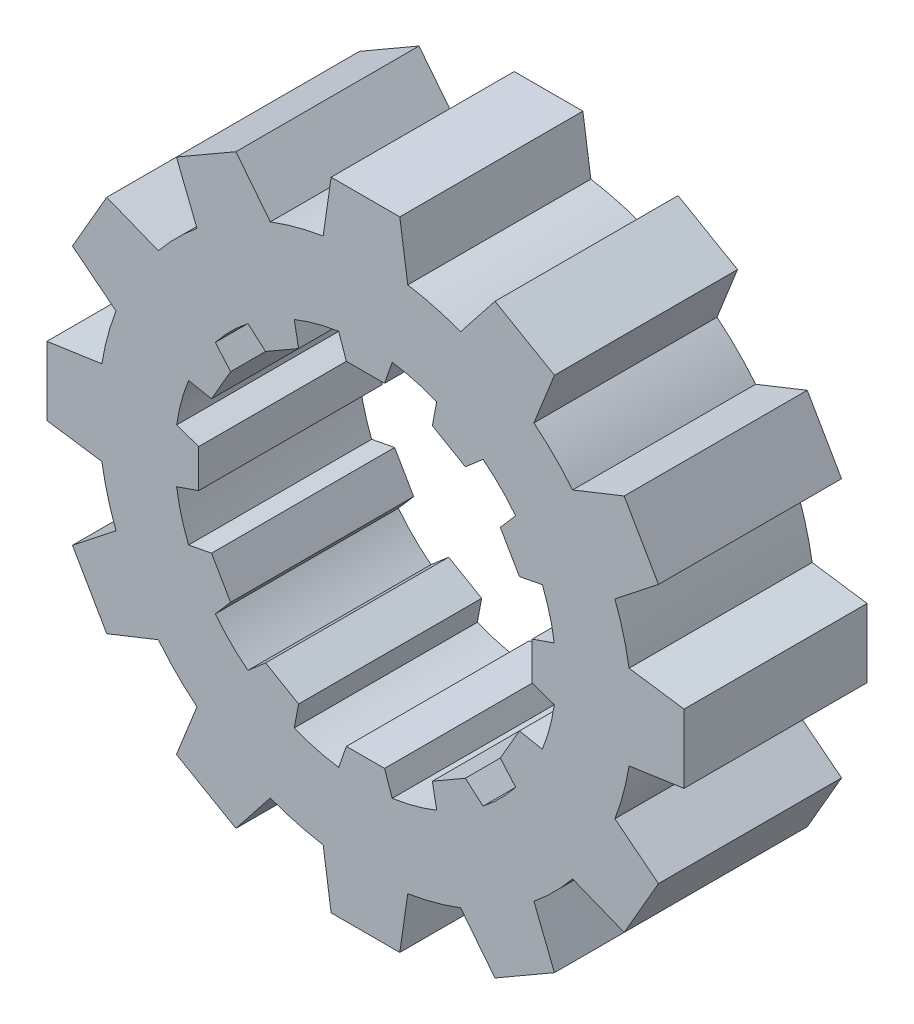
ISO-10303-21;
HEADER;
FILE_DESCRIPTION(('STEP AP214'),'2;1');
FILE_NAME('part.step','',(''),(''),'','','');
FILE_SCHEMA(('AUTOMOTIVE_DESIGN { 1 0 10303 214 1 1 1 1 }'));
ENDSEC;
DATA;
#1=APPLICATION_CONTEXT('core data for automotive mechanical design processes');
#2=APPLICATION_PROTOCOL_DEFINITION('international standard','automotive_design',2000,#1);
#3=PRODUCT_CONTEXT('',#1,'mechanical');
#4=PRODUCT('Part','Part','',(#3));
#5=PRODUCT_RELATED_PRODUCT_CATEGORY('part','',(#4));
#6=PRODUCT_DEFINITION_FORMATION('','',#4);
#7=PRODUCT_DEFINITION_CONTEXT('part definition',#1,'design');
#8=PRODUCT_DEFINITION('design','',#6,#7);
#9=PRODUCT_DEFINITION_SHAPE('','',#8);
#10=(LENGTH_UNIT() NAMED_UNIT(*) SI_UNIT(.MILLI.,.METRE.));
#11=(NAMED_UNIT(*) PLANE_ANGLE_UNIT() SI_UNIT($,.RADIAN.));
#12=(NAMED_UNIT(*) SI_UNIT($,.STERADIAN.) SOLID_ANGLE_UNIT());
#13=UNCERTAINTY_MEASURE_WITH_UNIT(LENGTH_MEASURE(1.E-05),#10,'distance_accuracy_value','');
#14=(GEOMETRIC_REPRESENTATION_CONTEXT(3) GLOBAL_UNCERTAINTY_ASSIGNED_CONTEXT((#13)) GLOBAL_UNIT_ASSIGNED_CONTEXT((#10,
#11,#12)) REPRESENTATION_CONTEXT('',''));
#15=CARTESIAN_POINT('',(0.,0.,0.));
#16=DIRECTION('',(0.,0.,1.));
#17=DIRECTION('',(1.,0.,0.));
#18=AXIS2_PLACEMENT_3D('',#15,#16,#17);
#19=CARTESIAN_POINT('',(0.,0.,-12.));
#20=DIRECTION('',(0.,0.,1.));
#21=DIRECTION('',(1.,0.,0.));
#22=AXIS2_PLACEMENT_3D('',#19,#20,#21);
#23=CYLINDRICAL_SURFACE('',#22,17.5);
#24=DIRECTION('',(0.,0.,1.));
#25=VECTOR('',#24,1.);
#26=CARTESIAN_POINT('',(-11.0409354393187,-13.5774719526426,-12.));
#27=LINE('',#26,#25);
#28=CARTESIAN_POINT('',(-11.0409354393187,-13.5774719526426,0.));
#29=VERTEX_POINT('',#28);
#30=CARTESIAN_POINT('',(-11.0409354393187,-13.5774719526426,-12.));
#31=VERTEX_POINT('',#30);
#32=EDGE_CURVE('E651',#29,#31,#27,.F.);
#33=ORIENTED_EDGE('',*,*,#32,.F.);
#34=CARTESIAN_POINT('',(0.,0.,0.));
#35=DIRECTION('',(0.,0.,1.));
#36=DIRECTION('',(1.,0.,0.));
#37=AXIS2_PLACEMENT_3D('',#34,#35,#36);
#38=CIRCLE('',#37,17.5);
#39=CARTESIAN_POINT('',(-13.5774719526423,-11.040935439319,0.));
#40=VERTEX_POINT('',#39);
#41=EDGE_CURVE('E1451',#40,#29,#38,.T.);
#42=ORIENTED_EDGE('',*,*,#41,.F.);
#43=DIRECTION('',(0.,0.,1.));
#44=VECTOR('',#43,1.);
#45=CARTESIAN_POINT('',(-13.5774719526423,-11.040935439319,-12.));
#46=LINE('',#45,#44);
#47=CARTESIAN_POINT('',(-13.5774719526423,-11.040935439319,-12.));
#48=VERTEX_POINT('',#47);
#49=EDGE_CURVE('E668',#48,#40,#46,.T.);
#50=ORIENTED_EDGE('',*,*,#49,.F.);
#51=CARTESIAN_POINT('',(0.,0.,-12.));
#52=DIRECTION('',(0.,0.,1.));
#53=DIRECTION('',(1.,0.,0.));
#54=AXIS2_PLACEMENT_3D('',#51,#52,#53);
#55=CIRCLE('',#54,17.5);
#56=EDGE_CURVE('E1460',#48,#31,#55,.T.);
#57=ORIENTED_EDGE('',*,*,#56,.T.);
#58=EDGE_LOOP('',(#33,#42,#50,#57));
#59=FACE_BOUND('',#58,.T.);
#60=ADVANCED_FACE('F24',(#59),#23,.T.);
#61=DIRECTION('',(0.,0.,1.));
#62=VECTOR('',#61,1.);
#63=CARTESIAN_POINT('',(-16.3504665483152,-6.23796791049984,-12.));
#64=LINE('',#63,#62);
#65=CARTESIAN_POINT('',(-16.3504665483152,-6.23796791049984,0.));
#66=VERTEX_POINT('',#65);
#67=CARTESIAN_POINT('',(-16.3504665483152,-6.23796791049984,-12.));
#68=VERTEX_POINT('',#67);
#69=EDGE_CURVE('E672',#66,#68,#64,.F.);
#70=ORIENTED_EDGE('',*,*,#69,.F.);
#71=CARTESIAN_POINT('',(-17.2789033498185,-2.77299459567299,0.));
#72=VERTEX_POINT('',#71);
#73=EDGE_CURVE('E1448',#72,#66,#38,.T.);
#74=ORIENTED_EDGE('',*,*,#73,.F.);
#75=DIRECTION('',(0.,0.,1.));
#76=VECTOR('',#75,1.);
#77=CARTESIAN_POINT('',(-17.2789033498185,-2.77299459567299,-12.));
#78=LINE('',#77,#76);
#79=CARTESIAN_POINT('',(-17.2789033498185,-2.77299459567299,-12.));
#80=VERTEX_POINT('',#79);
#81=EDGE_CURVE('E691',#80,#72,#78,.T.);
#82=ORIENTED_EDGE('',*,*,#81,.F.);
#83=EDGE_CURVE('E1462',#80,#68,#55,.T.);
#84=ORIENTED_EDGE('',*,*,#83,.T.);
#85=EDGE_LOOP('',(#70,#74,#82,#84));
#86=FACE_BOUND('',#85,.T.);
#87=ADVANCED_FACE('F1374',(#86),#23,.T.);
#88=DIRECTION('',(0.,0.,1.));
#89=VECTOR('',#88,1.);
#90=CARTESIAN_POINT('',(-17.2789033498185,2.77299459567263,-12.));
#91=LINE('',#90,#89);
#92=CARTESIAN_POINT('',(-17.2789033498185,2.77299459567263,0.));
#93=VERTEX_POINT('',#92);
#94=CARTESIAN_POINT('',(-17.2789033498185,2.77299459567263,-12.));
#95=VERTEX_POINT('',#94);
#96=EDGE_CURVE('E696',#93,#95,#91,.F.);
#97=ORIENTED_EDGE('',*,*,#96,.F.);
#98=CARTESIAN_POINT('',(-16.3504665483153,6.2379679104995,0.));
#99=VERTEX_POINT('',#98);
#100=EDGE_CURVE('E1445',#99,#93,#38,.T.);
#101=ORIENTED_EDGE('',*,*,#100,.F.);
#102=DIRECTION('',(0.,0.,1.));
#103=VECTOR('',#102,1.);
#104=CARTESIAN_POINT('',(-16.3504665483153,6.23796791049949,-12.));
#105=LINE('',#104,#103);
#106=CARTESIAN_POINT('',(-16.3504665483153,6.23796791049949,-12.));
#107=VERTEX_POINT('',#106);
#108=EDGE_CURVE('E713',#107,#99,#105,.T.);
#109=ORIENTED_EDGE('',*,*,#108,.F.);
#110=EDGE_CURVE('E1466',#107,#95,#55,.T.);
#111=ORIENTED_EDGE('',*,*,#110,.T.);
#112=EDGE_LOOP('',(#97,#101,#109,#111));
#113=FACE_BOUND('',#112,.T.);
#114=ADVANCED_FACE('F1379',(#113),#23,.T.);
#115=DIRECTION('',(0.,0.,1.));
#116=VECTOR('',#115,1.);
#117=CARTESIAN_POINT('',(-13.5774719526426,11.0409354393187,-12.));
#118=LINE('',#117,#116);
#119=CARTESIAN_POINT('',(-13.5774719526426,11.0409354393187,0.));
#120=VERTEX_POINT('',#119);
#121=CARTESIAN_POINT('',(-13.5774719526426,11.0409354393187,-12.));
#122=VERTEX_POINT('',#121);
#123=EDGE_CURVE('E720',#120,#122,#118,.F.);
#124=ORIENTED_EDGE('',*,*,#123,.F.);
#125=CARTESIAN_POINT('',(-11.040935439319,13.5774719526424,0.));
#126=VERTEX_POINT('',#125);
#127=EDGE_CURVE('E1442',#126,#120,#38,.T.);
#128=ORIENTED_EDGE('',*,*,#127,.F.);
#129=DIRECTION('',(0.,0.,1.));
#130=VECTOR('',#129,1.);
#131=CARTESIAN_POINT('',(-11.040935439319,13.5774719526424,-12.));
#132=LINE('',#131,#130);
#133=CARTESIAN_POINT('',(-11.040935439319,13.5774719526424,-12.));
#134=VERTEX_POINT('',#133);
#135=EDGE_CURVE('E739',#134,#126,#132,.T.);
#136=ORIENTED_EDGE('',*,*,#135,.F.);
#137=EDGE_CURVE('E1471',#134,#122,#55,.T.);
#138=ORIENTED_EDGE('',*,*,#137,.T.);
#139=EDGE_LOOP('',(#124,#128,#136,#138));
#140=FACE_BOUND('',#139,.T.);
#141=ADVANCED_FACE('F1587',(#140),#23,.T.);
#142=DIRECTION('',(0.,0.,1.));
#143=VECTOR('',#142,1.);
#144=CARTESIAN_POINT('',(-6.23796791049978,16.3504665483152,-12.));
#145=LINE('',#144,#143);
#146=CARTESIAN_POINT('',(-6.23796791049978,16.3504665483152,0.));
#147=VERTEX_POINT('',#146);
#148=CARTESIAN_POINT('',(-6.23796791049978,16.3504665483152,-12.));
#149=VERTEX_POINT('',#148);
#150=EDGE_CURVE('E744',#147,#149,#145,.F.);
#151=ORIENTED_EDGE('',*,*,#150,.F.);
#152=CARTESIAN_POINT('',(-2.77299459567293,17.2789033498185,0.));
#153=VERTEX_POINT('',#152);
#154=EDGE_CURVE('E1439',#153,#147,#38,.T.);
#155=ORIENTED_EDGE('',*,*,#154,.F.);
#156=DIRECTION('',(0.,0.,1.));
#157=VECTOR('',#156,1.);
#158=CARTESIAN_POINT('',(-2.77299459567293,17.2789033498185,-12.));
#159=LINE('',#158,#157);
#160=CARTESIAN_POINT('',(-2.77299459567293,17.2789033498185,-12.));
#161=VERTEX_POINT('',#160);
#162=EDGE_CURVE('E763',#161,#153,#159,.T.);
#163=ORIENTED_EDGE('',*,*,#162,.F.);
#164=EDGE_CURVE('E1477',#161,#149,#55,.T.);
#165=ORIENTED_EDGE('',*,*,#164,.T.);
#166=EDGE_LOOP('',(#151,#155,#163,#165));
#167=FACE_BOUND('',#166,.T.);
#168=ADVANCED_FACE('F1574',(#167),#23,.T.);
#169=DIRECTION('',(0.,0.,1.));
#170=VECTOR('',#169,1.);
#171=CARTESIAN_POINT('',(2.77299459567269,17.2789033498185,-12.));
#172=LINE('',#171,#170);
#173=CARTESIAN_POINT('',(2.77299459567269,17.2789033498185,0.));
#174=VERTEX_POINT('',#173);
#175=CARTESIAN_POINT('',(2.77299459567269,17.2789033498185,-12.));
#176=VERTEX_POINT('',#175);
#177=EDGE_CURVE('E768',#174,#176,#172,.F.);
#178=ORIENTED_EDGE('',*,*,#177,.F.);
#179=CARTESIAN_POINT('',(6.23796791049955,16.3504665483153,0.));
#180=VERTEX_POINT('',#179);
#181=EDGE_CURVE('E1436',#180,#174,#38,.T.);
#182=ORIENTED_EDGE('',*,*,#181,.F.);
#183=DIRECTION('',(0.,0.,1.));
#184=VECTOR('',#183,1.);
#185=CARTESIAN_POINT('',(6.23796791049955,16.3504665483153,-12.));
#186=LINE('',#185,#184);
#187=CARTESIAN_POINT('',(6.23796791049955,16.3504665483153,-12.));
#188=VERTEX_POINT('',#187);
#189=EDGE_CURVE('E785',#188,#180,#186,.T.);
#190=ORIENTED_EDGE('',*,*,#189,.F.);
#191=EDGE_CURVE('E1483',#188,#176,#55,.T.);
#192=ORIENTED_EDGE('',*,*,#191,.T.);
#193=EDGE_LOOP('',(#178,#182,#190,#192));
#194=FACE_BOUND('',#193,.T.);
#195=ADVANCED_FACE('F1561',(#194),#23,.T.);
#196=DIRECTION('',(0.,0.,1.));
#197=VECTOR('',#196,1.);
#198=CARTESIAN_POINT('',(11.0409354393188,13.5774719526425,-12.));
#199=LINE('',#198,#197);
#200=CARTESIAN_POINT('',(11.0409354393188,13.5774719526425,0.));
#201=VERTEX_POINT('',#200);
#202=CARTESIAN_POINT('',(11.0409354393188,13.5774719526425,-12.));
#203=VERTEX_POINT('',#202);
#204=EDGE_CURVE('E792',#201,#203,#199,.F.);
#205=ORIENTED_EDGE('',*,*,#204,.F.);
#206=CARTESIAN_POINT('',(13.5774719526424,11.0409354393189,0.));
#207=VERTEX_POINT('',#206);
#208=EDGE_CURVE('E1433',#207,#201,#38,.T.);
#209=ORIENTED_EDGE('',*,*,#208,.F.);
#210=DIRECTION('',(0.,0.,1.));
#211=VECTOR('',#210,1.);
#212=CARTESIAN_POINT('',(13.5774719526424,11.0409354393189,-12.));
#213=LINE('',#212,#211);
#214=CARTESIAN_POINT('',(13.5774719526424,11.0409354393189,-12.));
#215=VERTEX_POINT('',#214);
#216=EDGE_CURVE('E811',#215,#207,#213,.T.);
#217=ORIENTED_EDGE('',*,*,#216,.F.);
#218=EDGE_CURVE('E1489',#215,#203,#55,.T.);
#219=ORIENTED_EDGE('',*,*,#218,.T.);
#220=EDGE_LOOP('',(#205,#209,#217,#219));
#221=FACE_BOUND('',#220,.T.);
#222=ADVANCED_FACE('F1548',(#221),#23,.T.);
#223=DIRECTION('',(0.,0.,1.));
#224=VECTOR('',#223,1.);
#225=CARTESIAN_POINT('',(16.3504665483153,6.23796791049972,-12.));
#226=LINE('',#225,#224);
#227=CARTESIAN_POINT('',(16.3504665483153,6.23796791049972,0.));
#228=VERTEX_POINT('',#227);
#229=CARTESIAN_POINT('',(16.3504665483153,6.23796791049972,-12.));
#230=VERTEX_POINT('',#229);
#231=EDGE_CURVE('E816',#228,#230,#226,.F.);
#232=ORIENTED_EDGE('',*,*,#231,.F.);
#233=CARTESIAN_POINT('',(17.2789033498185,2.77299459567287,0.));
#234=VERTEX_POINT('',#233);
#235=EDGE_CURVE('E1430',#234,#228,#38,.T.);
#236=ORIENTED_EDGE('',*,*,#235,.F.);
#237=DIRECTION('',(0.,0.,1.));
#238=VECTOR('',#237,1.);
#239=CARTESIAN_POINT('',(17.2789033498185,2.77299459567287,-12.));
#240=LINE('',#239,#238);
#241=CARTESIAN_POINT('',(17.2789033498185,2.77299459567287,-12.));
#242=VERTEX_POINT('',#241);
#243=EDGE_CURVE('E835',#242,#234,#240,.T.);
#244=ORIENTED_EDGE('',*,*,#243,.F.);
#245=EDGE_CURVE('E1495',#242,#230,#55,.T.);
#246=ORIENTED_EDGE('',*,*,#245,.T.);
#247=EDGE_LOOP('',(#232,#236,#244,#246));
#248=FACE_BOUND('',#247,.T.);
#249=ADVANCED_FACE('F1535',(#248),#23,.T.);
#250=DIRECTION('',(0.,0.,1.));
#251=VECTOR('',#250,1.);
#252=CARTESIAN_POINT('',(17.2789033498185,-2.77299459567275,-12.));
#253=LINE('',#252,#251);
#254=CARTESIAN_POINT('',(17.2789033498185,-2.77299459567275,0.));
#255=VERTEX_POINT('',#254);
#256=CARTESIAN_POINT('',(17.2789033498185,-2.77299459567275,-12.));
#257=VERTEX_POINT('',#256);
#258=EDGE_CURVE('E840',#255,#257,#253,.F.);
#259=ORIENTED_EDGE('',*,*,#258,.F.);
#260=CARTESIAN_POINT('',(16.3504665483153,-6.23796791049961,0.));
#261=VERTEX_POINT('',#260);
#262=EDGE_CURVE('E1428',#261,#255,#38,.T.);
#263=ORIENTED_EDGE('',*,*,#262,.F.);
#264=DIRECTION('',(0.,0.,1.));
#265=VECTOR('',#264,1.);
#266=CARTESIAN_POINT('',(16.3504665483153,-6.23796791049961,-12.));
#267=LINE('',#266,#265);
#268=CARTESIAN_POINT('',(16.3504665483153,-6.23796791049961,-12.));
#269=VERTEX_POINT('',#268);
#270=EDGE_CURVE('E857',#269,#261,#267,.T.);
#271=ORIENTED_EDGE('',*,*,#270,.F.);
#272=EDGE_CURVE('E1501',#269,#257,#55,.T.);
#273=ORIENTED_EDGE('',*,*,#272,.T.);
#274=EDGE_LOOP('',(#259,#263,#271,#273));
#275=FACE_BOUND('',#274,.T.);
#276=ADVANCED_FACE('F1398',(#275),#23,.T.);
#277=DIRECTION('',(0.,0.,1.));
#278=VECTOR('',#277,1.);
#279=CARTESIAN_POINT('',(13.5774719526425,-11.0409354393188,-12.));
#280=LINE('',#279,#278);
#281=CARTESIAN_POINT('',(13.5774719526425,-11.0409354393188,0.));
#282=VERTEX_POINT('',#281);
#283=CARTESIAN_POINT('',(13.5774719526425,-11.0409354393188,-12.));
#284=VERTEX_POINT('',#283);
#285=EDGE_CURVE('E864',#282,#284,#280,.F.);
#286=ORIENTED_EDGE('',*,*,#285,.F.);
#287=CARTESIAN_POINT('',(11.0409354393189,-13.5774719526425,0.));
#288=VERTEX_POINT('',#287);
#289=EDGE_CURVE('E1230',#288,#282,#38,.T.);
#290=ORIENTED_EDGE('',*,*,#289,.F.);
#291=DIRECTION('',(0.,0.,1.));
#292=VECTOR('',#291,1.);
#293=CARTESIAN_POINT('',(11.0409354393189,-13.5774719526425,-12.));
#294=LINE('',#293,#292);
#295=CARTESIAN_POINT('',(11.0409354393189,-13.5774719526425,-12.));
#296=VERTEX_POINT('',#295);
#297=EDGE_CURVE('E883',#296,#288,#294,.T.);
#298=ORIENTED_EDGE('',*,*,#297,.F.);
#299=EDGE_CURVE('E1235',#296,#284,#55,.T.);
#300=ORIENTED_EDGE('',*,*,#299,.T.);
#301=EDGE_LOOP('',(#286,#290,#298,#300));
#302=FACE_BOUND('',#301,.T.);
#303=ADVANCED_FACE('F1392',(#302),#23,.T.);
#304=DIRECTION('',(0.,0.,1.));
#305=VECTOR('',#304,1.);
#306=CARTESIAN_POINT('',(6.23796791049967,-16.3504665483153,-12.));
#307=LINE('',#306,#305);
#308=CARTESIAN_POINT('',(6.23796791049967,-16.3504665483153,0.));
#309=VERTEX_POINT('',#308);
#310=CARTESIAN_POINT('',(6.23796791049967,-16.3504665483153,-12.));
#311=VERTEX_POINT('',#310);
#312=EDGE_CURVE('E888',#309,#311,#307,.F.);
#313=ORIENTED_EDGE('',*,*,#312,.F.);
#314=CARTESIAN_POINT('',(2.77299459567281,-17.2789033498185,0.));
#315=VERTEX_POINT('',#314);
#316=EDGE_CURVE('E1227',#315,#309,#38,.T.);
#317=ORIENTED_EDGE('',*,*,#316,.F.);
#318=DIRECTION('',(0.,0.,1.));
#319=VECTOR('',#318,1.);
#320=CARTESIAN_POINT('',(2.77299459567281,-17.2789033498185,-12.));
#321=LINE('',#320,#319);
#322=CARTESIAN_POINT('',(2.77299459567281,-17.2789033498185,-12.));
#323=VERTEX_POINT('',#322);
#324=EDGE_CURVE('E1188',#323,#315,#321,.T.);
#325=ORIENTED_EDGE('',*,*,#324,.F.);
#326=EDGE_CURVE('E1231',#323,#311,#55,.T.);
#327=ORIENTED_EDGE('',*,*,#326,.T.);
#328=EDGE_LOOP('',(#313,#317,#325,#327));
#329=FACE_BOUND('',#328,.T.);
#330=ADVANCED_FACE('F1384',(#329),#23,.T.);
#331=CARTESIAN_POINT('',(0.,0.,-12.));
#332=DIRECTION('',(0.,0.,1.));
#333=DIRECTION('',(1.,0.,0.));
#334=AXIS2_PLACEMENT_3D('',#331,#332,#333);
#335=CYLINDRICAL_SURFACE('',#334,12.5);
#336=CARTESIAN_POINT('',(0.,0.,-12.));
#337=DIRECTION('',(0.,0.,1.));
#338=DIRECTION('',(1.,0.,0.));
#339=AXIS2_PLACEMENT_3D('',#336,#337,#338);
#340=CIRCLE('',#339,12.5);
#341=CARTESIAN_POINT('',(-4.67019718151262,-11.5947944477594,-12.));
#342=VERTEX_POINT('',#341);
#343=CARTESIAN_POINT('',(-1.75288782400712,-12.3764851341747,-12.));
#344=VERTEX_POINT('',#343);
#345=EDGE_CURVE('E1220',#342,#344,#340,.T.);
#346=ORIENTED_EDGE('',*,*,#345,.F.);
#347=DIRECTION('',(0.,0.,1.));
#348=VECTOR('',#347,1.);
#349=CARTESIAN_POINT('',(-4.67019718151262,-11.5947944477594,-12.));
#350=LINE('',#349,#348);
#351=CARTESIAN_POINT('',(-4.67019718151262,-11.5947944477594,0.));
#352=VERTEX_POINT('',#351);
#353=EDGE_CURVE('E913',#342,#352,#350,.T.);
#354=ORIENTED_EDGE('',*,*,#353,.T.);
#355=CARTESIAN_POINT('',(0.,0.,0.));
#356=DIRECTION('',(0.,0.,1.));
#357=DIRECTION('',(1.,0.,0.));
#358=AXIS2_PLACEMENT_3D('',#355,#356,#357);
#359=CIRCLE('',#358,12.5);
#360=CARTESIAN_POINT('',(-1.75288782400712,-12.3764851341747,0.));
#361=VERTEX_POINT('',#360);
#362=EDGE_CURVE('E1216',#352,#361,#359,.T.);
#363=ORIENTED_EDGE('',*,*,#362,.T.);
#364=DIRECTION('',(0.,0.,1.));
#365=VECTOR('',#364,1.);
#366=CARTESIAN_POINT('',(-1.75288782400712,-12.3764851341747,-12.));
#367=LINE('',#366,#365);
#368=EDGE_CURVE('E1234',#361,#344,#367,.F.);
#369=ORIENTED_EDGE('',*,*,#368,.T.);
#370=EDGE_LOOP('',(#346,#354,#363,#369));
#371=FACE_BOUND('',#370,.T.);
#372=ADVANCED_FACE('F1307',(#371),#335,.F.);
#373=CARTESIAN_POINT('',(-9.84190662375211,-7.70628795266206,0.));
#374=VERTEX_POINT('',#373);
#375=CARTESIAN_POINT('',(-7.70628795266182,-9.8419066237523,0.));
#376=VERTEX_POINT('',#375);
#377=EDGE_CURVE('E1343',#374,#376,#359,.T.);
#378=ORIENTED_EDGE('',*,*,#377,.T.);
#379=DIRECTION('',(0.,0.,1.));
#380=VECTOR('',#379,1.);
#381=CARTESIAN_POINT('',(-7.70628795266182,-9.8419066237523,-12.));
#382=LINE('',#381,#380);
#383=CARTESIAN_POINT('',(-7.70628795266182,-9.8419066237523,-12.));
#384=VERTEX_POINT('',#383);
#385=EDGE_CURVE('E906',#376,#384,#382,.F.);
#386=ORIENTED_EDGE('',*,*,#385,.T.);
#387=CARTESIAN_POINT('',(-9.84190662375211,-7.70628795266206,-12.));
#388=VERTEX_POINT('',#387);
#389=EDGE_CURVE('E1296',#388,#384,#340,.T.);
#390=ORIENTED_EDGE('',*,*,#389,.F.);
#391=DIRECTION('',(0.,0.,1.));
#392=VECTOR('',#391,1.);
#393=CARTESIAN_POINT('',(-9.84190662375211,-7.70628795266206,-12.));
#394=LINE('',#393,#392);
#395=EDGE_CURVE('E939',#388,#374,#394,.T.);
#396=ORIENTED_EDGE('',*,*,#395,.T.);
#397=EDGE_LOOP('',(#378,#386,#390,#396));
#398=FACE_BOUND('',#397,.T.);
#399=ADVANCED_FACE('F1348',(#398),#335,.F.);
#400=CARTESIAN_POINT('',(-12.3764851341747,-1.75288782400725,0.));
#401=VERTEX_POINT('',#400);
#402=CARTESIAN_POINT('',(-11.5947944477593,-4.6701971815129,0.));
#403=VERTEX_POINT('',#402);
#404=EDGE_CURVE('E1340',#401,#403,#359,.T.);
#405=ORIENTED_EDGE('',*,*,#404,.T.);
#406=DIRECTION('',(0.,0.,1.));
#407=VECTOR('',#406,1.);
#408=CARTESIAN_POINT('',(-11.5947944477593,-4.6701971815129,-12.));
#409=LINE('',#408,#407);
#410=CARTESIAN_POINT('',(-11.5947944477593,-4.6701971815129,-12.));
#411=VERTEX_POINT('',#410);
#412=EDGE_CURVE('E936',#403,#411,#409,.F.);
#413=ORIENTED_EDGE('',*,*,#412,.T.);
#414=CARTESIAN_POINT('',(-12.3764851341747,-1.75288782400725,-12.));
#415=VERTEX_POINT('',#414);
#416=EDGE_CURVE('E1292',#415,#411,#340,.T.);
#417=ORIENTED_EDGE('',*,*,#416,.F.);
#418=DIRECTION('',(0.,0.,1.));
#419=VECTOR('',#418,1.);
#420=CARTESIAN_POINT('',(-12.3764851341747,-1.75288782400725,-12.));
#421=LINE('',#420,#419);
#422=EDGE_CURVE('E965',#415,#401,#421,.T.);
#423=ORIENTED_EDGE('',*,*,#422,.T.);
#424=EDGE_LOOP('',(#405,#413,#417,#423));
#425=FACE_BOUND('',#424,.T.);
#426=ADVANCED_FACE('F2132',(#425),#335,.F.);
#427=CARTESIAN_POINT('',(-11.5947944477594,4.67019718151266,0.));
#428=VERTEX_POINT('',#427);
#429=CARTESIAN_POINT('',(-12.3764851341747,1.75288782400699,0.));
#430=VERTEX_POINT('',#429);
#431=EDGE_CURVE('E1337',#428,#430,#359,.T.);
#432=ORIENTED_EDGE('',*,*,#431,.T.);
#433=DIRECTION('',(0.,0.,1.));
#434=VECTOR('',#433,1.);
#435=CARTESIAN_POINT('',(-12.3764851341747,1.75288782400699,-12.));
#436=LINE('',#435,#434);
#437=CARTESIAN_POINT('',(-12.3764851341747,1.75288782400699,-12.));
#438=VERTEX_POINT('',#437);
#439=EDGE_CURVE('E962',#430,#438,#436,.F.);
#440=ORIENTED_EDGE('',*,*,#439,.T.);
#441=CARTESIAN_POINT('',(-11.5947944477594,4.67019718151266,-12.));
#442=VERTEX_POINT('',#441);
#443=EDGE_CURVE('E1288',#442,#438,#340,.T.);
#444=ORIENTED_EDGE('',*,*,#443,.F.);
#445=DIRECTION('',(0.,0.,1.));
#446=VECTOR('',#445,1.);
#447=CARTESIAN_POINT('',(-11.5947944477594,4.67019718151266,-12.));
#448=LINE('',#447,#446);
#449=EDGE_CURVE('E991',#442,#428,#448,.T.);
#450=ORIENTED_EDGE('',*,*,#449,.T.);
#451=EDGE_LOOP('',(#432,#440,#444,#450));
#452=FACE_BOUND('',#451,.T.);
#453=ADVANCED_FACE('F2137',(#452),#335,.F.);
#454=CARTESIAN_POINT('',(-7.70628795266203,9.84190662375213,0.));
#455=VERTEX_POINT('',#454);
#456=CARTESIAN_POINT('',(-9.84190662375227,7.70628795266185,0.));
#457=VERTEX_POINT('',#456);
#458=EDGE_CURVE('E1334',#455,#457,#359,.T.);
#459=ORIENTED_EDGE('',*,*,#458,.T.);
#460=DIRECTION('',(0.,0.,1.));
#461=VECTOR('',#460,1.);
#462=CARTESIAN_POINT('',(-9.84190662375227,7.70628795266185,-12.));
#463=LINE('',#462,#461);
#464=CARTESIAN_POINT('',(-9.84190662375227,7.70628795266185,-12.));
#465=VERTEX_POINT('',#464);
#466=EDGE_CURVE('E984',#457,#465,#463,.F.);
#467=ORIENTED_EDGE('',*,*,#466,.T.);
#468=CARTESIAN_POINT('',(-7.70628795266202,9.84190662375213,-12.));
#469=VERTEX_POINT('',#468);
#470=EDGE_CURVE('E1284',#469,#465,#340,.T.);
#471=ORIENTED_EDGE('',*,*,#470,.F.);
#472=DIRECTION('',(0.,0.,1.));
#473=VECTOR('',#472,1.);
#474=CARTESIAN_POINT('',(-7.70628795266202,9.84190662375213,-12.));
#475=LINE('',#474,#473);
#476=EDGE_CURVE('E1017',#469,#455,#475,.T.);
#477=ORIENTED_EDGE('',*,*,#476,.T.);
#478=EDGE_LOOP('',(#459,#467,#471,#477));
#479=FACE_BOUND('',#478,.T.);
#480=ADVANCED_FACE('F2144',(#479),#335,.F.);
#481=CARTESIAN_POINT('',(-1.7528878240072,12.3764851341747,0.));
#482=VERTEX_POINT('',#481);
#483=CARTESIAN_POINT('',(-4.67019718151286,11.5947944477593,0.));
#484=VERTEX_POINT('',#483);
#485=EDGE_CURVE('E1331',#482,#484,#359,.T.);
#486=ORIENTED_EDGE('',*,*,#485,.T.);
#487=DIRECTION('',(0.,0.,1.));
#488=VECTOR('',#487,1.);
#489=CARTESIAN_POINT('',(-4.67019718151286,11.5947944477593,-12.));
#490=LINE('',#489,#488);
#491=CARTESIAN_POINT('',(-4.67019718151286,11.5947944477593,-12.));
#492=VERTEX_POINT('',#491);
#493=EDGE_CURVE('E1014',#484,#492,#490,.F.);
#494=ORIENTED_EDGE('',*,*,#493,.T.);
#495=CARTESIAN_POINT('',(-1.7528878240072,12.3764851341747,-12.));
#496=VERTEX_POINT('',#495);
#497=EDGE_CURVE('E1280',#496,#492,#340,.T.);
#498=ORIENTED_EDGE('',*,*,#497,.F.);
#499=DIRECTION('',(0.,0.,1.));
#500=VECTOR('',#499,1.);
#501=CARTESIAN_POINT('',(-1.7528878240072,12.3764851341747,-12.));
#502=LINE('',#501,#500);
#503=EDGE_CURVE('E1043',#496,#482,#502,.T.);
#504=ORIENTED_EDGE('',*,*,#503,.T.);
#505=EDGE_LOOP('',(#486,#494,#498,#504));
#506=FACE_BOUND('',#505,.T.);
#507=ADVANCED_FACE('F2151',(#506),#335,.F.);
#508=CARTESIAN_POINT('',(4.6701971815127,11.5947944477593,0.));
#509=VERTEX_POINT('',#508);
#510=CARTESIAN_POINT('',(1.75288782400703,12.3764851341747,0.));
#511=VERTEX_POINT('',#510);
#512=EDGE_CURVE('E1328',#509,#511,#359,.T.);
#513=ORIENTED_EDGE('',*,*,#512,.T.);
#514=DIRECTION('',(0.,0.,1.));
#515=VECTOR('',#514,1.);
#516=CARTESIAN_POINT('',(1.75288782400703,12.3764851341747,-12.));
#517=LINE('',#516,#515);
#518=CARTESIAN_POINT('',(1.75288782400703,12.3764851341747,-12.));
#519=VERTEX_POINT('',#518);
#520=EDGE_CURVE('E1040',#511,#519,#517,.F.);
#521=ORIENTED_EDGE('',*,*,#520,.T.);
#522=CARTESIAN_POINT('',(4.6701971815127,11.5947944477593,-12.));
#523=VERTEX_POINT('',#522);
#524=EDGE_CURVE('E1276',#523,#519,#340,.T.);
#525=ORIENTED_EDGE('',*,*,#524,.F.);
#526=DIRECTION('',(0.,0.,1.));
#527=VECTOR('',#526,1.);
#528=CARTESIAN_POINT('',(4.6701971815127,11.5947944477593,-12.));
#529=LINE('',#528,#527);
#530=EDGE_CURVE('E1069',#523,#509,#529,.T.);
#531=ORIENTED_EDGE('',*,*,#530,.T.);
#532=EDGE_LOOP('',(#513,#521,#525,#531));
#533=FACE_BOUND('',#532,.T.);
#534=ADVANCED_FACE('F2158',(#533),#335,.F.);
#535=CARTESIAN_POINT('',(9.84190662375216,7.70628795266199,0.));
#536=VERTEX_POINT('',#535);
#537=CARTESIAN_POINT('',(7.70628795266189,9.84190662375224,0.));
#538=VERTEX_POINT('',#537);
#539=EDGE_CURVE('E1325',#536,#538,#359,.T.);
#540=ORIENTED_EDGE('',*,*,#539,.T.);
#541=DIRECTION('',(0.,0.,1.));
#542=VECTOR('',#541,1.);
#543=CARTESIAN_POINT('',(7.70628795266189,9.84190662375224,-12.));
#544=LINE('',#543,#542);
#545=CARTESIAN_POINT('',(7.70628795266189,9.84190662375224,-12.));
#546=VERTEX_POINT('',#545);
#547=EDGE_CURVE('E1062',#538,#546,#544,.F.);
#548=ORIENTED_EDGE('',*,*,#547,.T.);
#549=CARTESIAN_POINT('',(9.84190662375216,7.70628795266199,-12.));
#550=VERTEX_POINT('',#549);
#551=EDGE_CURVE('E1272',#550,#546,#340,.T.);
#552=ORIENTED_EDGE('',*,*,#551,.F.);
#553=DIRECTION('',(0.,0.,1.));
#554=VECTOR('',#553,1.);
#555=CARTESIAN_POINT('',(9.84190662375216,7.70628795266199,-12.));
#556=LINE('',#555,#554);
#557=EDGE_CURVE('E1095',#550,#536,#556,.T.);
#558=ORIENTED_EDGE('',*,*,#557,.T.);
#559=EDGE_LOOP('',(#540,#548,#552,#558));
#560=FACE_BOUND('',#559,.T.);
#561=ADVANCED_FACE('F2165',(#560),#335,.F.);
#562=CARTESIAN_POINT('',(12.3764851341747,1.75288782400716,0.));
#563=VERTEX_POINT('',#562);
#564=CARTESIAN_POINT('',(11.5947944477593,4.67019718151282,0.));
#565=VERTEX_POINT('',#564);
#566=EDGE_CURVE('E1322',#563,#565,#359,.T.);
#567=ORIENTED_EDGE('',*,*,#566,.T.);
#568=DIRECTION('',(0.,0.,1.));
#569=VECTOR('',#568,1.);
#570=CARTESIAN_POINT('',(11.5947944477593,4.67019718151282,-12.));
#571=LINE('',#570,#569);
#572=CARTESIAN_POINT('',(11.5947944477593,4.67019718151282,-12.));
#573=VERTEX_POINT('',#572);
#574=EDGE_CURVE('E1092',#565,#573,#571,.F.);
#575=ORIENTED_EDGE('',*,*,#574,.T.);
#576=CARTESIAN_POINT('',(12.3764851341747,1.75288782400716,-12.));
#577=VERTEX_POINT('',#576);
#578=EDGE_CURVE('E1268',#577,#573,#340,.T.);
#579=ORIENTED_EDGE('',*,*,#578,.F.);
#580=DIRECTION('',(0.,0.,1.));
#581=VECTOR('',#580,1.);
#582=CARTESIAN_POINT('',(12.3764851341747,1.75288782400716,-12.));
#583=LINE('',#582,#581);
#584=EDGE_CURVE('E1121',#577,#563,#583,.T.);
#585=ORIENTED_EDGE('',*,*,#584,.T.);
#586=EDGE_LOOP('',(#567,#575,#579,#585));
#587=FACE_BOUND('',#586,.T.);
#588=ADVANCED_FACE('F2172',(#587),#335,.F.);
#589=CARTESIAN_POINT('',(11.5947944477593,-4.67019718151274,0.));
#590=VERTEX_POINT('',#589);
#591=CARTESIAN_POINT('',(12.3764851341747,-1.75288782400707,0.));
#592=VERTEX_POINT('',#591);
#593=EDGE_CURVE('E1321',#590,#592,#359,.T.);
#594=ORIENTED_EDGE('',*,*,#593,.T.);
#595=DIRECTION('',(0.,0.,1.));
#596=VECTOR('',#595,1.);
#597=CARTESIAN_POINT('',(12.3764851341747,-1.75288782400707,-12.));
#598=LINE('',#597,#596);
#599=CARTESIAN_POINT('',(12.3764851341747,-1.75288782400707,-12.));
#600=VERTEX_POINT('',#599);
#601=EDGE_CURVE('E1118',#592,#600,#598,.F.);
#602=ORIENTED_EDGE('',*,*,#601,.T.);
#603=CARTESIAN_POINT('',(11.5947944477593,-4.67019718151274,-12.));
#604=VERTEX_POINT('',#603);
#605=EDGE_CURVE('E1266',#604,#600,#340,.T.);
#606=ORIENTED_EDGE('',*,*,#605,.F.);
#607=DIRECTION('',(0.,0.,1.));
#608=VECTOR('',#607,1.);
#609=CARTESIAN_POINT('',(11.5947944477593,-4.67019718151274,-12.));
#610=LINE('',#609,#608);
#611=EDGE_CURVE('E1147',#604,#590,#610,.T.);
#612=ORIENTED_EDGE('',*,*,#611,.T.);
#613=EDGE_LOOP('',(#594,#602,#606,#612));
#614=FACE_BOUND('',#613,.T.);
#615=ADVANCED_FACE('F1389',(#614),#335,.F.);
#616=CARTESIAN_POINT('',(7.70628795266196,-9.84190662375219,0.));
#617=VERTEX_POINT('',#616);
#618=CARTESIAN_POINT('',(9.84190662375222,-7.70628795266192,0.));
#619=VERTEX_POINT('',#618);
#620=EDGE_CURVE('E1221',#617,#619,#359,.T.);
#621=ORIENTED_EDGE('',*,*,#620,.T.);
#622=DIRECTION('',(0.,0.,1.));
#623=VECTOR('',#622,1.);
#624=CARTESIAN_POINT('',(9.84190662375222,-7.70628795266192,-12.));
#625=LINE('',#624,#623);
#626=CARTESIAN_POINT('',(9.84190662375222,-7.70628795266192,-12.));
#627=VERTEX_POINT('',#626);
#628=EDGE_CURVE('E1140',#619,#627,#625,.F.);
#629=ORIENTED_EDGE('',*,*,#628,.T.);
#630=CARTESIAN_POINT('',(7.70628795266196,-9.84190662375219,-12.));
#631=VERTEX_POINT('',#630);
#632=EDGE_CURVE('E1226',#631,#627,#340,.T.);
#633=ORIENTED_EDGE('',*,*,#632,.F.);
#634=DIRECTION('',(0.,0.,1.));
#635=VECTOR('',#634,1.);
#636=CARTESIAN_POINT('',(7.70628795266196,-9.84190662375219,-12.));
#637=LINE('',#636,#635);
#638=EDGE_CURVE('E11',#631,#617,#637,.T.);
#639=ORIENTED_EDGE('',*,*,#638,.T.);
#640=EDGE_LOOP('',(#621,#629,#633,#639));
#641=FACE_BOUND('',#640,.T.);
#642=ADVANCED_FACE('F1264',(#641),#335,.F.);
#643=DIRECTION('',(0.,0.,1.));
#644=VECTOR('',#643,1.);
#645=CARTESIAN_POINT('',(-6.23796791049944,-16.3504665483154,-12.));
#646=LINE('',#645,#644);
#647=CARTESIAN_POINT('',(-6.23796791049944,-16.3504665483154,-12.));
#648=VERTEX_POINT('',#647);
#649=CARTESIAN_POINT('',(-6.23796791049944,-16.3504665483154,0.));
#650=VERTEX_POINT('',#649);
#651=EDGE_CURVE('E646',#648,#650,#646,.T.);
#652=ORIENTED_EDGE('',*,*,#651,.F.);
#653=CARTESIAN_POINT('',(-2.77299459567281,-17.2789033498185,-12.));
#654=VERTEX_POINT('',#653);
#655=EDGE_CURVE('E635',#648,#654,#55,.T.);
#656=ORIENTED_EDGE('',*,*,#655,.T.);
#657=DIRECTION('',(0.,0.,1.));
#658=VECTOR('',#657,1.);
#659=CARTESIAN_POINT('',(-2.77299459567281,-17.2789033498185,-12.));
#660=LINE('',#659,#658);
#661=CARTESIAN_POINT('',(-2.77299459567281,-17.2789033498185,0.));
#662=VERTEX_POINT('',#661);
#663=EDGE_CURVE('E1193',#662,#654,#660,.F.);
#664=ORIENTED_EDGE('',*,*,#663,.F.);
#665=EDGE_CURVE('E1225',#650,#662,#38,.T.);
#666=ORIENTED_EDGE('',*,*,#665,.F.);
#667=EDGE_LOOP('',(#652,#656,#664,#666));
#668=FACE_BOUND('',#667,.T.);
#669=ADVANCED_FACE('F26',(#668),#23,.T.);
#670=CARTESIAN_POINT('',(0.,0.,-12.));
#671=DIRECTION('',(0.,0.,1.));
#672=DIRECTION('',(1.,0.,0.));
#673=AXIS2_PLACEMENT_3D('',#670,#671,#672);
#674=PLANE('',#673);
#675=ORIENTED_EDGE('',*,*,#655,.F.);
#676=DIRECTION('',(0.619305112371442,0.785150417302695,0.));
#677=VECTOR('',#676,1.);
#678=CARTESIAN_POINT('',(-5.26004061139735,-15.1106575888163,-12.));
#679=LINE('',#678,#677);
#680=CARTESIAN_POINT('',(-8.49100102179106,-19.2068451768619,-12.));
#681=VERTEX_POINT('',#680);
#682=EDGE_CURVE('E620',#681,#648,#679,.T.);
#683=ORIENTED_EDGE('',*,*,#682,.F.);
#684=DIRECTION('',(0.866025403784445,-0.499999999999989,0.));
#685=VECTOR('',#684,1.);
#686=CARTESIAN_POINT('',(-8.49100102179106,-19.2068451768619,-12.));
#687=LINE('',#686,#685);
#688=CARTESIAN_POINT('',(-12.3881153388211,-16.956845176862,-12.));
#689=VERTEX_POINT('',#688);
#690=EDGE_CURVE('E626',#689,#681,#687,.T.);
#691=ORIENTED_EDGE('',*,*,#690,.F.);
#692=DIRECTION('',(-0.370307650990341,-0.928909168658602,0.));
#693=VECTOR('',#692,1.);
#694=CARTESIAN_POINT('',(-12.3881153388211,-16.956845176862,-12.));
#695=LINE('',#694,#693);
#696=EDGE_CURVE('E643',#31,#689,#695,.T.);
#697=ORIENTED_EDGE('',*,*,#696,.F.);
#698=ORIENTED_EDGE('',*,*,#56,.F.);
#699=DIRECTION('',(0.928909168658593,0.370307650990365,0.));
#700=VECTOR('',#699,1.);
#701=CARTESIAN_POINT('',(-12.1106575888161,-10.4561930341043,-12.));
#702=LINE('',#701,#700);
#703=CARTESIAN_POINT('',(-16.9568451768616,-12.3881153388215,-12.));
#704=VERTEX_POINT('',#703);
#705=EDGE_CURVE('E663',#704,#48,#702,.T.);
#706=ORIENTED_EDGE('',*,*,#705,.F.);
#707=DIRECTION('',(0.50000000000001,-0.866025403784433,0.));
#708=VECTOR('',#707,1.);
#709=CARTESIAN_POINT('',(-16.9568451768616,-12.3881153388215,-12.));
#710=LINE('',#709,#708);
#711=CARTESIAN_POINT('',(-19.2068451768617,-8.49100102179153,-12.));
#712=VERTEX_POINT('',#711);
#713=EDGE_CURVE('E660',#712,#704,#710,.T.);
#714=ORIENTED_EDGE('',*,*,#713,.F.);
#715=DIRECTION('',(-0.785150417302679,-0.619305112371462,0.));
#716=VECTOR('',#715,1.);
#717=CARTESIAN_POINT('',(-19.2068451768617,-8.49100102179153,-12.));
#718=LINE('',#717,#716);
#719=EDGE_CURVE('E658',#68,#712,#718,.T.);
#720=ORIENTED_EDGE('',*,*,#719,.F.);
#721=ORIENTED_EDGE('',*,*,#83,.F.);
#722=DIRECTION('',(0.989612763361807,-0.1437587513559,0.));
#723=VECTOR('',#722,1.);
#724=CARTESIAN_POINT('',(-15.7162336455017,-3.00000000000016,-12.));
#725=LINE('',#724,#723);
#726=CARTESIAN_POINT('',(-20.8791163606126,-2.25000000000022,-12.));
#727=VERTEX_POINT('',#726);
#728=EDGE_CURVE('E686',#727,#80,#725,.T.);
#729=ORIENTED_EDGE('',*,*,#728,.F.);
#730=DIRECTION('',(0.,-1.,0.));
#731=VECTOR('',#730,1.);
#732=CARTESIAN_POINT('',(-20.8791163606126,-2.25000000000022,-12.));
#733=LINE('',#732,#731);
#734=CARTESIAN_POINT('',(-20.8791163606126,2.24999999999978,-12.));
#735=VERTEX_POINT('',#734);
#736=EDGE_CURVE('E683',#735,#727,#733,.T.);
#737=ORIENTED_EDGE('',*,*,#736,.F.);
#738=DIRECTION('',(-0.989612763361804,-0.143758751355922,0.));
#739=VECTOR('',#738,1.);
#740=CARTESIAN_POINT('',(-20.8791163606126,2.24999999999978,-12.));
#741=LINE('',#740,#739);
#742=EDGE_CURVE('E681',#95,#735,#741,.T.);
#743=ORIENTED_EDGE('',*,*,#742,.F.);
#744=ORIENTED_EDGE('',*,*,#110,.F.);
#745=DIRECTION('',(0.785150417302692,-0.619305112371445,0.));
#746=VECTOR('',#745,1.);
#747=CARTESIAN_POINT('',(-15.1106575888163,5.2600406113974,-12.));
#748=LINE('',#747,#746);
#749=CARTESIAN_POINT('',(-19.2068451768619,8.49100102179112,-12.));
#750=VERTEX_POINT('',#749);
#751=EDGE_CURVE('E702',#750,#107,#748,.T.);
#752=ORIENTED_EDGE('',*,*,#751,.F.);
#753=DIRECTION('',(-0.499999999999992,-0.866025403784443,0.));
#754=VECTOR('',#753,1.);
#755=CARTESIAN_POINT('',(-19.2068451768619,8.49100102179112,-12.));
#756=LINE('',#755,#754);
#757=CARTESIAN_POINT('',(-16.9568451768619,12.3881153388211,-12.));
#758=VERTEX_POINT('',#757);
#759=EDGE_CURVE('E706',#758,#750,#756,.T.);
#760=ORIENTED_EDGE('',*,*,#759,.F.);
#761=DIRECTION('',(-0.928909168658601,0.370307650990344,0.));
#762=VECTOR('',#761,1.);
#763=CARTESIAN_POINT('',(-16.9568451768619,12.3881153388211,-12.));
#764=LINE('',#763,#762);
#765=EDGE_CURVE('E698',#122,#758,#764,.T.);
#766=ORIENTED_EDGE('',*,*,#765,.F.);
#767=ORIENTED_EDGE('',*,*,#137,.F.);
#768=DIRECTION('',(0.370307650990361,-0.928909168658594,0.));
#769=VECTOR('',#768,1.);
#770=CARTESIAN_POINT('',(-10.4561930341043,12.1106575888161,-12.));
#771=LINE('',#770,#769);
#772=CARTESIAN_POINT('',(-12.3881153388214,16.9568451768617,-12.));
#773=VERTEX_POINT('',#772);
#774=EDGE_CURVE('E734',#773,#134,#771,.T.);
#775=ORIENTED_EDGE('',*,*,#774,.F.);
#776=DIRECTION('',(-0.866025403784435,-0.500000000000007,0.));
#777=VECTOR('',#776,1.);
#778=CARTESIAN_POINT('',(-12.3881153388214,16.9568451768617,-12.));
#779=LINE('',#778,#777);
#780=CARTESIAN_POINT('',(-8.49100102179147,19.2068451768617,-12.));
#781=VERTEX_POINT('',#780);
#782=EDGE_CURVE('E731',#781,#773,#779,.T.);
#783=ORIENTED_EDGE('',*,*,#782,.F.);
#784=DIRECTION('',(-0.619305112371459,0.785150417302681,0.));
#785=VECTOR('',#784,1.);
#786=CARTESIAN_POINT('',(-8.49100102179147,19.2068451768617,-12.));
#787=LINE('',#786,#785);
#788=EDGE_CURVE('E729',#149,#781,#787,.T.);
#789=ORIENTED_EDGE('',*,*,#788,.F.);
#790=ORIENTED_EDGE('',*,*,#164,.F.);
#791=DIRECTION('',(-0.143758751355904,-0.989612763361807,0.));
#792=VECTOR('',#791,1.);
#793=CARTESIAN_POINT('',(-3.00000000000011,15.7162336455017,-12.));
#794=LINE('',#793,#792);
#795=CARTESIAN_POINT('',(-2.25000000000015,20.8791163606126,-12.));
#796=VERTEX_POINT('',#795);
#797=EDGE_CURVE('E758',#796,#161,#794,.T.);
#798=ORIENTED_EDGE('',*,*,#797,.F.);
#799=DIRECTION('',(-1.,0.,0.));
#800=VECTOR('',#799,1.);
#801=CARTESIAN_POINT('',(-2.25000000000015,20.8791163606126,-12.));
#802=LINE('',#801,#800);
#803=CARTESIAN_POINT('',(2.24999999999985,20.8791163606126,-12.));
#804=VERTEX_POINT('',#803);
#805=EDGE_CURVE('E755',#804,#796,#802,.T.);
#806=ORIENTED_EDGE('',*,*,#805,.F.);
#807=DIRECTION('',(-0.143758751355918,0.989612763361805,0.));
#808=VECTOR('',#807,1.);
#809=CARTESIAN_POINT('',(2.24999999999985,20.8791163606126,-12.));
#810=LINE('',#809,#808);
#811=EDGE_CURVE('E753',#176,#804,#810,.T.);
#812=ORIENTED_EDGE('',*,*,#811,.F.);
#813=ORIENTED_EDGE('',*,*,#191,.F.);
#814=DIRECTION('',(-0.619305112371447,-0.78515041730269,0.));
#815=VECTOR('',#814,1.);
#816=CARTESIAN_POINT('',(5.26004061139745,15.1106575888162,-12.));
#817=LINE('',#816,#815);
#818=CARTESIAN_POINT('',(8.49100102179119,19.2068451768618,-12.));
#819=VERTEX_POINT('',#818);
#820=EDGE_CURVE('E774',#819,#188,#817,.T.);
#821=ORIENTED_EDGE('',*,*,#820,.F.);
#822=DIRECTION('',(-0.866025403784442,0.499999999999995,0.));
#823=VECTOR('',#822,1.);
#824=CARTESIAN_POINT('',(8.49100102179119,19.2068451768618,-12.));
#825=LINE('',#824,#823);
#826=CARTESIAN_POINT('',(12.3881153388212,16.9568451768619,-12.));
#827=VERTEX_POINT('',#826);
#828=EDGE_CURVE('E778',#827,#819,#825,.T.);
#829=ORIENTED_EDGE('',*,*,#828,.F.);
#830=DIRECTION('',(0.370307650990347,0.9289091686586,0.));
#831=VECTOR('',#830,1.);
#832=CARTESIAN_POINT('',(12.3881153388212,16.9568451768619,-12.));
#833=LINE('',#832,#831);
#834=EDGE_CURVE('E770',#203,#827,#833,.T.);
#835=ORIENTED_EDGE('',*,*,#834,.F.);
#836=ORIENTED_EDGE('',*,*,#218,.F.);
#837=DIRECTION('',(-0.928909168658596,-0.370307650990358,0.));
#838=VECTOR('',#837,1.);
#839=CARTESIAN_POINT('',(12.1106575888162,10.4561930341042,-12.));
#840=LINE('',#839,#838);
#841=CARTESIAN_POINT('',(16.9568451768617,12.3881153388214,-12.));
#842=VERTEX_POINT('',#841);
#843=EDGE_CURVE('E806',#842,#215,#840,.T.);
#844=ORIENTED_EDGE('',*,*,#843,.F.);
#845=DIRECTION('',(-0.500000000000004,0.866025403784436,0.));
#846=VECTOR('',#845,1.);
#847=CARTESIAN_POINT('',(16.9568451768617,12.3881153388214,-12.));
#848=LINE('',#847,#846);
#849=CARTESIAN_POINT('',(19.2068451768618,8.4910010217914,-12.));
#850=VERTEX_POINT('',#849);
#851=EDGE_CURVE('E803',#850,#842,#848,.T.);
#852=ORIENTED_EDGE('',*,*,#851,.F.);
#853=DIRECTION('',(0.785150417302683,0.619305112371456,0.));
#854=VECTOR('',#853,1.);
#855=CARTESIAN_POINT('',(19.2068451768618,8.4910010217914,-12.));
#856=LINE('',#855,#854);
#857=EDGE_CURVE('E801',#230,#850,#856,.T.);
#858=ORIENTED_EDGE('',*,*,#857,.F.);
#859=ORIENTED_EDGE('',*,*,#245,.F.);
#860=DIRECTION('',(-0.989612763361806,0.143758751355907,0.));
#861=VECTOR('',#860,1.);
#862=CARTESIAN_POINT('',(15.7162336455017,3.00000000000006,-12.));
#863=LINE('',#862,#861);
#864=CARTESIAN_POINT('',(20.8791163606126,2.25000000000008,-12.));
#865=VERTEX_POINT('',#864);
#866=EDGE_CURVE('E830',#865,#242,#863,.T.);
#867=ORIENTED_EDGE('',*,*,#866,.F.);
#868=DIRECTION('',(0.,1.,0.));
#869=VECTOR('',#868,1.);
#870=CARTESIAN_POINT('',(20.8791163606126,2.25000000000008,-12.));
#871=LINE('',#870,#869);
#872=CARTESIAN_POINT('',(20.8791163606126,-2.24999999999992,-12.));
#873=VERTEX_POINT('',#872);
#874=EDGE_CURVE('E827',#873,#865,#871,.T.);
#875=ORIENTED_EDGE('',*,*,#874,.F.);
#876=DIRECTION('',(0.989612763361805,0.143758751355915,0.));
#877=VECTOR('',#876,1.);
#878=CARTESIAN_POINT('',(20.8791163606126,-2.24999999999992,-12.));
#879=LINE('',#878,#877);
#880=EDGE_CURVE('E825',#257,#873,#879,.T.);
#881=ORIENTED_EDGE('',*,*,#880,.F.);
#882=ORIENTED_EDGE('',*,*,#272,.F.);
#883=DIRECTION('',(-0.785150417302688,0.61930511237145,0.));
#884=VECTOR('',#883,1.);
#885=CARTESIAN_POINT('',(15.1106575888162,-5.26004061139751,-12.));
#886=LINE('',#885,#884);
#887=CARTESIAN_POINT('',(19.2068451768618,-8.49100102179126,-12.));
#888=VERTEX_POINT('',#887);
#889=EDGE_CURVE('E846',#888,#269,#886,.T.);
#890=ORIENTED_EDGE('',*,*,#889,.F.);
#891=DIRECTION('',(0.499999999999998,0.86602540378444,0.));
#892=VECTOR('',#891,1.);
#893=CARTESIAN_POINT('',(19.2068451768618,-8.49100102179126,-12.));
#894=LINE('',#893,#892);
#895=CARTESIAN_POINT('',(16.9568451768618,-12.3881153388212,-12.));
#896=VERTEX_POINT('',#895);
#897=EDGE_CURVE('E850',#896,#888,#894,.T.);
#898=ORIENTED_EDGE('',*,*,#897,.F.);
#899=DIRECTION('',(0.928909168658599,-0.370307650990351,0.));
#900=VECTOR('',#899,1.);
#901=CARTESIAN_POINT('',(16.9568451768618,-12.3881153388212,-12.));
#902=LINE('',#901,#900);
#903=EDGE_CURVE('E842',#284,#896,#902,.T.);
#904=ORIENTED_EDGE('',*,*,#903,.F.);
#905=ORIENTED_EDGE('',*,*,#299,.F.);
#906=DIRECTION('',(-0.370307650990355,0.928909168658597,0.));
#907=VECTOR('',#906,1.);
#908=CARTESIAN_POINT('',(10.4561930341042,-12.1106575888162,-12.));
#909=LINE('',#908,#907);
#910=CARTESIAN_POINT('',(12.3881153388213,-16.9568451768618,-12.));
#911=VERTEX_POINT('',#910);
#912=EDGE_CURVE('E878',#911,#296,#909,.T.);
#913=ORIENTED_EDGE('',*,*,#912,.F.);
#914=DIRECTION('',(0.866025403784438,0.500000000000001,0.));
#915=VECTOR('',#914,1.);
#916=CARTESIAN_POINT('',(12.3881153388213,-16.9568451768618,-12.));
#917=LINE('',#916,#915);
#918=CARTESIAN_POINT('',(8.49100102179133,-19.2068451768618,-12.));
#919=VERTEX_POINT('',#918);
#920=EDGE_CURVE('E875',#919,#911,#917,.T.);
#921=ORIENTED_EDGE('',*,*,#920,.F.);
#922=DIRECTION('',(0.619305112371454,-0.785150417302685,0.));
#923=VECTOR('',#922,1.);
#924=CARTESIAN_POINT('',(8.49100102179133,-19.2068451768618,-12.));
#925=LINE('',#924,#923);
#926=EDGE_CURVE('E873',#311,#919,#925,.T.);
#927=ORIENTED_EDGE('',*,*,#926,.F.);
#928=ORIENTED_EDGE('',*,*,#326,.F.);
#929=DIRECTION('',(0.143758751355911,0.989612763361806,0.));
#930=VECTOR('',#929,1.);
#931=CARTESIAN_POINT('',(3.,-15.7162336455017,-12.));
#932=LINE('',#931,#930);
#933=CARTESIAN_POINT('',(2.25,-20.8791163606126,-12.));
#934=VERTEX_POINT('',#933);
#935=EDGE_CURVE('E1183',#934,#323,#932,.T.);
#936=ORIENTED_EDGE('',*,*,#935,.F.);
#937=DIRECTION('',(1.,0.,0.));
#938=VECTOR('',#937,1.);
#939=CARTESIAN_POINT('',(2.25,-20.8791163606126,-12.));
#940=LINE('',#939,#938);
#941=CARTESIAN_POINT('',(-2.25,-20.8791163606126,-12.));
#942=VERTEX_POINT('',#941);
#943=EDGE_CURVE('E1180',#942,#934,#940,.T.);
#944=ORIENTED_EDGE('',*,*,#943,.F.);
#945=DIRECTION('',(0.143758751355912,-0.989612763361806,0.));
#946=VECTOR('',#945,1.);
#947=CARTESIAN_POINT('',(-2.25,-20.8791163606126,-12.));
#948=LINE('',#947,#946);
#949=EDGE_CURVE('E1178',#654,#942,#948,.T.);
#950=ORIENTED_EDGE('',*,*,#949,.F.);
#951=EDGE_LOOP('',(#675,#683,#691,#697,#698,#706,#714,#720,#721,#729,#737,#743,#744,#752,#760,
#766,#767,#775,#783,#789,#790,#798,#806,#812,#813,#821,#829,#835,#836,#844,#852,#858,#859,#867,
#875,#881,#882,#890,#898,#904,#905,#913,#921,#927,#928,#936,#944,#950));
#952=FACE_BOUND('',#951,.T.);
#953=ORIENTED_EDGE('',*,*,#389,.T.);
#954=DIRECTION('',(-0.756484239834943,-0.654011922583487,0.));
#955=VECTOR('',#954,1.);
#956=CARTESIAN_POINT('',(-11.1578058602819,-12.8258866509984,-12.));
#957=LINE('',#956,#955);
#958=CARTESIAN_POINT('',(-6.54690500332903,-8.83957209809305,-12.));
#959=VERTEX_POINT('',#958);
#960=EDGE_CURVE('E897',#959,#384,#957,.T.);
#961=ORIENTED_EDGE('',*,*,#960,.F.);
#962=DIRECTION('',(-0.866025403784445,0.499999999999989,0.));
#963=VECTOR('',#962,1.);
#964=CARTESIAN_POINT('',(-6.54690500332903,-8.83957209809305,-12.));
#965=LINE('',#964,#963);
#966=CARTESIAN_POINT('',(-4.38184149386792,-10.089572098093,-12.));
#967=VERTEX_POINT('',#966);
#968=EDGE_CURVE('E890',#967,#959,#965,.T.);
#969=ORIENTED_EDGE('',*,*,#968,.F.);
#970=DIRECTION('',(0.188148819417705,0.982140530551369,0.));
#971=VECTOR('',#970,1.);
#972=CARTESIAN_POINT('',(-4.38184149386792,-10.089572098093,-12.));
#973=LINE('',#972,#971);
#974=EDGE_CURVE('E893',#342,#967,#973,.T.);
#975=ORIENTED_EDGE('',*,*,#974,.F.);
#976=ORIENTED_EDGE('',*,*,#345,.T.);
#977=DIRECTION('',(-0.32812860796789,-0.944633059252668,0.));
#978=VECTOR('',#977,1.);
#979=CARTESIAN_POINT('',(-3.25,-16.6864465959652,-12.));
#980=LINE('',#979,#978);
#981=CARTESIAN_POINT('',(-1.25,-10.9287464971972,-12.));
#982=VERTEX_POINT('',#981);
#983=EDGE_CURVE('E1207',#982,#344,#980,.T.);
#984=ORIENTED_EDGE('',*,*,#983,.F.);
#985=DIRECTION('',(-1.,0.,0.));
#986=VECTOR('',#985,1.);
#987=CARTESIAN_POINT('',(-1.25,-10.9287464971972,-12.));
#988=LINE('',#987,#986);
#989=CARTESIAN_POINT('',(1.25,-10.9287464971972,-12.));
#990=VERTEX_POINT('',#989);
#991=EDGE_CURVE('E1204',#990,#982,#988,.T.);
#992=ORIENTED_EDGE('',*,*,#991,.F.);
#993=DIRECTION('',(-0.328128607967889,0.944633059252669,0.));
#994=VECTOR('',#993,1.);
#995=CARTESIAN_POINT('',(1.25,-10.9287464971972,-12.));
#996=LINE('',#995,#994);
#997=CARTESIAN_POINT('',(1.75288782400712,-12.3764851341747,-12.));
#998=VERTEX_POINT('',#997);
#999=EDGE_CURVE('E1210',#998,#990,#996,.T.);
#1000=ORIENTED_EDGE('',*,*,#999,.F.);
#1001=CARTESIAN_POINT('',(4.67019718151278,-11.5947944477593,-12.));
#1002=VERTEX_POINT('',#1001);
#1003=EDGE_CURVE('E1222',#998,#1002,#340,.T.);
#1004=ORIENTED_EDGE('',*,*,#1003,.T.);
#1005=DIRECTION('',(0.188148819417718,-0.982140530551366,0.));
#1006=VECTOR('',#1005,1.);
#1007=CARTESIAN_POINT('',(5.52864073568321,-16.0758866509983,-12.));
#1008=LINE('',#1007,#1006);
#1009=CARTESIAN_POINT('',(4.38184149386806,-10.089572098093,-12.));
#1010=VERTEX_POINT('',#1009);
#1011=EDGE_CURVE('E1161',#1010,#1002,#1008,.T.);
#1012=ORIENTED_EDGE('',*,*,#1011,.F.);
#1013=DIRECTION('',(-0.866025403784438,-0.500000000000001,0.));
#1014=VECTOR('',#1013,1.);
#1015=CARTESIAN_POINT('',(4.38184149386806,-10.089572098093,-12.));
#1016=LINE('',#1015,#1014);
#1017=CARTESIAN_POINT('',(6.54690500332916,-8.83957209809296,-12.));
#1018=VERTEX_POINT('',#1017);
#1019=EDGE_CURVE('E1158',#1018,#1010,#1016,.T.);
#1020=ORIENTED_EDGE('',*,*,#1019,.F.);
#1021=DIRECTION('',(-0.756484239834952,0.654011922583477,0.));
#1022=VECTOR('',#1021,1.);
#1023=CARTESIAN_POINT('',(6.54690500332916,-8.83957209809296,-12.));
#1024=LINE('',#1023,#1022);
#1025=EDGE_CURVE('E1164',#631,#1018,#1024,.T.);
#1026=ORIENTED_EDGE('',*,*,#1025,.F.);
#1027=ORIENTED_EDGE('',*,*,#632,.T.);
#1028=DIRECTION('',(0.654011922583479,-0.75648423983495,0.));
#1029=VECTOR('',#1028,1.);
#1030=CARTESIAN_POINT('',(12.8258866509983,-11.157805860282,-12.));
#1031=LINE('',#1030,#1029);
#1032=CARTESIAN_POINT('',(8.83957209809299,-6.54690500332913,-12.));
#1033=VERTEX_POINT('',#1032);
#1034=EDGE_CURVE('E1131',#1033,#627,#1031,.T.);
#1035=ORIENTED_EDGE('',*,*,#1034,.F.);
#1036=DIRECTION('',(-0.499999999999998,-0.86602540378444,0.));
#1037=VECTOR('',#1036,1.);
#1038=CARTESIAN_POINT('',(8.83957209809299,-6.54690500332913,-12.));
#1039=LINE('',#1038,#1037);
#1040=CARTESIAN_POINT('',(10.089572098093,-4.38184149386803,-12.));
#1041=VERTEX_POINT('',#1040);
#1042=EDGE_CURVE('E1124',#1041,#1033,#1039,.T.);
#1043=ORIENTED_EDGE('',*,*,#1042,.F.);
#1044=DIRECTION('',(-0.982140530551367,0.188148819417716,0.));
#1045=VECTOR('',#1044,1.);
#1046=CARTESIAN_POINT('',(10.089572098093,-4.38184149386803,-12.));
#1047=LINE('',#1046,#1045);
#1048=EDGE_CURVE('E1127',#604,#1041,#1047,.T.);
#1049=ORIENTED_EDGE('',*,*,#1048,.F.);
#1050=ORIENTED_EDGE('',*,*,#605,.T.);
#1051=DIRECTION('',(0.944633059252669,-0.328128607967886,0.));
#1052=VECTOR('',#1051,1.);
#1053=CARTESIAN_POINT('',(16.6864465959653,-3.24999999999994,-12.));
#1054=LINE('',#1053,#1052);
#1055=CARTESIAN_POINT('',(10.9287464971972,-1.24999999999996,-12.));
#1056=VERTEX_POINT('',#1055);
#1057=EDGE_CURVE('E1109',#1056,#600,#1054,.T.);
#1058=ORIENTED_EDGE('',*,*,#1057,.F.);
#1059=DIRECTION('',(0.,-1.,0.));
#1060=VECTOR('',#1059,1.);
#1061=CARTESIAN_POINT('',(10.9287464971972,-1.24999999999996,-12.));
#1062=LINE('',#1061,#1060);
#1063=CARTESIAN_POINT('',(10.9287464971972,1.25000000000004,-12.));
#1064=VERTEX_POINT('',#1063);
#1065=EDGE_CURVE('E1106',#1064,#1056,#1062,.T.);
#1066=ORIENTED_EDGE('',*,*,#1065,.F.);
#1067=DIRECTION('',(-0.944633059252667,-0.328128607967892,0.));
#1068=VECTOR('',#1067,1.);
#1069=CARTESIAN_POINT('',(10.9287464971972,1.25000000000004,-12.));
#1070=LINE('',#1069,#1068);
#1071=EDGE_CURVE('E1112',#577,#1064,#1070,.T.);
#1072=ORIENTED_EDGE('',*,*,#1071,.F.);
#1073=ORIENTED_EDGE('',*,*,#578,.T.);
#1074=DIRECTION('',(0.982140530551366,0.188148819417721,0.));
#1075=VECTOR('',#1074,1.);
#1076=CARTESIAN_POINT('',(16.0758866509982,5.52864073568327,-12.));
#1077=LINE('',#1076,#1075);
#1078=CARTESIAN_POINT('',(10.089572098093,4.3818414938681,-12.));
#1079=VERTEX_POINT('',#1078);
#1080=EDGE_CURVE('E1083',#1079,#573,#1077,.T.);
#1081=ORIENTED_EDGE('',*,*,#1080,.F.);
#1082=DIRECTION('',(0.500000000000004,-0.866025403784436,0.));
#1083=VECTOR('',#1082,1.);
#1084=CARTESIAN_POINT('',(10.089572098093,4.3818414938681,-12.));
#1085=LINE('',#1084,#1083);
#1086=CARTESIAN_POINT('',(8.83957209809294,6.54690500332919,-12.));
#1087=VERTEX_POINT('',#1086);
#1088=EDGE_CURVE('E1080',#1087,#1079,#1085,.T.);
#1089=ORIENTED_EDGE('',*,*,#1088,.F.);
#1090=DIRECTION('',(-0.654011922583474,-0.756484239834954,0.));
#1091=VECTOR('',#1090,1.);
#1092=CARTESIAN_POINT('',(8.83957209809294,6.54690500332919,-12.));
#1093=LINE('',#1092,#1091);
#1094=EDGE_CURVE('E1086',#550,#1087,#1093,.T.);
#1095=ORIENTED_EDGE('',*,*,#1094,.F.);
#1096=ORIENTED_EDGE('',*,*,#551,.T.);
#1097=DIRECTION('',(0.756484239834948,0.654011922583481,0.));
#1098=VECTOR('',#1097,1.);
#1099=CARTESIAN_POINT('',(11.157805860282,12.8258866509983,-12.));
#1100=LINE('',#1099,#1098);
#1101=CARTESIAN_POINT('',(6.54690500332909,8.83957209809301,-12.));
#1102=VERTEX_POINT('',#1101);
#1103=EDGE_CURVE('E1053',#1102,#546,#1100,.T.);
#1104=ORIENTED_EDGE('',*,*,#1103,.F.);
#1105=DIRECTION('',(0.866025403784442,-0.499999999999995,0.));
#1106=VECTOR('',#1105,1.);
#1107=CARTESIAN_POINT('',(6.54690500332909,8.83957209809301,-12.));
#1108=LINE('',#1107,#1106);
#1109=CARTESIAN_POINT('',(4.38184149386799,10.089572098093,-12.));
#1110=VERTEX_POINT('',#1109);
#1111=EDGE_CURVE('E1046',#1110,#1102,#1108,.T.);
#1112=ORIENTED_EDGE('',*,*,#1111,.F.);
#1113=DIRECTION('',(-0.188148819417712,-0.982140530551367,0.));
#1114=VECTOR('',#1113,1.);
#1115=CARTESIAN_POINT('',(4.38184149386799,10.089572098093,-12.));
#1116=LINE('',#1115,#1114);
#1117=EDGE_CURVE('E1049',#523,#1110,#1116,.T.);
#1118=ORIENTED_EDGE('',*,*,#1117,.F.);
#1119=ORIENTED_EDGE('',*,*,#524,.T.);
#1120=DIRECTION('',(0.328128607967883,0.944633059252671,0.));
#1121=VECTOR('',#1120,1.);
#1122=CARTESIAN_POINT('',(3.24999999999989,16.6864465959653,-12.));
#1123=LINE('',#1122,#1121);
#1124=CARTESIAN_POINT('',(1.24999999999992,10.9287464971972,-12.));
#1125=VERTEX_POINT('',#1124);
#1126=EDGE_CURVE('E1031',#1125,#519,#1123,.T.);
#1127=ORIENTED_EDGE('',*,*,#1126,.F.);
#1128=DIRECTION('',(1.,0.,0.));
#1129=VECTOR('',#1128,1.);
#1130=CARTESIAN_POINT('',(1.24999999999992,10.9287464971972,-12.));
#1131=LINE('',#1130,#1129);
#1132=CARTESIAN_POINT('',(-1.25000000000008,10.9287464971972,-12.));
#1133=VERTEX_POINT('',#1132);
#1134=EDGE_CURVE('E1028',#1133,#1125,#1131,.T.);
#1135=ORIENTED_EDGE('',*,*,#1134,.F.);
#1136=DIRECTION('',(0.328128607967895,-0.944633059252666,0.));
#1137=VECTOR('',#1136,1.);
#1138=CARTESIAN_POINT('',(-1.25000000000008,10.9287464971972,-12.));
#1139=LINE('',#1138,#1137);
#1140=EDGE_CURVE('E1034',#496,#1133,#1139,.T.);
#1141=ORIENTED_EDGE('',*,*,#1140,.F.);
#1142=ORIENTED_EDGE('',*,*,#497,.T.);
#1143=DIRECTION('',(-0.188148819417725,0.982140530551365,0.));
#1144=VECTOR('',#1143,1.);
#1145=CARTESIAN_POINT('',(-5.52864073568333,16.0758866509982,-12.));
#1146=LINE('',#1145,#1144);
#1147=CARTESIAN_POINT('',(-4.38184149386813,10.0895720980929,-12.));
#1148=VERTEX_POINT('',#1147);
#1149=EDGE_CURVE('E1005',#1148,#492,#1146,.T.);
#1150=ORIENTED_EDGE('',*,*,#1149,.F.);
#1151=DIRECTION('',(0.866025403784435,0.500000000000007,0.));
#1152=VECTOR('',#1151,1.);
#1153=CARTESIAN_POINT('',(-4.38184149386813,10.0895720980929,-12.));
#1154=LINE('',#1153,#1152);
#1155=CARTESIAN_POINT('',(-6.54690500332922,8.83957209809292,-12.));
#1156=VERTEX_POINT('',#1155);
#1157=EDGE_CURVE('E1002',#1156,#1148,#1154,.T.);
#1158=ORIENTED_EDGE('',*,*,#1157,.F.);
#1159=DIRECTION('',(0.756484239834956,-0.654011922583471,0.));
#1160=VECTOR('',#1159,1.);
#1161=CARTESIAN_POINT('',(-6.54690500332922,8.83957209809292,-12.));
#1162=LINE('',#1161,#1160);
#1163=EDGE_CURVE('E1008',#469,#1156,#1162,.T.);
#1164=ORIENTED_EDGE('',*,*,#1163,.F.);
#1165=ORIENTED_EDGE('',*,*,#470,.T.);
#1166=DIRECTION('',(-0.654011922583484,0.756484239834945,0.));
#1167=VECTOR('',#1166,1.);
#1168=CARTESIAN_POINT('',(-12.8258866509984,11.1578058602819,-12.));
#1169=LINE('',#1168,#1167);
#1170=CARTESIAN_POINT('',(-8.83957209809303,6.54690500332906,-12.));
#1171=VERTEX_POINT('',#1170);
#1172=EDGE_CURVE('E975',#1171,#465,#1169,.T.);
#1173=ORIENTED_EDGE('',*,*,#1172,.F.);
#1174=DIRECTION('',(0.499999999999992,0.866025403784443,0.));
#1175=VECTOR('',#1174,1.);
#1176=CARTESIAN_POINT('',(-8.83957209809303,6.54690500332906,-12.));
#1177=LINE('',#1176,#1175);
#1178=CARTESIAN_POINT('',(-10.089572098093,4.38184149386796,-12.));
#1179=VERTEX_POINT('',#1178);
#1180=EDGE_CURVE('E968',#1179,#1171,#1177,.T.);
#1181=ORIENTED_EDGE('',*,*,#1180,.F.);
#1182=DIRECTION('',(0.982140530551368,-0.188148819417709,0.));
#1183=VECTOR('',#1182,1.);
#1184=CARTESIAN_POINT('',(-10.089572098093,4.38184149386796,-12.));
#1185=LINE('',#1184,#1183);
#1186=EDGE_CURVE('E971',#442,#1179,#1185,.T.);
#1187=ORIENTED_EDGE('',*,*,#1186,.F.);
#1188=ORIENTED_EDGE('',*,*,#443,.T.);
#1189=DIRECTION('',(-0.944633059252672,0.32812860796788,0.));
#1190=VECTOR('',#1189,1.);
#1191=CARTESIAN_POINT('',(-16.6864465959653,3.24999999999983,-12.));
#1192=LINE('',#1191,#1190);
#1193=CARTESIAN_POINT('',(-10.9287464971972,1.24999999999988,-12.));
#1194=VERTEX_POINT('',#1193);
#1195=EDGE_CURVE('E953',#1194,#438,#1192,.T.);
#1196=ORIENTED_EDGE('',*,*,#1195,.F.);
#1197=DIRECTION('',(0.,1.,0.));
#1198=VECTOR('',#1197,1.);
#1199=CARTESIAN_POINT('',(-10.9287464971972,1.24999999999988,-12.));
#1200=LINE('',#1199,#1198);
#1201=CARTESIAN_POINT('',(-10.9287464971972,-1.25000000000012,-12.));
#1202=VERTEX_POINT('',#1201);
#1203=EDGE_CURVE('E950',#1202,#1194,#1200,.T.);
#1204=ORIENTED_EDGE('',*,*,#1203,.F.);
#1205=DIRECTION('',(0.944633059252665,0.328128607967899,0.));
#1206=VECTOR('',#1205,1.);
#1207=CARTESIAN_POINT('',(-10.9287464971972,-1.25000000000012,-12.));
#1208=LINE('',#1207,#1206);
#1209=EDGE_CURVE('E956',#415,#1202,#1208,.T.);
#1210=ORIENTED_EDGE('',*,*,#1209,.F.);
#1211=ORIENTED_EDGE('',*,*,#416,.T.);
#1212=DIRECTION('',(-0.982140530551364,-0.188148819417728,0.));
#1213=VECTOR('',#1212,1.);
#1214=CARTESIAN_POINT('',(-16.0758866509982,-5.52864073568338,-12.));
#1215=LINE('',#1214,#1213);
#1216=CARTESIAN_POINT('',(-10.0895720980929,-4.38184149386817,-12.));
#1217=VERTEX_POINT('',#1216);
#1218=EDGE_CURVE('E927',#1217,#411,#1215,.T.);
#1219=ORIENTED_EDGE('',*,*,#1218,.F.);
#1220=DIRECTION('',(-0.50000000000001,0.866025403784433,0.));
#1221=VECTOR('',#1220,1.);
#1222=CARTESIAN_POINT('',(-10.0895720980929,-4.38184149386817,-12.));
#1223=LINE('',#1222,#1221);
#1224=CARTESIAN_POINT('',(-8.83957209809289,-6.54690500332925,-12.));
#1225=VERTEX_POINT('',#1224);
#1226=EDGE_CURVE('E924',#1225,#1217,#1223,.T.);
#1227=ORIENTED_EDGE('',*,*,#1226,.F.);
#1228=DIRECTION('',(0.654011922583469,0.756484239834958,0.));
#1229=VECTOR('',#1228,1.);
#1230=CARTESIAN_POINT('',(-8.83957209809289,-6.54690500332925,-12.));
#1231=LINE('',#1230,#1229);
#1232=EDGE_CURVE('E930',#388,#1225,#1231,.T.);
#1233=ORIENTED_EDGE('',*,*,#1232,.F.);
#1234=EDGE_LOOP('',(#953,#961,#969,#975,#976,#984,#992,#1000,#1004,#1012,#1020,#1026,#1027,
#1035,#1043,#1049,#1050,#1058,#1066,#1072,#1073,#1081,#1089,#1095,#1096,#1104,#1112,#1118,#1119,
#1127,#1135,#1141,#1142,#1150,#1158,#1164,#1165,#1173,#1181,#1187,#1188,#1196,#1204,#1210,#1211,
#1219,#1227,#1233));
#1235=FACE_BOUND('',#1234,.T.);
#1236=ADVANCED_FACE('F631',(#952,#1235),#674,.F.);
#1237=CARTESIAN_POINT('',(0.,0.,0.));
#1238=DIRECTION('',(0.,0.,1.));
#1239=DIRECTION('',(1.,0.,0.));
#1240=AXIS2_PLACEMENT_3D('',#1237,#1238,#1239);
#1241=PLANE('',#1240);
#1242=ORIENTED_EDGE('',*,*,#41,.T.);
#1243=DIRECTION('',(-0.370307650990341,-0.928909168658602,0.));
#1244=VECTOR('',#1243,1.);
#1245=CARTESIAN_POINT('',(-12.3881153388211,-16.956845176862,0.));
#1246=LINE('',#1245,#1244);
#1247=CARTESIAN_POINT('',(-12.3881153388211,-16.956845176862,0.));
#1248=VERTEX_POINT('',#1247);
#1249=EDGE_CURVE('E625',#29,#1248,#1246,.T.);
#1250=ORIENTED_EDGE('',*,*,#1249,.T.);
#1251=DIRECTION('',(0.866025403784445,-0.499999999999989,0.));
#1252=VECTOR('',#1251,1.);
#1253=CARTESIAN_POINT('',(-8.49100102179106,-19.2068451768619,0.));
#1254=LINE('',#1253,#1252);
#1255=CARTESIAN_POINT('',(-8.49100102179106,-19.2068451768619,0.));
#1256=VERTEX_POINT('',#1255);
#1257=EDGE_CURVE('E647',#1248,#1256,#1254,.T.);
#1258=ORIENTED_EDGE('',*,*,#1257,.T.);
#1259=DIRECTION('',(0.619305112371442,0.785150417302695,0.));
#1260=VECTOR('',#1259,1.);
#1261=CARTESIAN_POINT('',(-5.26004061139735,-15.1106575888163,0.));
#1262=LINE('',#1261,#1260);
#1263=EDGE_CURVE('E39',#1256,#650,#1262,.T.);
#1264=ORIENTED_EDGE('',*,*,#1263,.T.);
#1265=ORIENTED_EDGE('',*,*,#665,.T.);
#1266=DIRECTION('',(0.143758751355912,-0.989612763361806,0.));
#1267=VECTOR('',#1266,1.);
#1268=CARTESIAN_POINT('',(-2.25,-20.8791163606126,0.));
#1269=LINE('',#1268,#1267);
#1270=CARTESIAN_POINT('',(-2.25,-20.8791163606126,0.));
#1271=VERTEX_POINT('',#1270);
#1272=EDGE_CURVE('E1170',#662,#1271,#1269,.T.);
#1273=ORIENTED_EDGE('',*,*,#1272,.T.);
#1274=DIRECTION('',(1.,0.,0.));
#1275=VECTOR('',#1274,1.);
#1276=CARTESIAN_POINT('',(2.25,-20.8791163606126,0.));
#1277=LINE('',#1276,#1275);
#1278=CARTESIAN_POINT('',(2.25,-20.8791163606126,0.));
#1279=VERTEX_POINT('',#1278);
#1280=EDGE_CURVE('E1173',#1271,#1279,#1277,.T.);
#1281=ORIENTED_EDGE('',*,*,#1280,.T.);
#1282=DIRECTION('',(0.143758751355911,0.989612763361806,0.));
#1283=VECTOR('',#1282,1.);
#1284=CARTESIAN_POINT('',(3.,-15.7162336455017,0.));
#1285=LINE('',#1284,#1283);
#1286=EDGE_CURVE('E1176',#1279,#315,#1285,.T.);
#1287=ORIENTED_EDGE('',*,*,#1286,.T.);
#1288=ORIENTED_EDGE('',*,*,#316,.T.);
#1289=DIRECTION('',(0.619305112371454,-0.785150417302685,0.));
#1290=VECTOR('',#1289,1.);
#1291=CARTESIAN_POINT('',(8.49100102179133,-19.2068451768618,0.));
#1292=LINE('',#1291,#1290);
#1293=CARTESIAN_POINT('',(8.49100102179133,-19.2068451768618,0.));
#1294=VERTEX_POINT('',#1293);
#1295=EDGE_CURVE('E866',#309,#1294,#1292,.T.);
#1296=ORIENTED_EDGE('',*,*,#1295,.T.);
#1297=DIRECTION('',(0.866025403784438,0.500000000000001,0.));
#1298=VECTOR('',#1297,1.);
#1299=CARTESIAN_POINT('',(12.3881153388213,-16.9568451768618,0.));
#1300=LINE('',#1299,#1298);
#1301=CARTESIAN_POINT('',(12.3881153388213,-16.9568451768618,0.));
#1302=VERTEX_POINT('',#1301);
#1303=EDGE_CURVE('E868',#1294,#1302,#1300,.T.);
#1304=ORIENTED_EDGE('',*,*,#1303,.T.);
#1305=DIRECTION('',(-0.370307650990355,0.928909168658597,0.));
#1306=VECTOR('',#1305,1.);
#1307=CARTESIAN_POINT('',(10.4561930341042,-12.1106575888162,0.));
#1308=LINE('',#1307,#1306);
#1309=EDGE_CURVE('E871',#1302,#288,#1308,.T.);
#1310=ORIENTED_EDGE('',*,*,#1309,.T.);
#1311=ORIENTED_EDGE('',*,*,#289,.T.);
#1312=DIRECTION('',(0.928909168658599,-0.370307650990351,0.));
#1313=VECTOR('',#1312,1.);
#1314=CARTESIAN_POINT('',(16.9568451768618,-12.3881153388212,0.));
#1315=LINE('',#1314,#1313);
#1316=CARTESIAN_POINT('',(16.9568451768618,-12.3881153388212,0.));
#1317=VERTEX_POINT('',#1316);
#1318=EDGE_CURVE('E849',#282,#1317,#1315,.T.);
#1319=ORIENTED_EDGE('',*,*,#1318,.T.);
#1320=DIRECTION('',(0.499999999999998,0.86602540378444,0.));
#1321=VECTOR('',#1320,1.);
#1322=CARTESIAN_POINT('',(19.2068451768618,-8.49100102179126,0.));
#1323=LINE('',#1322,#1321);
#1324=CARTESIAN_POINT('',(19.2068451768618,-8.49100102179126,0.));
#1325=VERTEX_POINT('',#1324);
#1326=EDGE_CURVE('E858',#1317,#1325,#1323,.T.);
#1327=ORIENTED_EDGE('',*,*,#1326,.T.);
#1328=DIRECTION('',(-0.785150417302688,0.61930511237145,0.));
#1329=VECTOR('',#1328,1.);
#1330=CARTESIAN_POINT('',(15.1106575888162,-5.26004061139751,0.));
#1331=LINE('',#1330,#1329);
#1332=EDGE_CURVE('E855',#1325,#261,#1331,.T.);
#1333=ORIENTED_EDGE('',*,*,#1332,.T.);
#1334=ORIENTED_EDGE('',*,*,#262,.T.);
#1335=DIRECTION('',(0.989612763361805,0.143758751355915,0.));
#1336=VECTOR('',#1335,1.);
#1337=CARTESIAN_POINT('',(20.8791163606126,-2.24999999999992,0.));
#1338=LINE('',#1337,#1336);
#1339=CARTESIAN_POINT('',(20.8791163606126,-2.24999999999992,0.));
#1340=VERTEX_POINT('',#1339);
#1341=EDGE_CURVE('E818',#255,#1340,#1338,.T.);
#1342=ORIENTED_EDGE('',*,*,#1341,.T.);
#1343=DIRECTION('',(0.,1.,0.));
#1344=VECTOR('',#1343,1.);
#1345=CARTESIAN_POINT('',(20.8791163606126,2.25000000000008,0.));
#1346=LINE('',#1345,#1344);
#1347=CARTESIAN_POINT('',(20.8791163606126,2.25000000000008,0.));
#1348=VERTEX_POINT('',#1347);
#1349=EDGE_CURVE('E820',#1340,#1348,#1346,.T.);
#1350=ORIENTED_EDGE('',*,*,#1349,.T.);
#1351=DIRECTION('',(-0.989612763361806,0.143758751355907,0.));
#1352=VECTOR('',#1351,1.);
#1353=CARTESIAN_POINT('',(15.7162336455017,3.00000000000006,0.));
#1354=LINE('',#1353,#1352);
#1355=EDGE_CURVE('E823',#1348,#234,#1354,.T.);
#1356=ORIENTED_EDGE('',*,*,#1355,.T.);
#1357=ORIENTED_EDGE('',*,*,#235,.T.);
#1358=DIRECTION('',(0.785150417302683,0.619305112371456,0.));
#1359=VECTOR('',#1358,1.);
#1360=CARTESIAN_POINT('',(19.2068451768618,8.4910010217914,0.));
#1361=LINE('',#1360,#1359);
#1362=CARTESIAN_POINT('',(19.2068451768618,8.4910010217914,0.));
#1363=VERTEX_POINT('',#1362);
#1364=EDGE_CURVE('E794',#228,#1363,#1361,.T.);
#1365=ORIENTED_EDGE('',*,*,#1364,.T.);
#1366=DIRECTION('',(-0.500000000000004,0.866025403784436,0.));
#1367=VECTOR('',#1366,1.);
#1368=CARTESIAN_POINT('',(16.9568451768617,12.3881153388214,0.));
#1369=LINE('',#1368,#1367);
#1370=CARTESIAN_POINT('',(16.9568451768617,12.3881153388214,0.));
#1371=VERTEX_POINT('',#1370);
#1372=EDGE_CURVE('E796',#1363,#1371,#1369,.T.);
#1373=ORIENTED_EDGE('',*,*,#1372,.T.);
#1374=DIRECTION('',(-0.928909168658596,-0.370307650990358,0.));
#1375=VECTOR('',#1374,1.);
#1376=CARTESIAN_POINT('',(12.1106575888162,10.4561930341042,0.));
#1377=LINE('',#1376,#1375);
#1378=EDGE_CURVE('E799',#1371,#207,#1377,.T.);
#1379=ORIENTED_EDGE('',*,*,#1378,.T.);
#1380=ORIENTED_EDGE('',*,*,#208,.T.);
#1381=DIRECTION('',(0.370307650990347,0.9289091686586,0.));
#1382=VECTOR('',#1381,1.);
#1383=CARTESIAN_POINT('',(12.3881153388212,16.9568451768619,0.));
#1384=LINE('',#1383,#1382);
#1385=CARTESIAN_POINT('',(12.3881153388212,16.9568451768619,0.));
#1386=VERTEX_POINT('',#1385);
#1387=EDGE_CURVE('E777',#201,#1386,#1384,.T.);
#1388=ORIENTED_EDGE('',*,*,#1387,.T.);
#1389=DIRECTION('',(-0.866025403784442,0.499999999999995,0.));
#1390=VECTOR('',#1389,1.);
#1391=CARTESIAN_POINT('',(8.49100102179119,19.2068451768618,0.));
#1392=LINE('',#1391,#1390);
#1393=CARTESIAN_POINT('',(8.49100102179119,19.2068451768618,0.));
#1394=VERTEX_POINT('',#1393);
#1395=EDGE_CURVE('E786',#1386,#1394,#1392,.T.);
#1396=ORIENTED_EDGE('',*,*,#1395,.T.);
#1397=DIRECTION('',(-0.619305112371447,-0.78515041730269,0.));
#1398=VECTOR('',#1397,1.);
#1399=CARTESIAN_POINT('',(5.26004061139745,15.1106575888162,0.));
#1400=LINE('',#1399,#1398);
#1401=EDGE_CURVE('E783',#1394,#180,#1400,.T.);
#1402=ORIENTED_EDGE('',*,*,#1401,.T.);
#1403=ORIENTED_EDGE('',*,*,#181,.T.);
#1404=DIRECTION('',(-0.143758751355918,0.989612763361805,0.));
#1405=VECTOR('',#1404,1.);
#1406=CARTESIAN_POINT('',(2.24999999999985,20.8791163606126,0.));
#1407=LINE('',#1406,#1405);
#1408=CARTESIAN_POINT('',(2.24999999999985,20.8791163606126,0.));
#1409=VERTEX_POINT('',#1408);
#1410=EDGE_CURVE('E746',#174,#1409,#1407,.T.);
#1411=ORIENTED_EDGE('',*,*,#1410,.T.);
#1412=DIRECTION('',(-1.,0.,0.));
#1413=VECTOR('',#1412,1.);
#1414=CARTESIAN_POINT('',(-2.25000000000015,20.8791163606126,0.));
#1415=LINE('',#1414,#1413);
#1416=CARTESIAN_POINT('',(-2.25000000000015,20.8791163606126,0.));
#1417=VERTEX_POINT('',#1416);
#1418=EDGE_CURVE('E748',#1409,#1417,#1415,.T.);
#1419=ORIENTED_EDGE('',*,*,#1418,.T.);
#1420=DIRECTION('',(-0.143758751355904,-0.989612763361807,0.));
#1421=VECTOR('',#1420,1.);
#1422=CARTESIAN_POINT('',(-3.00000000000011,15.7162336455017,0.));
#1423=LINE('',#1422,#1421);
#1424=EDGE_CURVE('E751',#1417,#153,#1423,.T.);
#1425=ORIENTED_EDGE('',*,*,#1424,.T.);
#1426=ORIENTED_EDGE('',*,*,#154,.T.);
#1427=DIRECTION('',(-0.619305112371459,0.785150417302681,0.));
#1428=VECTOR('',#1427,1.);
#1429=CARTESIAN_POINT('',(-8.49100102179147,19.2068451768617,0.));
#1430=LINE('',#1429,#1428);
#1431=CARTESIAN_POINT('',(-8.49100102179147,19.2068451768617,0.));
#1432=VERTEX_POINT('',#1431);
#1433=EDGE_CURVE('E722',#147,#1432,#1430,.T.);
#1434=ORIENTED_EDGE('',*,*,#1433,.T.);
#1435=DIRECTION('',(-0.866025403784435,-0.500000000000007,0.));
#1436=VECTOR('',#1435,1.);
#1437=CARTESIAN_POINT('',(-12.3881153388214,16.9568451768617,0.));
#1438=LINE('',#1437,#1436);
#1439=CARTESIAN_POINT('',(-12.3881153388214,16.9568451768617,0.));
#1440=VERTEX_POINT('',#1439);
#1441=EDGE_CURVE('E724',#1432,#1440,#1438,.T.);
#1442=ORIENTED_EDGE('',*,*,#1441,.T.);
#1443=DIRECTION('',(0.370307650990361,-0.928909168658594,0.));
#1444=VECTOR('',#1443,1.);
#1445=CARTESIAN_POINT('',(-10.4561930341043,12.1106575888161,0.));
#1446=LINE('',#1445,#1444);
#1447=EDGE_CURVE('E727',#1440,#126,#1446,.T.);
#1448=ORIENTED_EDGE('',*,*,#1447,.T.);
#1449=ORIENTED_EDGE('',*,*,#127,.T.);
#1450=DIRECTION('',(-0.928909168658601,0.370307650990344,0.));
#1451=VECTOR('',#1450,1.);
#1452=CARTESIAN_POINT('',(-16.9568451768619,12.3881153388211,0.));
#1453=LINE('',#1452,#1451);
#1454=CARTESIAN_POINT('',(-16.9568451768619,12.3881153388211,0.));
#1455=VERTEX_POINT('',#1454);
#1456=EDGE_CURVE('E705',#120,#1455,#1453,.T.);
#1457=ORIENTED_EDGE('',*,*,#1456,.T.);
#1458=DIRECTION('',(-0.499999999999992,-0.866025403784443,0.));
#1459=VECTOR('',#1458,1.);
#1460=CARTESIAN_POINT('',(-19.2068451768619,8.49100102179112,0.));
#1461=LINE('',#1460,#1459);
#1462=CARTESIAN_POINT('',(-19.2068451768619,8.49100102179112,0.));
#1463=VERTEX_POINT('',#1462);
#1464=EDGE_CURVE('E714',#1455,#1463,#1461,.T.);
#1465=ORIENTED_EDGE('',*,*,#1464,.T.);
#1466=DIRECTION('',(0.785150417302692,-0.619305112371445,0.));
#1467=VECTOR('',#1466,1.);
#1468=CARTESIAN_POINT('',(-15.1106575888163,5.2600406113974,0.));
#1469=LINE('',#1468,#1467);
#1470=EDGE_CURVE('E711',#1463,#99,#1469,.T.);
#1471=ORIENTED_EDGE('',*,*,#1470,.T.);
#1472=ORIENTED_EDGE('',*,*,#100,.T.);
#1473=DIRECTION('',(-0.989612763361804,-0.143758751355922,0.));
#1474=VECTOR('',#1473,1.);
#1475=CARTESIAN_POINT('',(-20.8791163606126,2.24999999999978,0.));
#1476=LINE('',#1475,#1474);
#1477=CARTESIAN_POINT('',(-20.8791163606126,2.24999999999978,0.));
#1478=VERTEX_POINT('',#1477);
#1479=EDGE_CURVE('E674',#93,#1478,#1476,.T.);
#1480=ORIENTED_EDGE('',*,*,#1479,.T.);
#1481=DIRECTION('',(0.,-1.,0.));
#1482=VECTOR('',#1481,1.);
#1483=CARTESIAN_POINT('',(-20.8791163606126,-2.25000000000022,0.));
#1484=LINE('',#1483,#1482);
#1485=CARTESIAN_POINT('',(-20.8791163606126,-2.25000000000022,0.));
#1486=VERTEX_POINT('',#1485);
#1487=EDGE_CURVE('E676',#1478,#1486,#1484,.T.);
#1488=ORIENTED_EDGE('',*,*,#1487,.T.);
#1489=DIRECTION('',(0.989612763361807,-0.1437587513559,0.));
#1490=VECTOR('',#1489,1.);
#1491=CARTESIAN_POINT('',(-15.7162336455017,-3.00000000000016,0.));
#1492=LINE('',#1491,#1490);
#1493=EDGE_CURVE('E679',#1486,#72,#1492,.T.);
#1494=ORIENTED_EDGE('',*,*,#1493,.T.);
#1495=ORIENTED_EDGE('',*,*,#73,.T.);
#1496=DIRECTION('',(-0.785150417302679,-0.619305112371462,0.));
#1497=VECTOR('',#1496,1.);
#1498=CARTESIAN_POINT('',(-19.2068451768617,-8.49100102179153,0.));
#1499=LINE('',#1498,#1497);
#1500=CARTESIAN_POINT('',(-19.2068451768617,-8.49100102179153,0.));
#1501=VERTEX_POINT('',#1500);
#1502=EDGE_CURVE('E653',#66,#1501,#1499,.T.);
#1503=ORIENTED_EDGE('',*,*,#1502,.T.);
#1504=DIRECTION('',(0.50000000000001,-0.866025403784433,0.));
#1505=VECTOR('',#1504,1.);
#1506=CARTESIAN_POINT('',(-16.9568451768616,-12.3881153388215,0.));
#1507=LINE('',#1506,#1505);
#1508=CARTESIAN_POINT('',(-16.9568451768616,-12.3881153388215,0.));
#1509=VERTEX_POINT('',#1508);
#1510=EDGE_CURVE('E655',#1501,#1509,#1507,.T.);
#1511=ORIENTED_EDGE('',*,*,#1510,.T.);
#1512=DIRECTION('',(0.928909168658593,0.370307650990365,0.));
#1513=VECTOR('',#1512,1.);
#1514=CARTESIAN_POINT('',(-12.1106575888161,-10.4561930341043,0.));
#1515=LINE('',#1514,#1513);
#1516=EDGE_CURVE('E46',#1509,#40,#1515,.T.);
#1517=ORIENTED_EDGE('',*,*,#1516,.T.);
#1518=EDGE_LOOP('',(#1242,#1250,#1258,#1264,#1265,#1273,#1281,#1287,#1288,#1296,#1304,#1310,
#1311,#1319,#1327,#1333,#1334,#1342,#1350,#1356,#1357,#1365,#1373,#1379,#1380,#1388,#1396,#1402,
#1403,#1411,#1419,#1425,#1426,#1434,#1442,#1448,#1449,#1457,#1465,#1471,#1472,#1480,#1488,#1494,
#1495,#1503,#1511,#1517));
#1519=FACE_BOUND('',#1518,.T.);
#1520=ORIENTED_EDGE('',*,*,#362,.F.);
#1521=DIRECTION('',(0.188148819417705,0.982140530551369,0.));
#1522=VECTOR('',#1521,1.);
#1523=CARTESIAN_POINT('',(-4.38184149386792,-10.089572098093,0.));
#1524=LINE('',#1523,#1522);
#1525=CARTESIAN_POINT('',(-4.38184149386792,-10.089572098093,0.));
#1526=VERTEX_POINT('',#1525);
#1527=EDGE_CURVE('E904',#352,#1526,#1524,.T.);
#1528=ORIENTED_EDGE('',*,*,#1527,.T.);
#1529=DIRECTION('',(-0.866025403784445,0.499999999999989,0.));
#1530=VECTOR('',#1529,1.);
#1531=CARTESIAN_POINT('',(-6.54690500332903,-8.83957209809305,0.));
#1532=LINE('',#1531,#1530);
#1533=CARTESIAN_POINT('',(-6.54690500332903,-8.83957209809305,0.));
#1534=VERTEX_POINT('',#1533);
#1535=EDGE_CURVE('E901',#1526,#1534,#1532,.T.);
#1536=ORIENTED_EDGE('',*,*,#1535,.T.);
#1537=DIRECTION('',(-0.756484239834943,-0.654011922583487,0.));
#1538=VECTOR('',#1537,1.);
#1539=CARTESIAN_POINT('',(-11.1578058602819,-12.8258866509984,0.));
#1540=LINE('',#1539,#1538);
#1541=EDGE_CURVE('E907',#1534,#376,#1540,.T.);
#1542=ORIENTED_EDGE('',*,*,#1541,.T.);
#1543=ORIENTED_EDGE('',*,*,#377,.F.);
#1544=DIRECTION('',(0.654011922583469,0.756484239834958,0.));
#1545=VECTOR('',#1544,1.);
#1546=CARTESIAN_POINT('',(-8.83957209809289,-6.54690500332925,0.));
#1547=LINE('',#1546,#1545);
#1548=CARTESIAN_POINT('',(-8.83957209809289,-6.54690500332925,0.));
#1549=VERTEX_POINT('',#1548);
#1550=EDGE_CURVE('E922',#374,#1549,#1547,.T.);
#1551=ORIENTED_EDGE('',*,*,#1550,.T.);
#1552=DIRECTION('',(-0.50000000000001,0.866025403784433,0.));
#1553=VECTOR('',#1552,1.);
#1554=CARTESIAN_POINT('',(-10.0895720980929,-4.38184149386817,0.));
#1555=LINE('',#1554,#1553);
#1556=CARTESIAN_POINT('',(-10.0895720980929,-4.38184149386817,0.));
#1557=VERTEX_POINT('',#1556);
#1558=EDGE_CURVE('E916',#1549,#1557,#1555,.T.);
#1559=ORIENTED_EDGE('',*,*,#1558,.T.);
#1560=DIRECTION('',(-0.982140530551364,-0.188148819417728,0.));
#1561=VECTOR('',#1560,1.);
#1562=CARTESIAN_POINT('',(-16.0758866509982,-5.52864073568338,0.));
#1563=LINE('',#1562,#1561);
#1564=EDGE_CURVE('E919',#1557,#403,#1563,.T.);
#1565=ORIENTED_EDGE('',*,*,#1564,.T.);
#1566=ORIENTED_EDGE('',*,*,#404,.F.);
#1567=DIRECTION('',(0.944633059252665,0.328128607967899,0.));
#1568=VECTOR('',#1567,1.);
#1569=CARTESIAN_POINT('',(-10.9287464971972,-1.25000000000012,0.));
#1570=LINE('',#1569,#1568);
#1571=CARTESIAN_POINT('',(-10.9287464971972,-1.25000000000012,0.));
#1572=VERTEX_POINT('',#1571);
#1573=EDGE_CURVE('E948',#401,#1572,#1570,.T.);
#1574=ORIENTED_EDGE('',*,*,#1573,.T.);
#1575=DIRECTION('',(0.,1.,0.));
#1576=VECTOR('',#1575,1.);
#1577=CARTESIAN_POINT('',(-10.9287464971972,1.24999999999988,0.));
#1578=LINE('',#1577,#1576);
#1579=CARTESIAN_POINT('',(-10.9287464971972,1.24999999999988,0.));
#1580=VERTEX_POINT('',#1579);
#1581=EDGE_CURVE('E942',#1572,#1580,#1578,.T.);
#1582=ORIENTED_EDGE('',*,*,#1581,.T.);
#1583=DIRECTION('',(-0.944633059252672,0.32812860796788,0.));
#1584=VECTOR('',#1583,1.);
#1585=CARTESIAN_POINT('',(-16.6864465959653,3.24999999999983,0.));
#1586=LINE('',#1585,#1584);
#1587=EDGE_CURVE('E945',#1580,#430,#1586,.T.);
#1588=ORIENTED_EDGE('',*,*,#1587,.T.);
#1589=ORIENTED_EDGE('',*,*,#431,.F.);
#1590=DIRECTION('',(0.982140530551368,-0.188148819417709,0.));
#1591=VECTOR('',#1590,1.);
#1592=CARTESIAN_POINT('',(-10.089572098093,4.38184149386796,0.));
#1593=LINE('',#1592,#1591);
#1594=CARTESIAN_POINT('',(-10.089572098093,4.38184149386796,0.));
#1595=VERTEX_POINT('',#1594);
#1596=EDGE_CURVE('E982',#428,#1595,#1593,.T.);
#1597=ORIENTED_EDGE('',*,*,#1596,.T.);
#1598=DIRECTION('',(0.499999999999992,0.866025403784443,0.));
#1599=VECTOR('',#1598,1.);
#1600=CARTESIAN_POINT('',(-8.83957209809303,6.54690500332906,0.));
#1601=LINE('',#1600,#1599);
#1602=CARTESIAN_POINT('',(-8.83957209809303,6.54690500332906,0.));
#1603=VERTEX_POINT('',#1602);
#1604=EDGE_CURVE('E979',#1595,#1603,#1601,.T.);
#1605=ORIENTED_EDGE('',*,*,#1604,.T.);
#1606=DIRECTION('',(-0.654011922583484,0.756484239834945,0.));
#1607=VECTOR('',#1606,1.);
#1608=CARTESIAN_POINT('',(-12.8258866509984,11.1578058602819,0.));
#1609=LINE('',#1608,#1607);
#1610=EDGE_CURVE('E985',#1603,#457,#1609,.T.);
#1611=ORIENTED_EDGE('',*,*,#1610,.T.);
#1612=ORIENTED_EDGE('',*,*,#458,.F.);
#1613=DIRECTION('',(0.756484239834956,-0.654011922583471,0.));
#1614=VECTOR('',#1613,1.);
#1615=CARTESIAN_POINT('',(-6.54690500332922,8.83957209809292,0.));
#1616=LINE('',#1615,#1614);
#1617=CARTESIAN_POINT('',(-6.54690500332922,8.83957209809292,0.));
#1618=VERTEX_POINT('',#1617);
#1619=EDGE_CURVE('E1000',#455,#1618,#1616,.T.);
#1620=ORIENTED_EDGE('',*,*,#1619,.T.);
#1621=DIRECTION('',(0.866025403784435,0.500000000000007,0.));
#1622=VECTOR('',#1621,1.);
#1623=CARTESIAN_POINT('',(-4.38184149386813,10.0895720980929,0.));
#1624=LINE('',#1623,#1622);
#1625=CARTESIAN_POINT('',(-4.38184149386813,10.0895720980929,0.));
#1626=VERTEX_POINT('',#1625);
#1627=EDGE_CURVE('E994',#1618,#1626,#1624,.T.);
#1628=ORIENTED_EDGE('',*,*,#1627,.T.);
#1629=DIRECTION('',(-0.188148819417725,0.982140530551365,0.));
#1630=VECTOR('',#1629,1.);
#1631=CARTESIAN_POINT('',(-5.52864073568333,16.0758866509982,0.));
#1632=LINE('',#1631,#1630);
#1633=EDGE_CURVE('E997',#1626,#484,#1632,.T.);
#1634=ORIENTED_EDGE('',*,*,#1633,.T.);
#1635=ORIENTED_EDGE('',*,*,#485,.F.);
#1636=DIRECTION('',(0.328128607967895,-0.944633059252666,0.));
#1637=VECTOR('',#1636,1.);
#1638=CARTESIAN_POINT('',(-1.25000000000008,10.9287464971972,0.));
#1639=LINE('',#1638,#1637);
#1640=CARTESIAN_POINT('',(-1.25000000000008,10.9287464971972,0.));
#1641=VERTEX_POINT('',#1640);
#1642=EDGE_CURVE('E1026',#482,#1641,#1639,.T.);
#1643=ORIENTED_EDGE('',*,*,#1642,.T.);
#1644=DIRECTION('',(1.,0.,0.));
#1645=VECTOR('',#1644,1.);
#1646=CARTESIAN_POINT('',(1.24999999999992,10.9287464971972,0.));
#1647=LINE('',#1646,#1645);
#1648=CARTESIAN_POINT('',(1.24999999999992,10.9287464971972,0.));
#1649=VERTEX_POINT('',#1648);
#1650=EDGE_CURVE('E1020',#1641,#1649,#1647,.T.);
#1651=ORIENTED_EDGE('',*,*,#1650,.T.);
#1652=DIRECTION('',(0.328128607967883,0.944633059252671,0.));
#1653=VECTOR('',#1652,1.);
#1654=CARTESIAN_POINT('',(3.24999999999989,16.6864465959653,0.));
#1655=LINE('',#1654,#1653);
#1656=EDGE_CURVE('E1023',#1649,#511,#1655,.T.);
#1657=ORIENTED_EDGE('',*,*,#1656,.T.);
#1658=ORIENTED_EDGE('',*,*,#512,.F.);
#1659=DIRECTION('',(-0.188148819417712,-0.982140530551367,0.));
#1660=VECTOR('',#1659,1.);
#1661=CARTESIAN_POINT('',(4.38184149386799,10.089572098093,0.));
#1662=LINE('',#1661,#1660);
#1663=CARTESIAN_POINT('',(4.38184149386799,10.089572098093,0.));
#1664=VERTEX_POINT('',#1663);
#1665=EDGE_CURVE('E1060',#509,#1664,#1662,.T.);
#1666=ORIENTED_EDGE('',*,*,#1665,.T.);
#1667=DIRECTION('',(0.866025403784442,-0.499999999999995,0.));
#1668=VECTOR('',#1667,1.);
#1669=CARTESIAN_POINT('',(6.54690500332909,8.83957209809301,0.));
#1670=LINE('',#1669,#1668);
#1671=CARTESIAN_POINT('',(6.54690500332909,8.83957209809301,0.));
#1672=VERTEX_POINT('',#1671);
#1673=EDGE_CURVE('E1057',#1664,#1672,#1670,.T.);
#1674=ORIENTED_EDGE('',*,*,#1673,.T.);
#1675=DIRECTION('',(0.756484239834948,0.654011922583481,0.));
#1676=VECTOR('',#1675,1.);
#1677=CARTESIAN_POINT('',(11.157805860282,12.8258866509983,0.));
#1678=LINE('',#1677,#1676);
#1679=EDGE_CURVE('E1063',#1672,#538,#1678,.T.);
#1680=ORIENTED_EDGE('',*,*,#1679,.T.);
#1681=ORIENTED_EDGE('',*,*,#539,.F.);
#1682=DIRECTION('',(-0.654011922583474,-0.756484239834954,0.));
#1683=VECTOR('',#1682,1.);
#1684=CARTESIAN_POINT('',(8.83957209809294,6.54690500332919,0.));
#1685=LINE('',#1684,#1683);
#1686=CARTESIAN_POINT('',(8.83957209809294,6.54690500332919,0.));
#1687=VERTEX_POINT('',#1686);
#1688=EDGE_CURVE('E1078',#536,#1687,#1685,.T.);
#1689=ORIENTED_EDGE('',*,*,#1688,.T.);
#1690=DIRECTION('',(0.500000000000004,-0.866025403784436,0.));
#1691=VECTOR('',#1690,1.);
#1692=CARTESIAN_POINT('',(10.089572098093,4.3818414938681,0.));
#1693=LINE('',#1692,#1691);
#1694=CARTESIAN_POINT('',(10.089572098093,4.3818414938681,0.));
#1695=VERTEX_POINT('',#1694);
#1696=EDGE_CURVE('E1072',#1687,#1695,#1693,.T.);
#1697=ORIENTED_EDGE('',*,*,#1696,.T.);
#1698=DIRECTION('',(0.982140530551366,0.188148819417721,0.));
#1699=VECTOR('',#1698,1.);
#1700=CARTESIAN_POINT('',(16.0758866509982,5.52864073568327,0.));
#1701=LINE('',#1700,#1699);
#1702=EDGE_CURVE('E1075',#1695,#565,#1701,.T.);
#1703=ORIENTED_EDGE('',*,*,#1702,.T.);
#1704=ORIENTED_EDGE('',*,*,#566,.F.);
#1705=DIRECTION('',(-0.944633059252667,-0.328128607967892,0.));
#1706=VECTOR('',#1705,1.);
#1707=CARTESIAN_POINT('',(10.9287464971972,1.25000000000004,0.));
#1708=LINE('',#1707,#1706);
#1709=CARTESIAN_POINT('',(10.9287464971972,1.25000000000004,0.));
#1710=VERTEX_POINT('',#1709);
#1711=EDGE_CURVE('E1104',#563,#1710,#1708,.T.);
#1712=ORIENTED_EDGE('',*,*,#1711,.T.);
#1713=DIRECTION('',(0.,-1.,0.));
#1714=VECTOR('',#1713,1.);
#1715=CARTESIAN_POINT('',(10.9287464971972,-1.24999999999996,0.));
#1716=LINE('',#1715,#1714);
#1717=CARTESIAN_POINT('',(10.9287464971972,-1.24999999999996,0.));
#1718=VERTEX_POINT('',#1717);
#1719=EDGE_CURVE('E1098',#1710,#1718,#1716,.T.);
#1720=ORIENTED_EDGE('',*,*,#1719,.T.);
#1721=DIRECTION('',(0.944633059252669,-0.328128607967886,0.));
#1722=VECTOR('',#1721,1.);
#1723=CARTESIAN_POINT('',(16.6864465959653,-3.24999999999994,0.));
#1724=LINE('',#1723,#1722);
#1725=EDGE_CURVE('E1101',#1718,#592,#1724,.T.);
#1726=ORIENTED_EDGE('',*,*,#1725,.T.);
#1727=ORIENTED_EDGE('',*,*,#593,.F.);
#1728=DIRECTION('',(-0.982140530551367,0.188148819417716,0.));
#1729=VECTOR('',#1728,1.);
#1730=CARTESIAN_POINT('',(10.089572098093,-4.38184149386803,0.));
#1731=LINE('',#1730,#1729);
#1732=CARTESIAN_POINT('',(10.089572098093,-4.38184149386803,0.));
#1733=VERTEX_POINT('',#1732);
#1734=EDGE_CURVE('E1138',#590,#1733,#1731,.T.);
#1735=ORIENTED_EDGE('',*,*,#1734,.T.);
#1736=DIRECTION('',(-0.499999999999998,-0.86602540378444,0.));
#1737=VECTOR('',#1736,1.);
#1738=CARTESIAN_POINT('',(8.83957209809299,-6.54690500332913,0.));
#1739=LINE('',#1738,#1737);
#1740=CARTESIAN_POINT('',(8.83957209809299,-6.54690500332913,0.));
#1741=VERTEX_POINT('',#1740);
#1742=EDGE_CURVE('E1135',#1733,#1741,#1739,.T.);
#1743=ORIENTED_EDGE('',*,*,#1742,.T.);
#1744=DIRECTION('',(0.654011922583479,-0.75648423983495,0.));
#1745=VECTOR('',#1744,1.);
#1746=CARTESIAN_POINT('',(12.8258866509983,-11.157805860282,0.));
#1747=LINE('',#1746,#1745);
#1748=EDGE_CURVE('E1141',#1741,#619,#1747,.T.);
#1749=ORIENTED_EDGE('',*,*,#1748,.T.);
#1750=ORIENTED_EDGE('',*,*,#620,.F.);
#1751=DIRECTION('',(-0.756484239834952,0.654011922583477,0.));
#1752=VECTOR('',#1751,1.);
#1753=CARTESIAN_POINT('',(6.54690500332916,-8.83957209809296,0.));
#1754=LINE('',#1753,#1752);
#1755=CARTESIAN_POINT('',(6.54690500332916,-8.83957209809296,0.));
#1756=VERTEX_POINT('',#1755);
#1757=EDGE_CURVE('E1156',#617,#1756,#1754,.T.);
#1758=ORIENTED_EDGE('',*,*,#1757,.T.);
#1759=DIRECTION('',(-0.866025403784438,-0.500000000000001,0.));
#1760=VECTOR('',#1759,1.);
#1761=CARTESIAN_POINT('',(4.38184149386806,-10.089572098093,0.));
#1762=LINE('',#1761,#1760);
#1763=CARTESIAN_POINT('',(4.38184149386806,-10.089572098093,0.));
#1764=VERTEX_POINT('',#1763);
#1765=EDGE_CURVE('E1150',#1756,#1764,#1762,.T.);
#1766=ORIENTED_EDGE('',*,*,#1765,.T.);
#1767=DIRECTION('',(0.188148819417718,-0.982140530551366,0.));
#1768=VECTOR('',#1767,1.);
#1769=CARTESIAN_POINT('',(5.52864073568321,-16.0758866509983,0.));
#1770=LINE('',#1769,#1768);
#1771=CARTESIAN_POINT('',(4.67019718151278,-11.5947944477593,0.));
#1772=VERTEX_POINT('',#1771);
#1773=EDGE_CURVE('E1153',#1764,#1772,#1770,.T.);
#1774=ORIENTED_EDGE('',*,*,#1773,.T.);
#1775=CARTESIAN_POINT('',(1.75288782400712,-12.3764851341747,0.));
#1776=VERTEX_POINT('',#1775);
#1777=EDGE_CURVE('E1218',#1776,#1772,#359,.T.);
#1778=ORIENTED_EDGE('',*,*,#1777,.F.);
#1779=DIRECTION('',(-0.328128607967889,0.944633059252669,0.));
#1780=VECTOR('',#1779,1.);
#1781=CARTESIAN_POINT('',(1.25,-10.9287464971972,0.));
#1782=LINE('',#1781,#1780);
#1783=CARTESIAN_POINT('',(1.25,-10.9287464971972,0.));
#1784=VERTEX_POINT('',#1783);
#1785=EDGE_CURVE('E1202',#1776,#1784,#1782,.T.);
#1786=ORIENTED_EDGE('',*,*,#1785,.T.);
#1787=DIRECTION('',(-1.,0.,0.));
#1788=VECTOR('',#1787,1.);
#1789=CARTESIAN_POINT('',(-1.25,-10.9287464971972,0.));
#1790=LINE('',#1789,#1788);
#1791=CARTESIAN_POINT('',(-1.25,-10.9287464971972,0.));
#1792=VERTEX_POINT('',#1791);
#1793=EDGE_CURVE('E1196',#1784,#1792,#1790,.T.);
#1794=ORIENTED_EDGE('',*,*,#1793,.T.);
#1795=DIRECTION('',(-0.32812860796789,-0.944633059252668,0.));
#1796=VECTOR('',#1795,1.);
#1797=CARTESIAN_POINT('',(-3.25,-16.6864465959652,0.));
#1798=LINE('',#1797,#1796);
#1799=EDGE_CURVE('E1199',#1792,#361,#1798,.T.);
#1800=ORIENTED_EDGE('',*,*,#1799,.T.);
#1801=EDGE_LOOP('',(#1520,#1528,#1536,#1542,#1543,#1551,#1559,#1565,#1566,#1574,#1582,#1588,
#1589,#1597,#1605,#1611,#1612,#1620,#1628,#1634,#1635,#1643,#1651,#1657,#1658,#1666,#1674,#1680,
#1681,#1689,#1697,#1703,#1704,#1712,#1720,#1726,#1727,#1735,#1743,#1749,#1750,#1758,#1766,#1774,
#1778,#1786,#1794,#1800));
#1802=FACE_BOUND('',#1801,.T.);
#1803=ADVANCED_FACE('F1319',(#1519,#1802),#1241,.T.);
#1804=ORIENTED_EDGE('',*,*,#1777,.T.);
#1805=DIRECTION('',(0.,0.,1.));
#1806=VECTOR('',#1805,1.);
#1807=CARTESIAN_POINT('',(4.67019718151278,-11.5947944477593,-12.));
#1808=LINE('',#1807,#1806);
#1809=EDGE_CURVE('E32',#1772,#1002,#1808,.F.);
#1810=ORIENTED_EDGE('',*,*,#1809,.T.);
#1811=ORIENTED_EDGE('',*,*,#1003,.F.);
#1812=DIRECTION('',(0.,0.,1.));
#1813=VECTOR('',#1812,1.);
#1814=CARTESIAN_POINT('',(1.75288782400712,-12.3764851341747,-12.));
#1815=LINE('',#1814,#1813);
#1816=EDGE_CURVE('E1238',#998,#1776,#1815,.T.);
#1817=ORIENTED_EDGE('',*,*,#1816,.T.);
#1818=EDGE_LOOP('',(#1804,#1810,#1811,#1817));
#1819=FACE_BOUND('',#1818,.T.);
#1820=ADVANCED_FACE('F1242',(#1819),#335,.F.);
#1821=CARTESIAN_POINT('',(1.25,-10.9287464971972,-12.));
#1822=DIRECTION('',(0.944633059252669,0.328128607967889,0.));
#1823=DIRECTION('',(-0.328128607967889,0.944633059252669,0.));
#1824=AXIS2_PLACEMENT_3D('',#1821,#1822,#1823);
#1825=PLANE('',#1824);
#1826=ORIENTED_EDGE('',*,*,#1816,.F.);
#1827=ORIENTED_EDGE('',*,*,#999,.T.);
#1828=DIRECTION('',(0.,0.,1.));
#1829=VECTOR('',#1828,1.);
#1830=CARTESIAN_POINT('',(1.25,-10.9287464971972,-12.));
#1831=LINE('',#1830,#1829);
#1832=EDGE_CURVE('E1213',#990,#1784,#1831,.T.);
#1833=ORIENTED_EDGE('',*,*,#1832,.T.);
#1834=ORIENTED_EDGE('',*,*,#1785,.F.);
#1835=EDGE_LOOP('',(#1826,#1827,#1833,#1834));
#1836=FACE_BOUND('',#1835,.T.);
#1837=ADVANCED_FACE('F1317',(#1836),#1825,.T.);
#1838=CARTESIAN_POINT('',(-3.25,-16.6864465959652,-12.));
#1839=DIRECTION('',(-0.944633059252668,0.32812860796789,0.));
#1840=DIRECTION('',(-0.32812860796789,-0.944633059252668,0.));
#1841=AXIS2_PLACEMENT_3D('',#1838,#1839,#1840);
#1842=PLANE('',#1841);
#1843=ORIENTED_EDGE('',*,*,#368,.F.);
#1844=ORIENTED_EDGE('',*,*,#1799,.F.);
#1845=DIRECTION('',(0.,0.,1.));
#1846=VECTOR('',#1845,1.);
#1847=CARTESIAN_POINT('',(-1.25,-10.9287464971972,-12.));
#1848=LINE('',#1847,#1846);
#1849=EDGE_CURVE('E1212',#982,#1792,#1848,.T.);
#1850=ORIENTED_EDGE('',*,*,#1849,.F.);
#1851=ORIENTED_EDGE('',*,*,#983,.T.);
#1852=EDGE_LOOP('',(#1843,#1844,#1850,#1851));
#1853=FACE_BOUND('',#1852,.T.);
#1854=ADVANCED_FACE('F1310',(#1853),#1842,.T.);
#1855=CARTESIAN_POINT('',(-1.25,-10.9287464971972,-12.));
#1856=DIRECTION('',(0.,1.,0.));
#1857=DIRECTION('',(0.,0.,1.));
#1858=AXIS2_PLACEMENT_3D('',#1855,#1856,#1857);
#1859=PLANE('',#1858);
#1860=ORIENTED_EDGE('',*,*,#1793,.F.);
#1861=ORIENTED_EDGE('',*,*,#1832,.F.);
#1862=ORIENTED_EDGE('',*,*,#991,.T.);
#1863=ORIENTED_EDGE('',*,*,#1849,.T.);
#1864=EDGE_LOOP('',(#1860,#1861,#1862,#1863));
#1865=FACE_BOUND('',#1864,.T.);
#1866=ADVANCED_FACE('F1313',(#1865),#1859,.T.);
#1867=CARTESIAN_POINT('',(-2.25,-20.8791163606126,-12.));
#1868=DIRECTION('',(-0.989612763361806,-0.143758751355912,0.));
#1869=DIRECTION('',(0.143758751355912,-0.989612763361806,0.));
#1870=AXIS2_PLACEMENT_3D('',#1867,#1868,#1869);
#1871=PLANE('',#1870);
#1872=ORIENTED_EDGE('',*,*,#1272,.F.);
#1873=ORIENTED_EDGE('',*,*,#663,.T.);
#1874=ORIENTED_EDGE('',*,*,#949,.T.);
#1875=DIRECTION('',(0.,0.,1.));
#1876=VECTOR('',#1875,1.);
#1877=CARTESIAN_POINT('',(-2.25,-20.8791163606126,-12.));
#1878=LINE('',#1877,#1876);
#1879=EDGE_CURVE('E1185',#942,#1271,#1878,.T.);
#1880=ORIENTED_EDGE('',*,*,#1879,.T.);
#1881=EDGE_LOOP('',(#1872,#1873,#1874,#1880));
#1882=FACE_BOUND('',#1881,.T.);
#1883=ADVANCED_FACE('F1458',(#1882),#1871,.T.);
#1884=CARTESIAN_POINT('',(3.,-15.7162336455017,-12.));
#1885=DIRECTION('',(0.989612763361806,-0.143758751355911,0.));
#1886=DIRECTION('',(0.143758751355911,0.989612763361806,0.));
#1887=AXIS2_PLACEMENT_3D('',#1884,#1885,#1886);
#1888=PLANE('',#1887);
#1889=ORIENTED_EDGE('',*,*,#935,.T.);
#1890=ORIENTED_EDGE('',*,*,#324,.T.);
#1891=ORIENTED_EDGE('',*,*,#1286,.F.);
#1892=DIRECTION('',(0.,0.,1.));
#1893=VECTOR('',#1892,1.);
#1894=CARTESIAN_POINT('',(2.25,-20.8791163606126,-12.));
#1895=LINE('',#1894,#1893);
#1896=EDGE_CURVE('E1186',#934,#1279,#1895,.T.);
#1897=ORIENTED_EDGE('',*,*,#1896,.F.);
#1898=EDGE_LOOP('',(#1889,#1890,#1891,#1897));
#1899=FACE_BOUND('',#1898,.T.);
#1900=ADVANCED_FACE('F1409',(#1899),#1888,.T.);
#1901=CARTESIAN_POINT('',(2.25,-20.8791163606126,-12.));
#1902=DIRECTION('',(0.,-1.,0.));
#1903=DIRECTION('',(0.,0.,-1.));
#1904=AXIS2_PLACEMENT_3D('',#1901,#1902,#1903);
#1905=PLANE('',#1904);
#1906=ORIENTED_EDGE('',*,*,#1280,.F.);
#1907=ORIENTED_EDGE('',*,*,#1879,.F.);
#1908=ORIENTED_EDGE('',*,*,#943,.T.);
#1909=ORIENTED_EDGE('',*,*,#1896,.T.);
#1910=EDGE_LOOP('',(#1906,#1907,#1908,#1909));
#1911=FACE_BOUND('',#1910,.T.);
#1912=ADVANCED_FACE('F1882',(#1911),#1905,.T.);
#1913=CARTESIAN_POINT('',(6.54690500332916,-8.83957209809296,-12.));
#1914=DIRECTION('',(0.654011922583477,0.756484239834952,0.));
#1915=DIRECTION('',(-0.756484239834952,0.654011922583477,0.));
#1916=AXIS2_PLACEMENT_3D('',#1913,#1914,#1915);
#1917=PLANE('',#1916);
#1918=ORIENTED_EDGE('',*,*,#638,.F.);
#1919=ORIENTED_EDGE('',*,*,#1025,.T.);
#1920=DIRECTION('',(0.,0.,1.));
#1921=VECTOR('',#1920,1.);
#1922=CARTESIAN_POINT('',(6.54690500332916,-8.83957209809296,-12.));
#1923=LINE('',#1922,#1921);
#1924=EDGE_CURVE('E1167',#1018,#1756,#1923,.T.);
#1925=ORIENTED_EDGE('',*,*,#1924,.T.);
#1926=ORIENTED_EDGE('',*,*,#1757,.F.);
#1927=EDGE_LOOP('',(#1918,#1919,#1925,#1926));
#1928=FACE_BOUND('',#1927,.T.);
#1929=ADVANCED_FACE('F1261',(#1928),#1917,.T.);
#1930=CARTESIAN_POINT('',(5.52864073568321,-16.0758866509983,-12.));
#1931=DIRECTION('',(-0.982140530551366,-0.188148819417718,0.));
#1932=DIRECTION('',(0.188148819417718,-0.982140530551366,0.));
#1933=AXIS2_PLACEMENT_3D('',#1930,#1931,#1932);
#1934=PLANE('',#1933);
#1935=ORIENTED_EDGE('',*,*,#1809,.F.);
#1936=ORIENTED_EDGE('',*,*,#1773,.F.);
#1937=DIRECTION('',(0.,0.,1.));
#1938=VECTOR('',#1937,1.);
#1939=CARTESIAN_POINT('',(4.38184149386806,-10.089572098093,-12.));
#1940=LINE('',#1939,#1938);
#1941=EDGE_CURVE('E1166',#1010,#1764,#1940,.T.);
#1942=ORIENTED_EDGE('',*,*,#1941,.F.);
#1943=ORIENTED_EDGE('',*,*,#1011,.T.);
#1944=EDGE_LOOP('',(#1935,#1936,#1942,#1943));
#1945=FACE_BOUND('',#1944,.T.);
#1946=ADVANCED_FACE('F1251',(#1945),#1934,.T.);
#1947=CARTESIAN_POINT('',(4.38184149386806,-10.089572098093,-12.));
#1948=DIRECTION('',(-0.500000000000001,0.866025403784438,0.));
#1949=DIRECTION('',(-0.866025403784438,-0.500000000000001,0.));
#1950=AXIS2_PLACEMENT_3D('',#1947,#1948,#1949);
#1951=PLANE('',#1950);
#1952=ORIENTED_EDGE('',*,*,#1765,.F.);
#1953=ORIENTED_EDGE('',*,*,#1924,.F.);
#1954=ORIENTED_EDGE('',*,*,#1019,.T.);
#1955=ORIENTED_EDGE('',*,*,#1941,.T.);
#1956=EDGE_LOOP('',(#1952,#1953,#1954,#1955));
#1957=FACE_BOUND('',#1956,.T.);
#1958=ADVANCED_FACE('F1254',(#1957),#1951,.T.);
#1959=CARTESIAN_POINT('',(10.089572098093,-4.38184149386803,-12.));
#1960=DIRECTION('',(0.188148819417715,0.982140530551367,0.));
#1961=DIRECTION('',(-0.982140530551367,0.188148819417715,0.));
#1962=AXIS2_PLACEMENT_3D('',#1959,#1960,#1961);
#1963=PLANE('',#1962);
#1964=ORIENTED_EDGE('',*,*,#611,.F.);
#1965=ORIENTED_EDGE('',*,*,#1048,.T.);
#1966=DIRECTION('',(0.,0.,1.));
#1967=VECTOR('',#1966,1.);
#1968=CARTESIAN_POINT('',(10.089572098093,-4.38184149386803,-12.));
#1969=LINE('',#1968,#1967);
#1970=EDGE_CURVE('E1128',#1041,#1733,#1969,.T.);
#1971=ORIENTED_EDGE('',*,*,#1970,.T.);
#1972=ORIENTED_EDGE('',*,*,#1734,.F.);
#1973=EDGE_LOOP('',(#1964,#1965,#1971,#1972));
#1974=FACE_BOUND('',#1973,.T.);
#1975=ADVANCED_FACE('F1910',(#1974),#1963,.T.);
#1976=CARTESIAN_POINT('',(12.8258866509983,-11.157805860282,-12.));
#1977=DIRECTION('',(-0.75648423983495,-0.654011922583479,0.));
#1978=DIRECTION('',(0.654011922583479,-0.75648423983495,0.));
#1979=AXIS2_PLACEMENT_3D('',#1976,#1977,#1978);
#1980=PLANE('',#1979);
#1981=ORIENTED_EDGE('',*,*,#628,.F.);
#1982=ORIENTED_EDGE('',*,*,#1748,.F.);
#1983=DIRECTION('',(0.,0.,1.));
#1984=VECTOR('',#1983,1.);
#1985=CARTESIAN_POINT('',(8.83957209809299,-6.54690500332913,-12.));
#1986=LINE('',#1985,#1984);
#1987=EDGE_CURVE('E1125',#1033,#1741,#1986,.T.);
#1988=ORIENTED_EDGE('',*,*,#1987,.F.);
#1989=ORIENTED_EDGE('',*,*,#1034,.T.);
#1990=EDGE_LOOP('',(#1981,#1982,#1988,#1989));
#1991=FACE_BOUND('',#1990,.T.);
#1992=ADVANCED_FACE('F1917',(#1991),#1980,.T.);
#1993=CARTESIAN_POINT('',(8.83957209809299,-6.54690500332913,-12.));
#1994=DIRECTION('',(-0.86602540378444,0.499999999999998,0.));
#1995=DIRECTION('',(-0.499999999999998,-0.86602540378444,0.));
#1996=AXIS2_PLACEMENT_3D('',#1993,#1994,#1995);
#1997=PLANE('',#1996);
#1998=ORIENTED_EDGE('',*,*,#1742,.F.);
#1999=ORIENTED_EDGE('',*,*,#1970,.F.);
#2000=ORIENTED_EDGE('',*,*,#1042,.T.);
#2001=ORIENTED_EDGE('',*,*,#1987,.T.);
#2002=EDGE_LOOP('',(#1998,#1999,#2000,#2001));
#2003=FACE_BOUND('',#2002,.T.);
#2004=ADVANCED_FACE('F1925',(#2003),#1997,.T.);
#2005=CARTESIAN_POINT('',(10.9287464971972,1.25000000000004,-12.));
#2006=DIRECTION('',(-0.328128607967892,0.944633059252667,0.));
#2007=DIRECTION('',(-0.944633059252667,-0.328128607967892,0.));
#2008=AXIS2_PLACEMENT_3D('',#2005,#2006,#2007);
#2009=PLANE('',#2008);
#2010=ORIENTED_EDGE('',*,*,#584,.F.);
#2011=ORIENTED_EDGE('',*,*,#1071,.T.);
#2012=DIRECTION('',(0.,0.,1.));
#2013=VECTOR('',#2012,1.);
#2014=CARTESIAN_POINT('',(10.9287464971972,1.25000000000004,-12.));
#2015=LINE('',#2014,#2013);
#2016=EDGE_CURVE('E1115',#1064,#1710,#2015,.T.);
#2017=ORIENTED_EDGE('',*,*,#2016,.T.);
#2018=ORIENTED_EDGE('',*,*,#1711,.F.);
#2019=EDGE_LOOP('',(#2010,#2011,#2017,#2018));
#2020=FACE_BOUND('',#2019,.T.);
#2021=ADVANCED_FACE('F1933',(#2020),#2009,.T.);
#2022=CARTESIAN_POINT('',(16.6864465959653,-3.24999999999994,-12.));
#2023=DIRECTION('',(-0.328128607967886,-0.944633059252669,0.));
#2024=DIRECTION('',(0.944633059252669,-0.328128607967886,0.));
#2025=AXIS2_PLACEMENT_3D('',#2022,#2023,#2024);
#2026=PLANE('',#2025);
#2027=ORIENTED_EDGE('',*,*,#601,.F.);
#2028=ORIENTED_EDGE('',*,*,#1725,.F.);
#2029=DIRECTION('',(0.,0.,1.));
#2030=VECTOR('',#2029,1.);
#2031=CARTESIAN_POINT('',(10.9287464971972,-1.24999999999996,-12.));
#2032=LINE('',#2031,#2030);
#2033=EDGE_CURVE('E1114',#1056,#1718,#2032,.T.);
#2034=ORIENTED_EDGE('',*,*,#2033,.F.);
#2035=ORIENTED_EDGE('',*,*,#1057,.T.);
#2036=EDGE_LOOP('',(#2027,#2028,#2034,#2035));
#2037=FACE_BOUND('',#2036,.T.);
#2038=ADVANCED_FACE('F1941',(#2037),#2026,.T.);
#2039=CARTESIAN_POINT('',(10.9287464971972,-1.24999999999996,-12.));
#2040=DIRECTION('',(-1.,0.,0.));
#2041=DIRECTION('',(0.,-1.,0.));
#2042=AXIS2_PLACEMENT_3D('',#2039,#2040,#2041);
#2043=PLANE('',#2042);
#2044=ORIENTED_EDGE('',*,*,#1719,.F.);
#2045=ORIENTED_EDGE('',*,*,#2016,.F.);
#2046=ORIENTED_EDGE('',*,*,#1065,.T.);
#2047=ORIENTED_EDGE('',*,*,#2033,.T.);
#2048=EDGE_LOOP('',(#2044,#2045,#2046,#2047));
#2049=FACE_BOUND('',#2048,.T.);
#2050=ADVANCED_FACE('F1949',(#2049),#2043,.T.);
#2051=CARTESIAN_POINT('',(8.83957209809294,6.54690500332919,-12.));
#2052=DIRECTION('',(-0.756484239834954,0.654011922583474,0.));
#2053=DIRECTION('',(-0.654011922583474,-0.756484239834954,0.));
#2054=AXIS2_PLACEMENT_3D('',#2051,#2052,#2053);
#2055=PLANE('',#2054);
#2056=ORIENTED_EDGE('',*,*,#557,.F.);
#2057=ORIENTED_EDGE('',*,*,#1094,.T.);
#2058=DIRECTION('',(0.,0.,1.));
#2059=VECTOR('',#2058,1.);
#2060=CARTESIAN_POINT('',(8.83957209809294,6.54690500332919,-12.));
#2061=LINE('',#2060,#2059);
#2062=EDGE_CURVE('E1089',#1087,#1687,#2061,.T.);
#2063=ORIENTED_EDGE('',*,*,#2062,.T.);
#2064=ORIENTED_EDGE('',*,*,#1688,.F.);
#2065=EDGE_LOOP('',(#2056,#2057,#2063,#2064));
#2066=FACE_BOUND('',#2065,.T.);
#2067=ADVANCED_FACE('F1957',(#2066),#2055,.T.);
#2068=CARTESIAN_POINT('',(16.0758866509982,5.52864073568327,-12.));
#2069=DIRECTION('',(0.188148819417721,-0.982140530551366,0.));
#2070=DIRECTION('',(0.982140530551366,0.188148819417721,0.));
#2071=AXIS2_PLACEMENT_3D('',#2068,#2069,#2070);
#2072=PLANE('',#2071);
#2073=ORIENTED_EDGE('',*,*,#574,.F.);
#2074=ORIENTED_EDGE('',*,*,#1702,.F.);
#2075=DIRECTION('',(0.,0.,1.));
#2076=VECTOR('',#2075,1.);
#2077=CARTESIAN_POINT('',(10.089572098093,4.3818414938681,-12.));
#2078=LINE('',#2077,#2076);
#2079=EDGE_CURVE('E1088',#1079,#1695,#2078,.T.);
#2080=ORIENTED_EDGE('',*,*,#2079,.F.);
#2081=ORIENTED_EDGE('',*,*,#1080,.T.);
#2082=EDGE_LOOP('',(#2073,#2074,#2080,#2081));
#2083=FACE_BOUND('',#2082,.T.);
#2084=ADVANCED_FACE('F1965',(#2083),#2072,.T.);
#2085=CARTESIAN_POINT('',(10.089572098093,4.3818414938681,-12.));
#2086=DIRECTION('',(-0.866025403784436,-0.500000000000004,0.));
#2087=DIRECTION('',(0.500000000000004,-0.866025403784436,0.));
#2088=AXIS2_PLACEMENT_3D('',#2085,#2086,#2087);
#2089=PLANE('',#2088);
#2090=ORIENTED_EDGE('',*,*,#1696,.F.);
#2091=ORIENTED_EDGE('',*,*,#2062,.F.);
#2092=ORIENTED_EDGE('',*,*,#1088,.T.);
#2093=ORIENTED_EDGE('',*,*,#2079,.T.);
#2094=EDGE_LOOP('',(#2090,#2091,#2092,#2093));
#2095=FACE_BOUND('',#2094,.T.);
#2096=ADVANCED_FACE('F1973',(#2095),#2089,.T.);
#2097=CARTESIAN_POINT('',(4.38184149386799,10.089572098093,-12.));
#2098=DIRECTION('',(-0.982140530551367,0.188148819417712,0.));
#2099=DIRECTION('',(-0.188148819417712,-0.982140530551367,0.));
#2100=AXIS2_PLACEMENT_3D('',#2097,#2098,#2099);
#2101=PLANE('',#2100);
#2102=ORIENTED_EDGE('',*,*,#530,.F.);
#2103=ORIENTED_EDGE('',*,*,#1117,.T.);
#2104=DIRECTION('',(0.,0.,1.));
#2105=VECTOR('',#2104,1.);
#2106=CARTESIAN_POINT('',(4.38184149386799,10.089572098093,-12.));
#2107=LINE('',#2106,#2105);
#2108=EDGE_CURVE('E1050',#1110,#1664,#2107,.T.);
#2109=ORIENTED_EDGE('',*,*,#2108,.T.);
#2110=ORIENTED_EDGE('',*,*,#1665,.F.);
#2111=EDGE_LOOP('',(#2102,#2103,#2109,#2110));
#2112=FACE_BOUND('',#2111,.T.);
#2113=ADVANCED_FACE('F1981',(#2112),#2101,.T.);
#2114=CARTESIAN_POINT('',(11.157805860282,12.8258866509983,-12.));
#2115=DIRECTION('',(0.654011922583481,-0.756484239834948,0.));
#2116=DIRECTION('',(0.756484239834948,0.654011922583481,0.));
#2117=AXIS2_PLACEMENT_3D('',#2114,#2115,#2116);
#2118=PLANE('',#2117);
#2119=ORIENTED_EDGE('',*,*,#547,.F.);
#2120=ORIENTED_EDGE('',*,*,#1679,.F.);
#2121=DIRECTION('',(0.,0.,1.));
#2122=VECTOR('',#2121,1.);
#2123=CARTESIAN_POINT('',(6.54690500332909,8.83957209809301,-12.));
#2124=LINE('',#2123,#2122);
#2125=EDGE_CURVE('E1047',#1102,#1672,#2124,.T.);
#2126=ORIENTED_EDGE('',*,*,#2125,.F.);
#2127=ORIENTED_EDGE('',*,*,#1103,.T.);
#2128=EDGE_LOOP('',(#2119,#2120,#2126,#2127));
#2129=FACE_BOUND('',#2128,.T.);
#2130=ADVANCED_FACE('F1989',(#2129),#2118,.T.);
#2131=CARTESIAN_POINT('',(6.54690500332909,8.83957209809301,-12.));
#2132=DIRECTION('',(-0.499999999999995,-0.866025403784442,0.));
#2133=DIRECTION('',(0.866025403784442,-0.499999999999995,0.));
#2134=AXIS2_PLACEMENT_3D('',#2131,#2132,#2133);
#2135=PLANE('',#2134);
#2136=ORIENTED_EDGE('',*,*,#1673,.F.);
#2137=ORIENTED_EDGE('',*,*,#2108,.F.);
#2138=ORIENTED_EDGE('',*,*,#1111,.T.);
#2139=ORIENTED_EDGE('',*,*,#2125,.T.);
#2140=EDGE_LOOP('',(#2136,#2137,#2138,#2139));
#2141=FACE_BOUND('',#2140,.T.);
#2142=ADVANCED_FACE('F1997',(#2141),#2135,.T.);
#2143=CARTESIAN_POINT('',(-1.25000000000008,10.9287464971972,-12.));
#2144=DIRECTION('',(-0.944633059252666,-0.328128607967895,0.));
#2145=DIRECTION('',(0.328128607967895,-0.944633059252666,0.));
#2146=AXIS2_PLACEMENT_3D('',#2143,#2144,#2145);
#2147=PLANE('',#2146);
#2148=ORIENTED_EDGE('',*,*,#503,.F.);
#2149=ORIENTED_EDGE('',*,*,#1140,.T.);
#2150=DIRECTION('',(0.,0.,1.));
#2151=VECTOR('',#2150,1.);
#2152=CARTESIAN_POINT('',(-1.25000000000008,10.9287464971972,-12.));
#2153=LINE('',#2152,#2151);
#2154=EDGE_CURVE('E1037',#1133,#1641,#2153,.T.);
#2155=ORIENTED_EDGE('',*,*,#2154,.T.);
#2156=ORIENTED_EDGE('',*,*,#1642,.F.);
#2157=EDGE_LOOP('',(#2148,#2149,#2155,#2156));
#2158=FACE_BOUND('',#2157,.T.);
#2159=ADVANCED_FACE('F2005',(#2158),#2147,.T.);
#2160=CARTESIAN_POINT('',(3.24999999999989,16.6864465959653,-12.));
#2161=DIRECTION('',(0.94463305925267,-0.328128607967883,0.));
#2162=DIRECTION('',(0.328128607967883,0.94463305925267,0.));
#2163=AXIS2_PLACEMENT_3D('',#2160,#2161,#2162);
#2164=PLANE('',#2163);
#2165=ORIENTED_EDGE('',*,*,#520,.F.);
#2166=ORIENTED_EDGE('',*,*,#1656,.F.);
#2167=DIRECTION('',(0.,0.,1.));
#2168=VECTOR('',#2167,1.);
#2169=CARTESIAN_POINT('',(1.24999999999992,10.9287464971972,-12.));
#2170=LINE('',#2169,#2168);
#2171=EDGE_CURVE('E1036',#1125,#1649,#2170,.T.);
#2172=ORIENTED_EDGE('',*,*,#2171,.F.);
#2173=ORIENTED_EDGE('',*,*,#1126,.T.);
#2174=EDGE_LOOP('',(#2165,#2166,#2172,#2173));
#2175=FACE_BOUND('',#2174,.T.);
#2176=ADVANCED_FACE('F2013',(#2175),#2164,.T.);
#2177=CARTESIAN_POINT('',(1.24999999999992,10.9287464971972,-12.));
#2178=DIRECTION('',(0.,-1.,0.));
#2179=DIRECTION('',(1.,0.,0.));
#2180=AXIS2_PLACEMENT_3D('',#2177,#2178,#2179);
#2181=PLANE('',#2180);
#2182=ORIENTED_EDGE('',*,*,#1650,.F.);
#2183=ORIENTED_EDGE('',*,*,#2154,.F.);
#2184=ORIENTED_EDGE('',*,*,#1134,.T.);
#2185=ORIENTED_EDGE('',*,*,#2171,.T.);
#2186=EDGE_LOOP('',(#2182,#2183,#2184,#2185));
#2187=FACE_BOUND('',#2186,.T.);
#2188=ADVANCED_FACE('F2021',(#2187),#2181,.T.);
#2189=CARTESIAN_POINT('',(-6.54690500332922,8.83957209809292,-12.));
#2190=DIRECTION('',(-0.654011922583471,-0.756484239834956,0.));
#2191=DIRECTION('',(0.756484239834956,-0.654011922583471,0.));
#2192=AXIS2_PLACEMENT_3D('',#2189,#2190,#2191);
#2193=PLANE('',#2192);
#2194=ORIENTED_EDGE('',*,*,#476,.F.);
#2195=ORIENTED_EDGE('',*,*,#1163,.T.);
#2196=DIRECTION('',(0.,0.,1.));
#2197=VECTOR('',#2196,1.);
#2198=CARTESIAN_POINT('',(-6.54690500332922,8.83957209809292,-12.));
#2199=LINE('',#2198,#2197);
#2200=EDGE_CURVE('E1011',#1156,#1618,#2199,.T.);
#2201=ORIENTED_EDGE('',*,*,#2200,.T.);
#2202=ORIENTED_EDGE('',*,*,#1619,.F.);
#2203=EDGE_LOOP('',(#2194,#2195,#2201,#2202));
#2204=FACE_BOUND('',#2203,.T.);
#2205=ADVANCED_FACE('F2029',(#2204),#2193,.T.);
#2206=CARTESIAN_POINT('',(-5.52864073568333,16.0758866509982,-12.));
#2207=DIRECTION('',(0.982140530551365,0.188148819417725,0.));
#2208=DIRECTION('',(-0.188148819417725,0.982140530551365,0.));
#2209=AXIS2_PLACEMENT_3D('',#2206,#2207,#2208);
#2210=PLANE('',#2209);
#2211=ORIENTED_EDGE('',*,*,#493,.F.);
#2212=ORIENTED_EDGE('',*,*,#1633,.F.);
#2213=DIRECTION('',(0.,0.,1.));
#2214=VECTOR('',#2213,1.);
#2215=CARTESIAN_POINT('',(-4.38184149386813,10.0895720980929,-12.));
#2216=LINE('',#2215,#2214);
#2217=EDGE_CURVE('E1010',#1148,#1626,#2216,.T.);
#2218=ORIENTED_EDGE('',*,*,#2217,.F.);
#2219=ORIENTED_EDGE('',*,*,#1149,.T.);
#2220=EDGE_LOOP('',(#2211,#2212,#2218,#2219));
#2221=FACE_BOUND('',#2220,.T.);
#2222=ADVANCED_FACE('F2037',(#2221),#2210,.T.);
#2223=CARTESIAN_POINT('',(-4.38184149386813,10.0895720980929,-12.));
#2224=DIRECTION('',(0.500000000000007,-0.866025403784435,0.));
#2225=DIRECTION('',(0.866025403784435,0.500000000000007,0.));
#2226=AXIS2_PLACEMENT_3D('',#2223,#2224,#2225);
#2227=PLANE('',#2226);
#2228=ORIENTED_EDGE('',*,*,#1627,.F.);
#2229=ORIENTED_EDGE('',*,*,#2200,.F.);
#2230=ORIENTED_EDGE('',*,*,#1157,.T.);
#2231=ORIENTED_EDGE('',*,*,#2217,.T.);
#2232=EDGE_LOOP('',(#2228,#2229,#2230,#2231));
#2233=FACE_BOUND('',#2232,.T.);
#2234=ADVANCED_FACE('F2045',(#2233),#2227,.T.);
#2235=CARTESIAN_POINT('',(-10.089572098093,4.38184149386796,-12.));
#2236=DIRECTION('',(-0.188148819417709,-0.982140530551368,0.));
#2237=DIRECTION('',(0.982140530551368,-0.188148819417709,0.));
#2238=AXIS2_PLACEMENT_3D('',#2235,#2236,#2237);
#2239=PLANE('',#2238);
#2240=ORIENTED_EDGE('',*,*,#449,.F.);
#2241=ORIENTED_EDGE('',*,*,#1186,.T.);
#2242=DIRECTION('',(0.,0.,1.));
#2243=VECTOR('',#2242,1.);
#2244=CARTESIAN_POINT('',(-10.089572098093,4.38184149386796,-12.));
#2245=LINE('',#2244,#2243);
#2246=EDGE_CURVE('E972',#1179,#1595,#2245,.T.);
#2247=ORIENTED_EDGE('',*,*,#2246,.T.);
#2248=ORIENTED_EDGE('',*,*,#1596,.F.);
#2249=EDGE_LOOP('',(#2240,#2241,#2247,#2248));
#2250=FACE_BOUND('',#2249,.T.);
#2251=ADVANCED_FACE('F2053',(#2250),#2239,.T.);
#2252=CARTESIAN_POINT('',(-12.8258866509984,11.1578058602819,-12.));
#2253=DIRECTION('',(0.756484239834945,0.654011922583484,0.));
#2254=DIRECTION('',(-0.654011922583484,0.756484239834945,0.));
#2255=AXIS2_PLACEMENT_3D('',#2252,#2253,#2254);
#2256=PLANE('',#2255);
#2257=ORIENTED_EDGE('',*,*,#466,.F.);
#2258=ORIENTED_EDGE('',*,*,#1610,.F.);
#2259=DIRECTION('',(0.,0.,1.));
#2260=VECTOR('',#2259,1.);
#2261=CARTESIAN_POINT('',(-8.83957209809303,6.54690500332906,-12.));
#2262=LINE('',#2261,#2260);
#2263=EDGE_CURVE('E969',#1171,#1603,#2262,.T.);
#2264=ORIENTED_EDGE('',*,*,#2263,.F.);
#2265=ORIENTED_EDGE('',*,*,#1172,.T.);
#2266=EDGE_LOOP('',(#2257,#2258,#2264,#2265));
#2267=FACE_BOUND('',#2266,.T.);
#2268=ADVANCED_FACE('F2061',(#2267),#2256,.T.);
#2269=CARTESIAN_POINT('',(-8.83957209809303,6.54690500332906,-12.));
#2270=DIRECTION('',(0.866025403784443,-0.499999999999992,0.));
#2271=DIRECTION('',(0.499999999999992,0.866025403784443,0.));
#2272=AXIS2_PLACEMENT_3D('',#2269,#2270,#2271);
#2273=PLANE('',#2272);
#2274=ORIENTED_EDGE('',*,*,#1604,.F.);
#2275=ORIENTED_EDGE('',*,*,#2246,.F.);
#2276=ORIENTED_EDGE('',*,*,#1180,.T.);
#2277=ORIENTED_EDGE('',*,*,#2263,.T.);
#2278=EDGE_LOOP('',(#2274,#2275,#2276,#2277));
#2279=FACE_BOUND('',#2278,.T.);
#2280=ADVANCED_FACE('F2069',(#2279),#2273,.T.);
#2281=CARTESIAN_POINT('',(-10.9287464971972,-1.25000000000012,-12.));
#2282=DIRECTION('',(0.328128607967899,-0.944633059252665,0.));
#2283=DIRECTION('',(0.944633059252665,0.328128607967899,0.));
#2284=AXIS2_PLACEMENT_3D('',#2281,#2282,#2283);
#2285=PLANE('',#2284);
#2286=ORIENTED_EDGE('',*,*,#422,.F.);
#2287=ORIENTED_EDGE('',*,*,#1209,.T.);
#2288=DIRECTION('',(0.,0.,1.));
#2289=VECTOR('',#2288,1.);
#2290=CARTESIAN_POINT('',(-10.9287464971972,-1.25000000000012,-12.));
#2291=LINE('',#2290,#2289);
#2292=EDGE_CURVE('E959',#1202,#1572,#2291,.T.);
#2293=ORIENTED_EDGE('',*,*,#2292,.T.);
#2294=ORIENTED_EDGE('',*,*,#1573,.F.);
#2295=EDGE_LOOP('',(#2286,#2287,#2293,#2294));
#2296=FACE_BOUND('',#2295,.T.);
#2297=ADVANCED_FACE('F2077',(#2296),#2285,.T.);
#2298=CARTESIAN_POINT('',(-16.6864465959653,3.24999999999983,-12.));
#2299=DIRECTION('',(0.32812860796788,0.944633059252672,0.));
#2300=DIRECTION('',(-0.944633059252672,0.32812860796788,0.));
#2301=AXIS2_PLACEMENT_3D('',#2298,#2299,#2300);
#2302=PLANE('',#2301);
#2303=ORIENTED_EDGE('',*,*,#439,.F.);
#2304=ORIENTED_EDGE('',*,*,#1587,.F.);
#2305=DIRECTION('',(0.,0.,1.));
#2306=VECTOR('',#2305,1.);
#2307=CARTESIAN_POINT('',(-10.9287464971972,1.24999999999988,-12.));
#2308=LINE('',#2307,#2306);
#2309=EDGE_CURVE('E958',#1194,#1580,#2308,.T.);
#2310=ORIENTED_EDGE('',*,*,#2309,.F.);
#2311=ORIENTED_EDGE('',*,*,#1195,.T.);
#2312=EDGE_LOOP('',(#2303,#2304,#2310,#2311));
#2313=FACE_BOUND('',#2312,.T.);
#2314=ADVANCED_FACE('F2085',(#2313),#2302,.T.);
#2315=CARTESIAN_POINT('',(-10.9287464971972,1.24999999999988,-12.));
#2316=DIRECTION('',(1.,0.,0.));
#2317=DIRECTION('',(0.,1.,0.));
#2318=AXIS2_PLACEMENT_3D('',#2315,#2316,#2317);
#2319=PLANE('',#2318);
#2320=ORIENTED_EDGE('',*,*,#1581,.F.);
#2321=ORIENTED_EDGE('',*,*,#2292,.F.);
#2322=ORIENTED_EDGE('',*,*,#1203,.T.);
#2323=ORIENTED_EDGE('',*,*,#2309,.T.);
#2324=EDGE_LOOP('',(#2320,#2321,#2322,#2323));
#2325=FACE_BOUND('',#2324,.T.);
#2326=ADVANCED_FACE('F2093',(#2325),#2319,.T.);
#2327=CARTESIAN_POINT('',(-8.83957209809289,-6.54690500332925,-12.));
#2328=DIRECTION('',(0.756484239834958,-0.654011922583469,0.));
#2329=DIRECTION('',(0.654011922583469,0.756484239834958,0.));
#2330=AXIS2_PLACEMENT_3D('',#2327,#2328,#2329);
#2331=PLANE('',#2330);
#2332=ORIENTED_EDGE('',*,*,#395,.F.);
#2333=ORIENTED_EDGE('',*,*,#1232,.T.);
#2334=DIRECTION('',(0.,0.,1.));
#2335=VECTOR('',#2334,1.);
#2336=CARTESIAN_POINT('',(-8.83957209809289,-6.54690500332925,-12.));
#2337=LINE('',#2336,#2335);
#2338=EDGE_CURVE('E933',#1225,#1549,#2337,.T.);
#2339=ORIENTED_EDGE('',*,*,#2338,.T.);
#2340=ORIENTED_EDGE('',*,*,#1550,.F.);
#2341=EDGE_LOOP('',(#2332,#2333,#2339,#2340));
#2342=FACE_BOUND('',#2341,.T.);
#2343=ADVANCED_FACE('F2101',(#2342),#2331,.T.);
#2344=CARTESIAN_POINT('',(-16.0758866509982,-5.52864073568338,-12.));
#2345=DIRECTION('',(-0.188148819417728,0.982140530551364,0.));
#2346=DIRECTION('',(-0.982140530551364,-0.188148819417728,0.));
#2347=AXIS2_PLACEMENT_3D('',#2344,#2345,#2346);
#2348=PLANE('',#2347);
#2349=ORIENTED_EDGE('',*,*,#412,.F.);
#2350=ORIENTED_EDGE('',*,*,#1564,.F.);
#2351=DIRECTION('',(0.,0.,1.));
#2352=VECTOR('',#2351,1.);
#2353=CARTESIAN_POINT('',(-10.0895720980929,-4.38184149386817,-12.));
#2354=LINE('',#2353,#2352);
#2355=EDGE_CURVE('E932',#1217,#1557,#2354,.T.);
#2356=ORIENTED_EDGE('',*,*,#2355,.F.);
#2357=ORIENTED_EDGE('',*,*,#1218,.T.);
#2358=EDGE_LOOP('',(#2349,#2350,#2356,#2357));
#2359=FACE_BOUND('',#2358,.T.);
#2360=ADVANCED_FACE('F1369',(#2359),#2348,.T.);
#2361=CARTESIAN_POINT('',(-10.0895720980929,-4.38184149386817,-12.));
#2362=DIRECTION('',(0.866025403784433,0.50000000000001,0.));
#2363=DIRECTION('',(-0.50000000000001,0.866025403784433,0.));
#2364=AXIS2_PLACEMENT_3D('',#2361,#2362,#2363);
#2365=PLANE('',#2364);
#2366=ORIENTED_EDGE('',*,*,#1558,.F.);
#2367=ORIENTED_EDGE('',*,*,#2338,.F.);
#2368=ORIENTED_EDGE('',*,*,#1226,.T.);
#2369=ORIENTED_EDGE('',*,*,#2355,.T.);
#2370=EDGE_LOOP('',(#2366,#2367,#2368,#2369));
#2371=FACE_BOUND('',#2370,.T.);
#2372=ADVANCED_FACE('F1362',(#2371),#2365,.T.);
#2373=CARTESIAN_POINT('',(-4.38184149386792,-10.089572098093,-12.));
#2374=DIRECTION('',(0.982140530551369,-0.188148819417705,0.));
#2375=DIRECTION('',(0.188148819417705,0.982140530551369,0.));
#2376=AXIS2_PLACEMENT_3D('',#2373,#2374,#2375);
#2377=PLANE('',#2376);
#2378=ORIENTED_EDGE('',*,*,#353,.F.);
#2379=ORIENTED_EDGE('',*,*,#974,.T.);
#2380=DIRECTION('',(0.,0.,1.));
#2381=VECTOR('',#2380,1.);
#2382=CARTESIAN_POINT('',(-4.38184149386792,-10.089572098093,-12.));
#2383=LINE('',#2382,#2381);
#2384=EDGE_CURVE('E894',#967,#1526,#2383,.T.);
#2385=ORIENTED_EDGE('',*,*,#2384,.T.);
#2386=ORIENTED_EDGE('',*,*,#1527,.F.);
#2387=EDGE_LOOP('',(#2378,#2379,#2385,#2386));
#2388=FACE_BOUND('',#2387,.T.);
#2389=ADVANCED_FACE('F1360',(#2388),#2377,.T.);
#2390=CARTESIAN_POINT('',(-11.1578058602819,-12.8258866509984,-12.));
#2391=DIRECTION('',(-0.654011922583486,0.756484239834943,0.));
#2392=DIRECTION('',(-0.756484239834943,-0.654011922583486,0.));
#2393=AXIS2_PLACEMENT_3D('',#2390,#2391,#2392);
#2394=PLANE('',#2393);
#2395=ORIENTED_EDGE('',*,*,#385,.F.);
#2396=ORIENTED_EDGE('',*,*,#1541,.F.);
#2397=DIRECTION('',(0.,0.,1.));
#2398=VECTOR('',#2397,1.);
#2399=CARTESIAN_POINT('',(-6.54690500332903,-8.83957209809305,-12.));
#2400=LINE('',#2399,#2398);
#2401=EDGE_CURVE('E891',#959,#1534,#2400,.T.);
#2402=ORIENTED_EDGE('',*,*,#2401,.F.);
#2403=ORIENTED_EDGE('',*,*,#960,.T.);
#2404=EDGE_LOOP('',(#2395,#2396,#2402,#2403));
#2405=FACE_BOUND('',#2404,.T.);
#2406=ADVANCED_FACE('F1353',(#2405),#2394,.T.);
#2407=CARTESIAN_POINT('',(-6.54690500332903,-8.83957209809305,-12.));
#2408=DIRECTION('',(0.499999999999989,0.866025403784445,0.));
#2409=DIRECTION('',(-0.866025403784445,0.499999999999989,0.));
#2410=AXIS2_PLACEMENT_3D('',#2407,#2408,#2409);
#2411=PLANE('',#2410);
#2412=ORIENTED_EDGE('',*,*,#1535,.F.);
#2413=ORIENTED_EDGE('',*,*,#2384,.F.);
#2414=ORIENTED_EDGE('',*,*,#968,.T.);
#2415=ORIENTED_EDGE('',*,*,#2401,.T.);
#2416=EDGE_LOOP('',(#2412,#2413,#2414,#2415));
#2417=FACE_BOUND('',#2416,.T.);
#2418=ADVANCED_FACE('F1358',(#2417),#2411,.T.);
#2419=CARTESIAN_POINT('',(8.49100102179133,-19.2068451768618,-12.));
#2420=DIRECTION('',(-0.785150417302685,-0.619305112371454,0.));
#2421=DIRECTION('',(0.619305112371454,-0.785150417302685,0.));
#2422=AXIS2_PLACEMENT_3D('',#2419,#2420,#2421);
#2423=PLANE('',#2422);
#2424=ORIENTED_EDGE('',*,*,#1295,.F.);
#2425=ORIENTED_EDGE('',*,*,#312,.T.);
#2426=ORIENTED_EDGE('',*,*,#926,.T.);
#2427=DIRECTION('',(0.,0.,1.));
#2428=VECTOR('',#2427,1.);
#2429=CARTESIAN_POINT('',(8.49100102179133,-19.2068451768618,-12.));
#2430=LINE('',#2429,#2428);
#2431=EDGE_CURVE('E880',#919,#1294,#2430,.T.);
#2432=ORIENTED_EDGE('',*,*,#2431,.T.);
#2433=EDGE_LOOP('',(#2424,#2425,#2426,#2432));
#2434=FACE_BOUND('',#2433,.T.);
#2435=ADVANCED_FACE('F1415',(#2434),#2423,.T.);
#2436=CARTESIAN_POINT('',(10.4561930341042,-12.1106575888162,-12.));
#2437=DIRECTION('',(0.928909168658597,0.370307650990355,0.));
#2438=DIRECTION('',(-0.370307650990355,0.928909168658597,0.));
#2439=AXIS2_PLACEMENT_3D('',#2436,#2437,#2438);
#2440=PLANE('',#2439);
#2441=ORIENTED_EDGE('',*,*,#912,.T.);
#2442=ORIENTED_EDGE('',*,*,#297,.T.);
#2443=ORIENTED_EDGE('',*,*,#1309,.F.);
#2444=DIRECTION('',(0.,0.,1.));
#2445=VECTOR('',#2444,1.);
#2446=CARTESIAN_POINT('',(12.3881153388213,-16.9568451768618,-12.));
#2447=LINE('',#2446,#2445);
#2448=EDGE_CURVE('E881',#911,#1302,#2447,.T.);
#2449=ORIENTED_EDGE('',*,*,#2448,.F.);
#2450=EDGE_LOOP('',(#2441,#2442,#2443,#2449));
#2451=FACE_BOUND('',#2450,.T.);
#2452=ADVANCED_FACE('F1424',(#2451),#2440,.T.);
#2453=CARTESIAN_POINT('',(12.3881153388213,-16.9568451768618,-12.));
#2454=DIRECTION('',(0.500000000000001,-0.866025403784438,0.));
#2455=DIRECTION('',(0.866025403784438,0.500000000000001,0.));
#2456=AXIS2_PLACEMENT_3D('',#2453,#2454,#2455);
#2457=PLANE('',#2456);
#2458=ORIENTED_EDGE('',*,*,#1303,.F.);
#2459=ORIENTED_EDGE('',*,*,#2431,.F.);
#2460=ORIENTED_EDGE('',*,*,#920,.T.);
#2461=ORIENTED_EDGE('',*,*,#2448,.T.);
#2462=EDGE_LOOP('',(#2458,#2459,#2460,#2461));
#2463=FACE_BOUND('',#2462,.T.);
#2464=ADVANCED_FACE('F1418',(#2463),#2457,.T.);
#2465=CARTESIAN_POINT('',(16.9568451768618,-12.3881153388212,-12.));
#2466=DIRECTION('',(-0.370307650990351,-0.928909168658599,0.));
#2467=DIRECTION('',(0.928909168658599,-0.370307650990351,0.));
#2468=AXIS2_PLACEMENT_3D('',#2465,#2466,#2467);
#2469=PLANE('',#2468);
#2470=ORIENTED_EDGE('',*,*,#1318,.F.);
#2471=ORIENTED_EDGE('',*,*,#285,.T.);
#2472=ORIENTED_EDGE('',*,*,#903,.T.);
#2473=DIRECTION('',(0.,0.,1.));
#2474=VECTOR('',#2473,1.);
#2475=CARTESIAN_POINT('',(16.9568451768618,-12.3881153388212,-12.));
#2476=LINE('',#2475,#2474);
#2477=EDGE_CURVE('E843',#896,#1317,#2476,.T.);
#2478=ORIENTED_EDGE('',*,*,#2477,.T.);
#2479=EDGE_LOOP('',(#2470,#2471,#2472,#2478));
#2480=FACE_BOUND('',#2479,.T.);
#2481=ADVANCED_FACE('F1516',(#2480),#2469,.T.);
#2482=CARTESIAN_POINT('',(15.1106575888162,-5.26004061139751,-12.));
#2483=DIRECTION('',(0.61930511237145,0.785150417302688,0.));
#2484=DIRECTION('',(-0.785150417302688,0.61930511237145,0.));
#2485=AXIS2_PLACEMENT_3D('',#2482,#2483,#2484);
#2486=PLANE('',#2485);
#2487=ORIENTED_EDGE('',*,*,#889,.T.);
#2488=ORIENTED_EDGE('',*,*,#270,.T.);
#2489=ORIENTED_EDGE('',*,*,#1332,.F.);
#2490=DIRECTION('',(0.,0.,1.));
#2491=VECTOR('',#2490,1.);
#2492=CARTESIAN_POINT('',(19.2068451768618,-8.49100102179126,-12.));
#2493=LINE('',#2492,#2491);
#2494=EDGE_CURVE('E847',#888,#1325,#2493,.T.);
#2495=ORIENTED_EDGE('',*,*,#2494,.F.);
#2496=EDGE_LOOP('',(#2487,#2488,#2489,#2495));
#2497=FACE_BOUND('',#2496,.T.);
#2498=ADVANCED_FACE('F1522',(#2497),#2486,.T.);
#2499=CARTESIAN_POINT('',(19.2068451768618,-8.49100102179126,-12.));
#2500=DIRECTION('',(0.86602540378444,-0.499999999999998,0.));
#2501=DIRECTION('',(0.499999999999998,0.86602540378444,0.));
#2502=AXIS2_PLACEMENT_3D('',#2499,#2500,#2501);
#2503=PLANE('',#2502);
#2504=ORIENTED_EDGE('',*,*,#1326,.F.);
#2505=ORIENTED_EDGE('',*,*,#2477,.F.);
#2506=ORIENTED_EDGE('',*,*,#897,.T.);
#2507=ORIENTED_EDGE('',*,*,#2494,.T.);
#2508=EDGE_LOOP('',(#2504,#2505,#2506,#2507));
#2509=FACE_BOUND('',#2508,.T.);
#2510=ADVANCED_FACE('F1519',(#2509),#2503,.T.);
#2511=CARTESIAN_POINT('',(20.8791163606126,-2.24999999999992,-12.));
#2512=DIRECTION('',(0.143758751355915,-0.989612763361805,0.));
#2513=DIRECTION('',(0.989612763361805,0.143758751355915,0.));
#2514=AXIS2_PLACEMENT_3D('',#2511,#2512,#2513);
#2515=PLANE('',#2514);
#2516=ORIENTED_EDGE('',*,*,#1341,.F.);
#2517=ORIENTED_EDGE('',*,*,#258,.T.);
#2518=ORIENTED_EDGE('',*,*,#880,.T.);
#2519=DIRECTION('',(0.,0.,1.));
#2520=VECTOR('',#2519,1.);
#2521=CARTESIAN_POINT('',(20.8791163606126,-2.24999999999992,-12.));
#2522=LINE('',#2521,#2520);
#2523=EDGE_CURVE('E832',#873,#1340,#2522,.T.);
#2524=ORIENTED_EDGE('',*,*,#2523,.T.);
#2525=EDGE_LOOP('',(#2516,#2517,#2518,#2524));
#2526=FACE_BOUND('',#2525,.T.);
#2527=ADVANCED_FACE('F1525',(#2526),#2515,.T.);
#2528=CARTESIAN_POINT('',(15.7162336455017,3.00000000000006,-12.));
#2529=DIRECTION('',(0.143758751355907,0.989612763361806,0.));
#2530=DIRECTION('',(-0.989612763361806,0.143758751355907,0.));
#2531=AXIS2_PLACEMENT_3D('',#2528,#2529,#2530);
#2532=PLANE('',#2531);
#2533=ORIENTED_EDGE('',*,*,#866,.T.);
#2534=ORIENTED_EDGE('',*,*,#243,.T.);
#2535=ORIENTED_EDGE('',*,*,#1355,.F.);
#2536=DIRECTION('',(0.,0.,1.));
#2537=VECTOR('',#2536,1.);
#2538=CARTESIAN_POINT('',(20.8791163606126,2.25000000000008,-12.));
#2539=LINE('',#2538,#2537);
#2540=EDGE_CURVE('E833',#865,#1348,#2539,.T.);
#2541=ORIENTED_EDGE('',*,*,#2540,.F.);
#2542=EDGE_LOOP('',(#2533,#2534,#2535,#2541));
#2543=FACE_BOUND('',#2542,.T.);
#2544=ADVANCED_FACE('F1534',(#2543),#2532,.T.);
#2545=CARTESIAN_POINT('',(20.8791163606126,2.25000000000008,-12.));
#2546=DIRECTION('',(1.,0.,0.));
#2547=DIRECTION('',(0.,1.,0.));
#2548=AXIS2_PLACEMENT_3D('',#2545,#2546,#2547);
#2549=PLANE('',#2548);
#2550=ORIENTED_EDGE('',*,*,#1349,.F.);
#2551=ORIENTED_EDGE('',*,*,#2523,.F.);
#2552=ORIENTED_EDGE('',*,*,#874,.T.);
#2553=ORIENTED_EDGE('',*,*,#2540,.T.);
#2554=EDGE_LOOP('',(#2550,#2551,#2552,#2553));
#2555=FACE_BOUND('',#2554,.T.);
#2556=ADVANCED_FACE('F1531',(#2555),#2549,.T.);
#2557=CARTESIAN_POINT('',(19.2068451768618,8.4910010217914,-12.));
#2558=DIRECTION('',(0.619305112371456,-0.785150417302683,0.));
#2559=DIRECTION('',(0.785150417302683,0.619305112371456,0.));
#2560=AXIS2_PLACEMENT_3D('',#2557,#2558,#2559);
#2561=PLANE('',#2560);
#2562=ORIENTED_EDGE('',*,*,#1364,.F.);
#2563=ORIENTED_EDGE('',*,*,#231,.T.);
#2564=ORIENTED_EDGE('',*,*,#857,.T.);
#2565=DIRECTION('',(0.,0.,1.));
#2566=VECTOR('',#2565,1.);
#2567=CARTESIAN_POINT('',(19.2068451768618,8.4910010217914,-12.));
#2568=LINE('',#2567,#2566);
#2569=EDGE_CURVE('E808',#850,#1363,#2568,.T.);
#2570=ORIENTED_EDGE('',*,*,#2569,.T.);
#2571=EDGE_LOOP('',(#2562,#2563,#2564,#2570));
#2572=FACE_BOUND('',#2571,.T.);
#2573=ADVANCED_FACE('F1538',(#2572),#2561,.T.);
#2574=CARTESIAN_POINT('',(12.1106575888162,10.4561930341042,-12.));
#2575=DIRECTION('',(-0.370307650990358,0.928909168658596,0.));
#2576=DIRECTION('',(-0.928909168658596,-0.370307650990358,0.));
#2577=AXIS2_PLACEMENT_3D('',#2574,#2575,#2576);
#2578=PLANE('',#2577);
#2579=ORIENTED_EDGE('',*,*,#843,.T.);
#2580=ORIENTED_EDGE('',*,*,#216,.T.);
#2581=ORIENTED_EDGE('',*,*,#1378,.F.);
#2582=DIRECTION('',(0.,0.,1.));
#2583=VECTOR('',#2582,1.);
#2584=CARTESIAN_POINT('',(16.9568451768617,12.3881153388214,-12.));
#2585=LINE('',#2584,#2583);
#2586=EDGE_CURVE('E809',#842,#1371,#2585,.T.);
#2587=ORIENTED_EDGE('',*,*,#2586,.F.);
#2588=EDGE_LOOP('',(#2579,#2580,#2581,#2587));
#2589=FACE_BOUND('',#2588,.T.);
#2590=ADVANCED_FACE('F1547',(#2589),#2578,.T.);
#2591=CARTESIAN_POINT('',(16.9568451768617,12.3881153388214,-12.));
#2592=DIRECTION('',(0.866025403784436,0.500000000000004,0.));
#2593=DIRECTION('',(-0.500000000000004,0.866025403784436,0.));
#2594=AXIS2_PLACEMENT_3D('',#2591,#2592,#2593);
#2595=PLANE('',#2594);
#2596=ORIENTED_EDGE('',*,*,#1372,.F.);
#2597=ORIENTED_EDGE('',*,*,#2569,.F.);
#2598=ORIENTED_EDGE('',*,*,#851,.T.);
#2599=ORIENTED_EDGE('',*,*,#2586,.T.);
#2600=EDGE_LOOP('',(#2596,#2597,#2598,#2599));
#2601=FACE_BOUND('',#2600,.T.);
#2602=ADVANCED_FACE('F1544',(#2601),#2595,.T.);
#2603=CARTESIAN_POINT('',(12.3881153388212,16.9568451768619,-12.));
#2604=DIRECTION('',(0.9289091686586,-0.370307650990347,0.));
#2605=DIRECTION('',(0.370307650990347,0.9289091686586,0.));
#2606=AXIS2_PLACEMENT_3D('',#2603,#2604,#2605);
#2607=PLANE('',#2606);
#2608=ORIENTED_EDGE('',*,*,#1387,.F.);
#2609=ORIENTED_EDGE('',*,*,#204,.T.);
#2610=ORIENTED_EDGE('',*,*,#834,.T.);
#2611=DIRECTION('',(0.,0.,1.));
#2612=VECTOR('',#2611,1.);
#2613=CARTESIAN_POINT('',(12.3881153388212,16.9568451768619,-12.));
#2614=LINE('',#2613,#2612);
#2615=EDGE_CURVE('E771',#827,#1386,#2614,.T.);
#2616=ORIENTED_EDGE('',*,*,#2615,.T.);
#2617=EDGE_LOOP('',(#2608,#2609,#2610,#2616));
#2618=FACE_BOUND('',#2617,.T.);
#2619=ADVANCED_FACE('F1551',(#2618),#2607,.T.);
#2620=CARTESIAN_POINT('',(5.26004061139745,15.1106575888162,-12.));
#2621=DIRECTION('',(-0.78515041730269,0.619305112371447,0.));
#2622=DIRECTION('',(-0.619305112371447,-0.78515041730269,0.));
#2623=AXIS2_PLACEMENT_3D('',#2620,#2621,#2622);
#2624=PLANE('',#2623);
#2625=ORIENTED_EDGE('',*,*,#820,.T.);
#2626=ORIENTED_EDGE('',*,*,#189,.T.);
#2627=ORIENTED_EDGE('',*,*,#1401,.F.);
#2628=DIRECTION('',(0.,0.,1.));
#2629=VECTOR('',#2628,1.);
#2630=CARTESIAN_POINT('',(8.49100102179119,19.2068451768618,-12.));
#2631=LINE('',#2630,#2629);
#2632=EDGE_CURVE('E775',#819,#1394,#2631,.T.);
#2633=ORIENTED_EDGE('',*,*,#2632,.F.);
#2634=EDGE_LOOP('',(#2625,#2626,#2627,#2633));
#2635=FACE_BOUND('',#2634,.T.);
#2636=ADVANCED_FACE('F1560',(#2635),#2624,.T.);
#2637=CARTESIAN_POINT('',(8.49100102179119,19.2068451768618,-12.));
#2638=DIRECTION('',(0.499999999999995,0.866025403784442,0.));
#2639=DIRECTION('',(-0.866025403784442,0.499999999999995,0.));
#2640=AXIS2_PLACEMENT_3D('',#2637,#2638,#2639);
#2641=PLANE('',#2640);
#2642=ORIENTED_EDGE('',*,*,#1395,.F.);
#2643=ORIENTED_EDGE('',*,*,#2615,.F.);
#2644=ORIENTED_EDGE('',*,*,#828,.T.);
#2645=ORIENTED_EDGE('',*,*,#2632,.T.);
#2646=EDGE_LOOP('',(#2642,#2643,#2644,#2645));
#2647=FACE_BOUND('',#2646,.T.);
#2648=ADVANCED_FACE('F1557',(#2647),#2641,.T.);
#2649=CARTESIAN_POINT('',(2.24999999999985,20.8791163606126,-12.));
#2650=DIRECTION('',(0.989612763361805,0.143758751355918,0.));
#2651=DIRECTION('',(-0.143758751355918,0.989612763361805,0.));
#2652=AXIS2_PLACEMENT_3D('',#2649,#2650,#2651);
#2653=PLANE('',#2652);
#2654=ORIENTED_EDGE('',*,*,#1410,.F.);
#2655=ORIENTED_EDGE('',*,*,#177,.T.);
#2656=ORIENTED_EDGE('',*,*,#811,.T.);
#2657=DIRECTION('',(0.,0.,1.));
#2658=VECTOR('',#2657,1.);
#2659=CARTESIAN_POINT('',(2.24999999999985,20.8791163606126,-12.));
#2660=LINE('',#2659,#2658);
#2661=EDGE_CURVE('E760',#804,#1409,#2660,.T.);
#2662=ORIENTED_EDGE('',*,*,#2661,.T.);
#2663=EDGE_LOOP('',(#2654,#2655,#2656,#2662));
#2664=FACE_BOUND('',#2663,.T.);
#2665=ADVANCED_FACE('F1564',(#2664),#2653,.T.);
#2666=CARTESIAN_POINT('',(-3.00000000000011,15.7162336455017,-12.));
#2667=DIRECTION('',(-0.989612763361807,0.143758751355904,0.));
#2668=DIRECTION('',(-0.143758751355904,-0.989612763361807,0.));
#2669=AXIS2_PLACEMENT_3D('',#2666,#2667,#2668);
#2670=PLANE('',#2669);
#2671=ORIENTED_EDGE('',*,*,#797,.T.);
#2672=ORIENTED_EDGE('',*,*,#162,.T.);
#2673=ORIENTED_EDGE('',*,*,#1424,.F.);
#2674=DIRECTION('',(0.,0.,1.));
#2675=VECTOR('',#2674,1.);
#2676=CARTESIAN_POINT('',(-2.25000000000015,20.8791163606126,-12.));
#2677=LINE('',#2676,#2675);
#2678=EDGE_CURVE('E761',#796,#1417,#2677,.T.);
#2679=ORIENTED_EDGE('',*,*,#2678,.F.);
#2680=EDGE_LOOP('',(#2671,#2672,#2673,#2679));
#2681=FACE_BOUND('',#2680,.T.);
#2682=ADVANCED_FACE('F1573',(#2681),#2670,.T.);
#2683=CARTESIAN_POINT('',(-2.25000000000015,20.8791163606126,-12.));
#2684=DIRECTION('',(0.,1.,0.));
#2685=DIRECTION('',(-1.,0.,0.));
#2686=AXIS2_PLACEMENT_3D('',#2683,#2684,#2685);
#2687=PLANE('',#2686);
#2688=ORIENTED_EDGE('',*,*,#1418,.F.);
#2689=ORIENTED_EDGE('',*,*,#2661,.F.);
#2690=ORIENTED_EDGE('',*,*,#805,.T.);
#2691=ORIENTED_EDGE('',*,*,#2678,.T.);
#2692=EDGE_LOOP('',(#2688,#2689,#2690,#2691));
#2693=FACE_BOUND('',#2692,.T.);
#2694=ADVANCED_FACE('F1570',(#2693),#2687,.T.);
#2695=CARTESIAN_POINT('',(-8.49100102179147,19.2068451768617,-12.));
#2696=DIRECTION('',(0.785150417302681,0.619305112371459,0.));
#2697=DIRECTION('',(-0.619305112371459,0.785150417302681,0.));
#2698=AXIS2_PLACEMENT_3D('',#2695,#2696,#2697);
#2699=PLANE('',#2698);
#2700=ORIENTED_EDGE('',*,*,#1433,.F.);
#2701=ORIENTED_EDGE('',*,*,#150,.T.);
#2702=ORIENTED_EDGE('',*,*,#788,.T.);
#2703=DIRECTION('',(0.,0.,1.));
#2704=VECTOR('',#2703,1.);
#2705=CARTESIAN_POINT('',(-8.49100102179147,19.2068451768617,-12.));
#2706=LINE('',#2705,#2704);
#2707=EDGE_CURVE('E736',#781,#1432,#2706,.T.);
#2708=ORIENTED_EDGE('',*,*,#2707,.T.);
#2709=EDGE_LOOP('',(#2700,#2701,#2702,#2708));
#2710=FACE_BOUND('',#2709,.T.);
#2711=ADVANCED_FACE('F1577',(#2710),#2699,.T.);
#2712=CARTESIAN_POINT('',(-10.4561930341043,12.1106575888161,-12.));
#2713=DIRECTION('',(-0.928909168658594,-0.370307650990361,0.));
#2714=DIRECTION('',(0.370307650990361,-0.928909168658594,0.));
#2715=AXIS2_PLACEMENT_3D('',#2712,#2713,#2714);
#2716=PLANE('',#2715);
#2717=ORIENTED_EDGE('',*,*,#774,.T.);
#2718=ORIENTED_EDGE('',*,*,#135,.T.);
#2719=ORIENTED_EDGE('',*,*,#1447,.F.);
#2720=DIRECTION('',(0.,0.,1.));
#2721=VECTOR('',#2720,1.);
#2722=CARTESIAN_POINT('',(-12.3881153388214,16.9568451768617,-12.));
#2723=LINE('',#2722,#2721);
#2724=EDGE_CURVE('E737',#773,#1440,#2723,.T.);
#2725=ORIENTED_EDGE('',*,*,#2724,.F.);
#2726=EDGE_LOOP('',(#2717,#2718,#2719,#2725));
#2727=FACE_BOUND('',#2726,.T.);
#2728=ADVANCED_FACE('F1586',(#2727),#2716,.T.);
#2729=CARTESIAN_POINT('',(-12.3881153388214,16.9568451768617,-12.));
#2730=DIRECTION('',(-0.500000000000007,0.866025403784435,0.));
#2731=DIRECTION('',(-0.866025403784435,-0.500000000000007,0.));
#2732=AXIS2_PLACEMENT_3D('',#2729,#2730,#2731);
#2733=PLANE('',#2732);
#2734=ORIENTED_EDGE('',*,*,#1441,.F.);
#2735=ORIENTED_EDGE('',*,*,#2707,.F.);
#2736=ORIENTED_EDGE('',*,*,#782,.T.);
#2737=ORIENTED_EDGE('',*,*,#2724,.T.);
#2738=EDGE_LOOP('',(#2734,#2735,#2736,#2737));
#2739=FACE_BOUND('',#2738,.T.);
#2740=ADVANCED_FACE('F1583',(#2739),#2733,.T.);
#2741=CARTESIAN_POINT('',(-16.9568451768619,12.3881153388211,-12.));
#2742=DIRECTION('',(0.370307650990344,0.928909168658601,0.));
#2743=DIRECTION('',(-0.928909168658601,0.370307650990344,0.));
#2744=AXIS2_PLACEMENT_3D('',#2741,#2742,#2743);
#2745=PLANE('',#2744);
#2746=ORIENTED_EDGE('',*,*,#1456,.F.);
#2747=ORIENTED_EDGE('',*,*,#123,.T.);
#2748=ORIENTED_EDGE('',*,*,#765,.T.);
#2749=DIRECTION('',(0.,0.,1.));
#2750=VECTOR('',#2749,1.);
#2751=CARTESIAN_POINT('',(-16.9568451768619,12.3881153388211,-12.));
#2752=LINE('',#2751,#2750);
#2753=EDGE_CURVE('E699',#758,#1455,#2752,.T.);
#2754=ORIENTED_EDGE('',*,*,#2753,.T.);
#2755=EDGE_LOOP('',(#2746,#2747,#2748,#2754));
#2756=FACE_BOUND('',#2755,.T.);
#2757=ADVANCED_FACE('F1590',(#2756),#2745,.T.);
#2758=CARTESIAN_POINT('',(-15.1106575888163,5.2600406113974,-12.));
#2759=DIRECTION('',(-0.619305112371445,-0.785150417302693,0.));
#2760=DIRECTION('',(0.785150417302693,-0.619305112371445,0.));
#2761=AXIS2_PLACEMENT_3D('',#2758,#2759,#2760);
#2762=PLANE('',#2761);
#2763=ORIENTED_EDGE('',*,*,#751,.T.);
#2764=ORIENTED_EDGE('',*,*,#108,.T.);
#2765=ORIENTED_EDGE('',*,*,#1470,.F.);
#2766=DIRECTION('',(0.,0.,1.));
#2767=VECTOR('',#2766,1.);
#2768=CARTESIAN_POINT('',(-19.2068451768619,8.49100102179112,-12.));
#2769=LINE('',#2768,#2767);
#2770=EDGE_CURVE('E703',#750,#1463,#2769,.T.);
#2771=ORIENTED_EDGE('',*,*,#2770,.F.);
#2772=EDGE_LOOP('',(#2763,#2764,#2765,#2771));
#2773=FACE_BOUND('',#2772,.T.);
#2774=ADVANCED_FACE('F1599',(#2773),#2762,.T.);
#2775=CARTESIAN_POINT('',(-19.2068451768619,8.49100102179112,-12.));
#2776=DIRECTION('',(-0.866025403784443,0.499999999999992,0.));
#2777=DIRECTION('',(-0.499999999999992,-0.866025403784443,0.));
#2778=AXIS2_PLACEMENT_3D('',#2775,#2776,#2777);
#2779=PLANE('',#2778);
#2780=ORIENTED_EDGE('',*,*,#1464,.F.);
#2781=ORIENTED_EDGE('',*,*,#2753,.F.);
#2782=ORIENTED_EDGE('',*,*,#759,.T.);
#2783=ORIENTED_EDGE('',*,*,#2770,.T.);
#2784=EDGE_LOOP('',(#2780,#2781,#2782,#2783));
#2785=FACE_BOUND('',#2784,.T.);
#2786=ADVANCED_FACE('F1596',(#2785),#2779,.T.);
#2787=CARTESIAN_POINT('',(-20.8791163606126,2.24999999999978,-12.));
#2788=DIRECTION('',(-0.143758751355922,0.989612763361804,0.));
#2789=DIRECTION('',(-0.989612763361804,-0.143758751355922,0.));
#2790=AXIS2_PLACEMENT_3D('',#2787,#2788,#2789);
#2791=PLANE('',#2790);
#2792=ORIENTED_EDGE('',*,*,#1479,.F.);
#2793=ORIENTED_EDGE('',*,*,#96,.T.);
#2794=ORIENTED_EDGE('',*,*,#742,.T.);
#2795=DIRECTION('',(0.,0.,1.));
#2796=VECTOR('',#2795,1.);
#2797=CARTESIAN_POINT('',(-20.8791163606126,2.24999999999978,-12.));
#2798=LINE('',#2797,#2796);
#2799=EDGE_CURVE('E688',#735,#1478,#2798,.T.);
#2800=ORIENTED_EDGE('',*,*,#2799,.T.);
#2801=EDGE_LOOP('',(#2792,#2793,#2794,#2800));
#2802=FACE_BOUND('',#2801,.T.);
#2803=ADVANCED_FACE('F1602',(#2802),#2791,.T.);
#2804=CARTESIAN_POINT('',(-15.7162336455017,-3.00000000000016,-12.));
#2805=DIRECTION('',(-0.1437587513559,-0.989612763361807,0.));
#2806=DIRECTION('',(0.989612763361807,-0.1437587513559,0.));
#2807=AXIS2_PLACEMENT_3D('',#2804,#2805,#2806);
#2808=PLANE('',#2807);
#2809=ORIENTED_EDGE('',*,*,#728,.T.);
#2810=ORIENTED_EDGE('',*,*,#81,.T.);
#2811=ORIENTED_EDGE('',*,*,#1493,.F.);
#2812=DIRECTION('',(0.,0.,1.));
#2813=VECTOR('',#2812,1.);
#2814=CARTESIAN_POINT('',(-20.8791163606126,-2.25000000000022,-12.));
#2815=LINE('',#2814,#2813);
#2816=EDGE_CURVE('E689',#727,#1486,#2815,.T.);
#2817=ORIENTED_EDGE('',*,*,#2816,.F.);
#2818=EDGE_LOOP('',(#2809,#2810,#2811,#2817));
#2819=FACE_BOUND('',#2818,.T.);
#2820=ADVANCED_FACE('F1611',(#2819),#2808,.T.);
#2821=CARTESIAN_POINT('',(-20.8791163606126,-2.25000000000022,-12.));
#2822=DIRECTION('',(-1.,0.,0.));
#2823=DIRECTION('',(0.,-1.,0.));
#2824=AXIS2_PLACEMENT_3D('',#2821,#2822,#2823);
#2825=PLANE('',#2824);
#2826=ORIENTED_EDGE('',*,*,#1487,.F.);
#2827=ORIENTED_EDGE('',*,*,#2799,.F.);
#2828=ORIENTED_EDGE('',*,*,#736,.T.);
#2829=ORIENTED_EDGE('',*,*,#2816,.T.);
#2830=EDGE_LOOP('',(#2826,#2827,#2828,#2829));
#2831=FACE_BOUND('',#2830,.T.);
#2832=ADVANCED_FACE('F1608',(#2831),#2825,.T.);
#2833=CARTESIAN_POINT('',(-19.2068451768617,-8.49100102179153,-12.));
#2834=DIRECTION('',(-0.619305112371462,0.785150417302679,0.));
#2835=DIRECTION('',(-0.785150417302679,-0.619305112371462,0.));
#2836=AXIS2_PLACEMENT_3D('',#2833,#2834,#2835);
#2837=PLANE('',#2836);
#2838=ORIENTED_EDGE('',*,*,#1502,.F.);
#2839=ORIENTED_EDGE('',*,*,#69,.T.);
#2840=ORIENTED_EDGE('',*,*,#719,.T.);
#2841=DIRECTION('',(0.,0.,1.));
#2842=VECTOR('',#2841,1.);
#2843=CARTESIAN_POINT('',(-19.2068451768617,-8.49100102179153,-12.));
#2844=LINE('',#2843,#2842);
#2845=EDGE_CURVE('E665',#712,#1501,#2844,.T.);
#2846=ORIENTED_EDGE('',*,*,#2845,.T.);
#2847=EDGE_LOOP('',(#2838,#2839,#2840,#2846));
#2848=FACE_BOUND('',#2847,.T.);
#2849=ADVANCED_FACE('F1614',(#2848),#2837,.T.);
#2850=CARTESIAN_POINT('',(-12.1106575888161,-10.4561930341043,-12.));
#2851=DIRECTION('',(0.370307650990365,-0.928909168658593,0.));
#2852=DIRECTION('',(0.928909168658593,0.370307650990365,0.));
#2853=AXIS2_PLACEMENT_3D('',#2850,#2851,#2852);
#2854=PLANE('',#2853);
#2855=ORIENTED_EDGE('',*,*,#705,.T.);
#2856=ORIENTED_EDGE('',*,*,#49,.T.);
#2857=ORIENTED_EDGE('',*,*,#1516,.F.);
#2858=DIRECTION('',(0.,0.,1.));
#2859=VECTOR('',#2858,1.);
#2860=CARTESIAN_POINT('',(-16.9568451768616,-12.3881153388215,-12.));
#2861=LINE('',#2860,#2859);
#2862=EDGE_CURVE('E666',#704,#1509,#2861,.T.);
#2863=ORIENTED_EDGE('',*,*,#2862,.F.);
#2864=EDGE_LOOP('',(#2855,#2856,#2857,#2863));
#2865=FACE_BOUND('',#2864,.T.);
#2866=ADVANCED_FACE('F1622',(#2865),#2854,.T.);
#2867=CARTESIAN_POINT('',(-16.9568451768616,-12.3881153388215,-12.));
#2868=DIRECTION('',(-0.866025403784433,-0.50000000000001,0.));
#2869=DIRECTION('',(0.50000000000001,-0.866025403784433,0.));
#2870=AXIS2_PLACEMENT_3D('',#2867,#2868,#2869);
#2871=PLANE('',#2870);
#2872=ORIENTED_EDGE('',*,*,#1510,.F.);
#2873=ORIENTED_EDGE('',*,*,#2845,.F.);
#2874=ORIENTED_EDGE('',*,*,#713,.T.);
#2875=ORIENTED_EDGE('',*,*,#2862,.T.);
#2876=EDGE_LOOP('',(#2872,#2873,#2874,#2875));
#2877=FACE_BOUND('',#2876,.T.);
#2878=ADVANCED_FACE('F1620',(#2877),#2871,.T.);
#2879=CARTESIAN_POINT('',(-12.3881153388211,-16.956845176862,-12.));
#2880=DIRECTION('',(-0.928909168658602,0.370307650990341,0.));
#2881=DIRECTION('',(-0.370307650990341,-0.928909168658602,0.));
#2882=AXIS2_PLACEMENT_3D('',#2879,#2880,#2881);
#2883=PLANE('',#2882);
#2884=ORIENTED_EDGE('',*,*,#1249,.F.);
#2885=ORIENTED_EDGE('',*,*,#32,.T.);
#2886=ORIENTED_EDGE('',*,*,#696,.T.);
#2887=DIRECTION('',(0.,0.,1.));
#2888=VECTOR('',#2887,1.);
#2889=CARTESIAN_POINT('',(-12.3881153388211,-16.956845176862,-12.));
#2890=LINE('',#2889,#2888);
#2891=EDGE_CURVE('E636',#689,#1248,#2890,.T.);
#2892=ORIENTED_EDGE('',*,*,#2891,.T.);
#2893=EDGE_LOOP('',(#2884,#2885,#2886,#2892));
#2894=FACE_BOUND('',#2893,.T.);
#2895=ADVANCED_FACE('F1624',(#2894),#2883,.T.);
#2896=CARTESIAN_POINT('',(-5.26004061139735,-15.1106575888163,-12.));
#2897=DIRECTION('',(0.785150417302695,-0.619305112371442,0.));
#2898=DIRECTION('',(0.619305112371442,0.785150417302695,0.));
#2899=AXIS2_PLACEMENT_3D('',#2896,#2897,#2898);
#2900=PLANE('',#2899);
#2901=ORIENTED_EDGE('',*,*,#682,.T.);
#2902=ORIENTED_EDGE('',*,*,#651,.T.);
#2903=ORIENTED_EDGE('',*,*,#1263,.F.);
#2904=DIRECTION('',(0.,0.,1.));
#2905=VECTOR('',#2904,1.);
#2906=CARTESIAN_POINT('',(-8.49100102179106,-19.2068451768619,-12.));
#2907=LINE('',#2906,#2905);
#2908=EDGE_CURVE('E617',#681,#1256,#2907,.T.);
#2909=ORIENTED_EDGE('',*,*,#2908,.F.);
#2910=EDGE_LOOP('',(#2901,#2902,#2903,#2909));
#2911=FACE_BOUND('',#2910,.T.);
#2912=ADVANCED_FACE('F619',(#2911),#2900,.T.);
#2913=CARTESIAN_POINT('',(-8.49100102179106,-19.2068451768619,-12.));
#2914=DIRECTION('',(-0.499999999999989,-0.866025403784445,0.));
#2915=DIRECTION('',(0.866025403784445,-0.499999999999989,0.));
#2916=AXIS2_PLACEMENT_3D('',#2913,#2914,#2915);
#2917=PLANE('',#2916);
#2918=ORIENTED_EDGE('',*,*,#1257,.F.);
#2919=ORIENTED_EDGE('',*,*,#2891,.F.);
#2920=ORIENTED_EDGE('',*,*,#690,.T.);
#2921=ORIENTED_EDGE('',*,*,#2908,.T.);
#2922=EDGE_LOOP('',(#2918,#2919,#2920,#2921));
#2923=FACE_BOUND('',#2922,.T.);
#2924=ADVANCED_FACE('F639',(#2923),#2917,.T.);
#2925=CLOSED_SHELL('',(#60,#87,#114,#141,#168,#195,#222,#249,#276,#303,#330,#372,#399,#426,#453,
#480,#507,#534,#561,#588,#615,#642,#669,#1236,#1803,#1820,#1837,#1854,#1866,#1883,#1900,#1912,
#1929,#1946,#1958,#1975,#1992,#2004,#2021,#2038,#2050,#2067,#2084,#2096,#2113,#2130,#2142,#2159,
#2176,#2188,#2205,#2222,#2234,#2251,#2268,#2280,#2297,#2314,#2326,#2343,#2360,#2372,#2389,#2406,
#2418,#2435,#2452,#2464,#2481,#2498,#2510,#2527,#2544,#2556,#2573,#2590,#2602,#2619,#2636,#2648,
#2665,#2682,#2694,#2711,#2728,#2740,#2757,#2774,#2786,#2803,#2820,#2832,#2849,#2866,#2878,#2895,
#2912,#2924));
#2926=MANIFOLD_SOLID_BREP('B2',#2925);
#2927=ADVANCED_BREP_SHAPE_REPRESENTATION('',(#18,#2926),#14);
#2928=SHAPE_DEFINITION_REPRESENTATION(#9,#2927);
ENDSEC;
END-ISO-10303-21;
